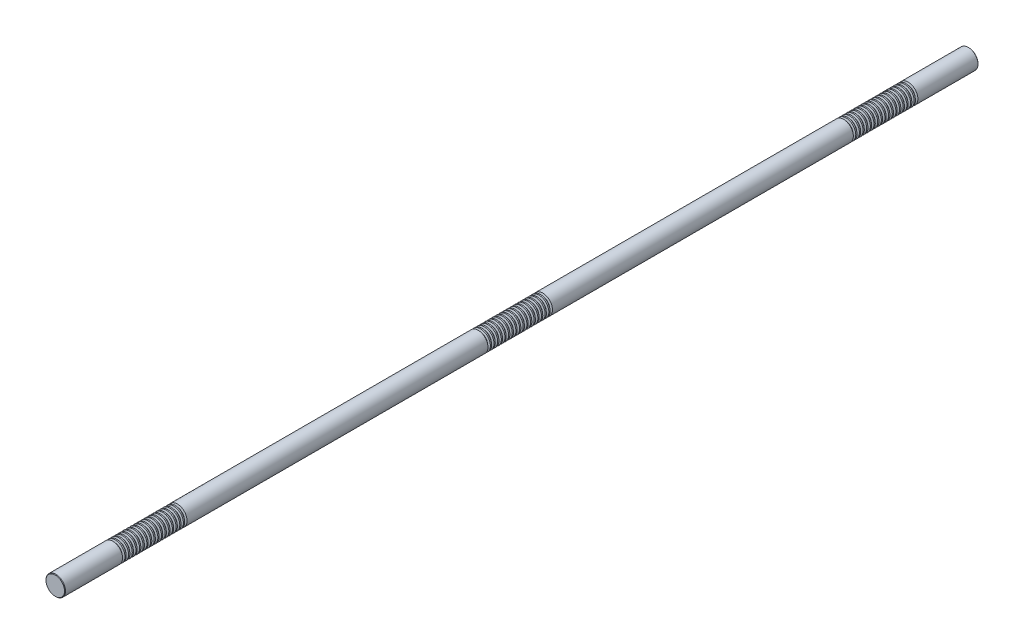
ISO-10303-21;
HEADER;
FILE_DESCRIPTION(('STEP AP214'),'2;1');
FILE_NAME('part.step','',(''),(''),'','','');
FILE_SCHEMA(('AUTOMOTIVE_DESIGN { 1 0 10303 214 1 1 1 1 }'));
ENDSEC;
DATA;
#1=APPLICATION_CONTEXT('core data for automotive mechanical design processes');
#2=APPLICATION_PROTOCOL_DEFINITION('international standard','automotive_design',2000,#1);
#3=PRODUCT_CONTEXT('',#1,'mechanical');
#4=PRODUCT('Part','Part','',(#3));
#5=PRODUCT_RELATED_PRODUCT_CATEGORY('part','',(#4));
#6=PRODUCT_DEFINITION_FORMATION('','',#4);
#7=PRODUCT_DEFINITION_CONTEXT('part definition',#1,'design');
#8=PRODUCT_DEFINITION('design','',#6,#7);
#9=PRODUCT_DEFINITION_SHAPE('','',#8);
#10=(LENGTH_UNIT() NAMED_UNIT(*) SI_UNIT(.MILLI.,.METRE.));
#11=(NAMED_UNIT(*) PLANE_ANGLE_UNIT() SI_UNIT($,.RADIAN.));
#12=(NAMED_UNIT(*) SI_UNIT($,.STERADIAN.) SOLID_ANGLE_UNIT());
#13=UNCERTAINTY_MEASURE_WITH_UNIT(LENGTH_MEASURE(1.E-05),#10,'distance_accuracy_value','');
#14=(GEOMETRIC_REPRESENTATION_CONTEXT(3) GLOBAL_UNCERTAINTY_ASSIGNED_CONTEXT((#13)) GLOBAL_UNIT_ASSIGNED_CONTEXT((#10,
#11,#12)) REPRESENTATION_CONTEXT('',''));
#15=CARTESIAN_POINT('',(0.,0.,0.));
#16=DIRECTION('',(0.,0.,1.));
#17=DIRECTION('',(1.,0.,0.));
#18=AXIS2_PLACEMENT_3D('',#15,#16,#17);
#19=CARTESIAN_POINT('',(0.,0.,750.));
#20=DIRECTION('',(0.,0.,-1.));
#21=DIRECTION('',(-1.,0.,0.));
#22=AXIS2_PLACEMENT_3D('',#19,#20,#21);
#23=CYLINDRICAL_SURFACE('',#22,16.);
#24=CARTESIAN_POINT('',(0.,0.,649.468911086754));
#25=DIRECTION('',(0.,0.,1.));
#26=DIRECTION('',(1.,0.,0.));
#27=AXIS2_PLACEMENT_3D('',#24,#25,#26);
#28=CIRCLE('',#27,16.);
#29=CARTESIAN_POINT('',(16.,0.,649.468911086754));
#30=VERTEX_POINT('',#29);
#31=EDGE_CURVE('E899',#30,#30,#28,.T.);
#32=ORIENTED_EDGE('',*,*,#31,.T.);
#33=EDGE_LOOP('',(#32));
#34=FACE_BOUND('',#33,.T.);
#35=CARTESIAN_POINT('',(0.,0.,651.531088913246));
#36=DIRECTION('',(0.,0.,1.));
#37=DIRECTION('',(1.,0.,0.));
#38=AXIS2_PLACEMENT_3D('',#35,#36,#37);
#39=CIRCLE('',#38,16.);
#40=CARTESIAN_POINT('',(16.,0.,651.531088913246));
#41=VERTEX_POINT('',#40);
#42=EDGE_CURVE('E909',#41,#41,#39,.T.);
#43=ORIENTED_EDGE('',*,*,#42,.F.);
#44=EDGE_LOOP('',(#43));
#45=FACE_BOUND('',#44,.T.);
#46=ADVANCED_FACE('F37',(#34,#45),#23,.T.);
#47=CARTESIAN_POINT('',(0.,0.,643.468911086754));
#48=DIRECTION('',(0.,0.,1.));
#49=DIRECTION('',(1.,0.,0.));
#50=AXIS2_PLACEMENT_3D('',#47,#48,#49);
#51=CIRCLE('',#50,16.);
#52=CARTESIAN_POINT('',(16.,0.,643.468911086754));
#53=VERTEX_POINT('',#52);
#54=EDGE_CURVE('E883',#53,#53,#51,.T.);
#55=ORIENTED_EDGE('',*,*,#54,.T.);
#56=EDGE_LOOP('',(#55));
#57=FACE_BOUND('',#56,.T.);
#58=CARTESIAN_POINT('',(0.,0.,645.531088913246));
#59=DIRECTION('',(0.,0.,1.));
#60=DIRECTION('',(1.,0.,0.));
#61=AXIS2_PLACEMENT_3D('',#58,#59,#60);
#62=CIRCLE('',#61,16.);
#63=CARTESIAN_POINT('',(16.,0.,645.531088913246));
#64=VERTEX_POINT('',#63);
#65=EDGE_CURVE('E895',#64,#64,#62,.T.);
#66=ORIENTED_EDGE('',*,*,#65,.F.);
#67=EDGE_LOOP('',(#66));
#68=FACE_BOUND('',#67,.T.);
#69=ADVANCED_FACE('F945',(#57,#68),#23,.T.);
#70=CARTESIAN_POINT('',(0.,0.,637.468911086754));
#71=DIRECTION('',(0.,0.,1.));
#72=DIRECTION('',(1.,0.,0.));
#73=AXIS2_PLACEMENT_3D('',#70,#71,#72);
#74=CIRCLE('',#73,16.);
#75=CARTESIAN_POINT('',(16.,0.,637.468911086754));
#76=VERTEX_POINT('',#75);
#77=EDGE_CURVE('E867',#76,#76,#74,.T.);
#78=ORIENTED_EDGE('',*,*,#77,.T.);
#79=EDGE_LOOP('',(#78));
#80=FACE_BOUND('',#79,.T.);
#81=CARTESIAN_POINT('',(0.,0.,639.531088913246));
#82=DIRECTION('',(0.,0.,1.));
#83=DIRECTION('',(1.,0.,0.));
#84=AXIS2_PLACEMENT_3D('',#81,#82,#83);
#85=CIRCLE('',#84,16.);
#86=CARTESIAN_POINT('',(16.,0.,639.531088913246));
#87=VERTEX_POINT('',#86);
#88=EDGE_CURVE('E879',#87,#87,#85,.T.);
#89=ORIENTED_EDGE('',*,*,#88,.F.);
#90=EDGE_LOOP('',(#89));
#91=FACE_BOUND('',#90,.T.);
#92=ADVANCED_FACE('F953',(#80,#91),#23,.T.);
#93=CARTESIAN_POINT('',(0.,0.,631.468911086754));
#94=DIRECTION('',(0.,0.,1.));
#95=DIRECTION('',(1.,0.,0.));
#96=AXIS2_PLACEMENT_3D('',#93,#94,#95);
#97=CIRCLE('',#96,16.);
#98=CARTESIAN_POINT('',(16.,0.,631.468911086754));
#99=VERTEX_POINT('',#98);
#100=EDGE_CURVE('E851',#99,#99,#97,.T.);
#101=ORIENTED_EDGE('',*,*,#100,.T.);
#102=EDGE_LOOP('',(#101));
#103=FACE_BOUND('',#102,.T.);
#104=CARTESIAN_POINT('',(0.,0.,633.531088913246));
#105=DIRECTION('',(0.,0.,1.));
#106=DIRECTION('',(1.,0.,0.));
#107=AXIS2_PLACEMENT_3D('',#104,#105,#106);
#108=CIRCLE('',#107,16.);
#109=CARTESIAN_POINT('',(16.,0.,633.531088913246));
#110=VERTEX_POINT('',#109);
#111=EDGE_CURVE('E863',#110,#110,#108,.T.);
#112=ORIENTED_EDGE('',*,*,#111,.F.);
#113=EDGE_LOOP('',(#112));
#114=FACE_BOUND('',#113,.T.);
#115=ADVANCED_FACE('F2098',(#103,#114),#23,.T.);
#116=CARTESIAN_POINT('',(0.,0.,625.468911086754));
#117=DIRECTION('',(0.,0.,1.));
#118=DIRECTION('',(1.,0.,0.));
#119=AXIS2_PLACEMENT_3D('',#116,#117,#118);
#120=CIRCLE('',#119,16.);
#121=CARTESIAN_POINT('',(16.,0.,625.468911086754));
#122=VERTEX_POINT('',#121);
#123=EDGE_CURVE('E835',#122,#122,#120,.T.);
#124=ORIENTED_EDGE('',*,*,#123,.T.);
#125=EDGE_LOOP('',(#124));
#126=FACE_BOUND('',#125,.T.);
#127=CARTESIAN_POINT('',(0.,0.,627.531088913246));
#128=DIRECTION('',(0.,0.,1.));
#129=DIRECTION('',(1.,0.,0.));
#130=AXIS2_PLACEMENT_3D('',#127,#128,#129);
#131=CIRCLE('',#130,16.);
#132=CARTESIAN_POINT('',(16.,0.,627.531088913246));
#133=VERTEX_POINT('',#132);
#134=EDGE_CURVE('E847',#133,#133,#131,.T.);
#135=ORIENTED_EDGE('',*,*,#134,.F.);
#136=EDGE_LOOP('',(#135));
#137=FACE_BOUND('',#136,.T.);
#138=ADVANCED_FACE('F2075',(#126,#137),#23,.T.);
#139=CARTESIAN_POINT('',(0.,0.,619.468911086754));
#140=DIRECTION('',(0.,0.,1.));
#141=DIRECTION('',(1.,0.,0.));
#142=AXIS2_PLACEMENT_3D('',#139,#140,#141);
#143=CIRCLE('',#142,16.);
#144=CARTESIAN_POINT('',(16.,0.,619.468911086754));
#145=VERTEX_POINT('',#144);
#146=EDGE_CURVE('E819',#145,#145,#143,.T.);
#147=ORIENTED_EDGE('',*,*,#146,.T.);
#148=EDGE_LOOP('',(#147));
#149=FACE_BOUND('',#148,.T.);
#150=CARTESIAN_POINT('',(0.,0.,621.531088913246));
#151=DIRECTION('',(0.,0.,1.));
#152=DIRECTION('',(1.,0.,0.));
#153=AXIS2_PLACEMENT_3D('',#150,#151,#152);
#154=CIRCLE('',#153,16.);
#155=CARTESIAN_POINT('',(16.,0.,621.531088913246));
#156=VERTEX_POINT('',#155);
#157=EDGE_CURVE('E831',#156,#156,#154,.T.);
#158=ORIENTED_EDGE('',*,*,#157,.F.);
#159=EDGE_LOOP('',(#158));
#160=FACE_BOUND('',#159,.T.);
#161=ADVANCED_FACE('F2052',(#149,#160),#23,.T.);
#162=CARTESIAN_POINT('',(0.,0.,613.468911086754));
#163=DIRECTION('',(0.,0.,1.));
#164=DIRECTION('',(1.,0.,0.));
#165=AXIS2_PLACEMENT_3D('',#162,#163,#164);
#166=CIRCLE('',#165,16.);
#167=CARTESIAN_POINT('',(16.,0.,613.468911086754));
#168=VERTEX_POINT('',#167);
#169=EDGE_CURVE('E803',#168,#168,#166,.T.);
#170=ORIENTED_EDGE('',*,*,#169,.T.);
#171=EDGE_LOOP('',(#170));
#172=FACE_BOUND('',#171,.T.);
#173=CARTESIAN_POINT('',(0.,0.,615.531088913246));
#174=DIRECTION('',(0.,0.,1.));
#175=DIRECTION('',(1.,0.,0.));
#176=AXIS2_PLACEMENT_3D('',#173,#174,#175);
#177=CIRCLE('',#176,16.);
#178=CARTESIAN_POINT('',(16.,0.,615.531088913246));
#179=VERTEX_POINT('',#178);
#180=EDGE_CURVE('E815',#179,#179,#177,.T.);
#181=ORIENTED_EDGE('',*,*,#180,.F.);
#182=EDGE_LOOP('',(#181));
#183=FACE_BOUND('',#182,.T.);
#184=ADVANCED_FACE('F2029',(#172,#183),#23,.T.);
#185=CARTESIAN_POINT('',(0.,0.,607.468911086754));
#186=DIRECTION('',(0.,0.,1.));
#187=DIRECTION('',(1.,0.,0.));
#188=AXIS2_PLACEMENT_3D('',#185,#186,#187);
#189=CIRCLE('',#188,16.);
#190=CARTESIAN_POINT('',(16.,0.,607.468911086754));
#191=VERTEX_POINT('',#190);
#192=EDGE_CURVE('E787',#191,#191,#189,.T.);
#193=ORIENTED_EDGE('',*,*,#192,.T.);
#194=EDGE_LOOP('',(#193));
#195=FACE_BOUND('',#194,.T.);
#196=CARTESIAN_POINT('',(0.,0.,609.531088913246));
#197=DIRECTION('',(0.,0.,1.));
#198=DIRECTION('',(1.,0.,0.));
#199=AXIS2_PLACEMENT_3D('',#196,#197,#198);
#200=CIRCLE('',#199,16.);
#201=CARTESIAN_POINT('',(16.,0.,609.531088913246));
#202=VERTEX_POINT('',#201);
#203=EDGE_CURVE('E799',#202,#202,#200,.T.);
#204=ORIENTED_EDGE('',*,*,#203,.F.);
#205=EDGE_LOOP('',(#204));
#206=FACE_BOUND('',#205,.T.);
#207=ADVANCED_FACE('F2006',(#195,#206),#23,.T.);
#208=CARTESIAN_POINT('',(0.,0.,601.468911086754));
#209=DIRECTION('',(0.,0.,1.));
#210=DIRECTION('',(1.,0.,0.));
#211=AXIS2_PLACEMENT_3D('',#208,#209,#210);
#212=CIRCLE('',#211,16.);
#213=CARTESIAN_POINT('',(16.,0.,601.468911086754));
#214=VERTEX_POINT('',#213);
#215=EDGE_CURVE('E771',#214,#214,#212,.T.);
#216=ORIENTED_EDGE('',*,*,#215,.T.);
#217=EDGE_LOOP('',(#216));
#218=FACE_BOUND('',#217,.T.);
#219=CARTESIAN_POINT('',(0.,0.,603.531088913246));
#220=DIRECTION('',(0.,0.,1.));
#221=DIRECTION('',(1.,0.,0.));
#222=AXIS2_PLACEMENT_3D('',#219,#220,#221);
#223=CIRCLE('',#222,16.);
#224=CARTESIAN_POINT('',(16.,0.,603.531088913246));
#225=VERTEX_POINT('',#224);
#226=EDGE_CURVE('E783',#225,#225,#223,.T.);
#227=ORIENTED_EDGE('',*,*,#226,.F.);
#228=EDGE_LOOP('',(#227));
#229=FACE_BOUND('',#228,.T.);
#230=ADVANCED_FACE('F1983',(#218,#229),#23,.T.);
#231=CARTESIAN_POINT('',(0.,0.,595.468911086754));
#232=DIRECTION('',(0.,0.,1.));
#233=DIRECTION('',(1.,0.,0.));
#234=AXIS2_PLACEMENT_3D('',#231,#232,#233);
#235=CIRCLE('',#234,16.);
#236=CARTESIAN_POINT('',(16.,0.,595.468911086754));
#237=VERTEX_POINT('',#236);
#238=EDGE_CURVE('E755',#237,#237,#235,.T.);
#239=ORIENTED_EDGE('',*,*,#238,.T.);
#240=EDGE_LOOP('',(#239));
#241=FACE_BOUND('',#240,.T.);
#242=CARTESIAN_POINT('',(0.,0.,597.531088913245));
#243=DIRECTION('',(0.,0.,1.));
#244=DIRECTION('',(1.,0.,0.));
#245=AXIS2_PLACEMENT_3D('',#242,#243,#244);
#246=CIRCLE('',#245,16.);
#247=CARTESIAN_POINT('',(16.,0.,597.531088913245));
#248=VERTEX_POINT('',#247);
#249=EDGE_CURVE('E767',#248,#248,#246,.T.);
#250=ORIENTED_EDGE('',*,*,#249,.F.);
#251=EDGE_LOOP('',(#250));
#252=FACE_BOUND('',#251,.T.);
#253=ADVANCED_FACE('F1960',(#241,#252),#23,.T.);
#254=CARTESIAN_POINT('',(0.,0.,589.468911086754));
#255=DIRECTION('',(0.,0.,1.));
#256=DIRECTION('',(1.,0.,0.));
#257=AXIS2_PLACEMENT_3D('',#254,#255,#256);
#258=CIRCLE('',#257,16.);
#259=CARTESIAN_POINT('',(16.,0.,589.468911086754));
#260=VERTEX_POINT('',#259);
#261=EDGE_CURVE('E739',#260,#260,#258,.T.);
#262=ORIENTED_EDGE('',*,*,#261,.T.);
#263=EDGE_LOOP('',(#262));
#264=FACE_BOUND('',#263,.T.);
#265=CARTESIAN_POINT('',(0.,0.,591.531088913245));
#266=DIRECTION('',(0.,0.,1.));
#267=DIRECTION('',(1.,0.,0.));
#268=AXIS2_PLACEMENT_3D('',#265,#266,#267);
#269=CIRCLE('',#268,16.);
#270=CARTESIAN_POINT('',(16.,0.,591.531088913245));
#271=VERTEX_POINT('',#270);
#272=EDGE_CURVE('E751',#271,#271,#269,.T.);
#273=ORIENTED_EDGE('',*,*,#272,.F.);
#274=EDGE_LOOP('',(#273));
#275=FACE_BOUND('',#274,.T.);
#276=ADVANCED_FACE('F1937',(#264,#275),#23,.T.);
#277=CARTESIAN_POINT('',(0.,0.,583.468911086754));
#278=DIRECTION('',(0.,0.,1.));
#279=DIRECTION('',(1.,0.,0.));
#280=AXIS2_PLACEMENT_3D('',#277,#278,#279);
#281=CIRCLE('',#280,16.);
#282=CARTESIAN_POINT('',(16.,0.,583.468911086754));
#283=VERTEX_POINT('',#282);
#284=EDGE_CURVE('E723',#283,#283,#281,.T.);
#285=ORIENTED_EDGE('',*,*,#284,.T.);
#286=EDGE_LOOP('',(#285));
#287=FACE_BOUND('',#286,.T.);
#288=CARTESIAN_POINT('',(0.,0.,585.531088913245));
#289=DIRECTION('',(0.,0.,1.));
#290=DIRECTION('',(1.,0.,0.));
#291=AXIS2_PLACEMENT_3D('',#288,#289,#290);
#292=CIRCLE('',#291,16.);
#293=CARTESIAN_POINT('',(16.,0.,585.531088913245));
#294=VERTEX_POINT('',#293);
#295=EDGE_CURVE('E735',#294,#294,#292,.T.);
#296=ORIENTED_EDGE('',*,*,#295,.F.);
#297=EDGE_LOOP('',(#296));
#298=FACE_BOUND('',#297,.T.);
#299=ADVANCED_FACE('F1914',(#287,#298),#23,.T.);
#300=CARTESIAN_POINT('',(0.,0.,577.468911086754));
#301=DIRECTION('',(0.,0.,1.));
#302=DIRECTION('',(1.,0.,0.));
#303=AXIS2_PLACEMENT_3D('',#300,#301,#302);
#304=CIRCLE('',#303,16.);
#305=CARTESIAN_POINT('',(16.,0.,577.468911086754));
#306=VERTEX_POINT('',#305);
#307=EDGE_CURVE('E707',#306,#306,#304,.T.);
#308=ORIENTED_EDGE('',*,*,#307,.T.);
#309=EDGE_LOOP('',(#308));
#310=FACE_BOUND('',#309,.T.);
#311=CARTESIAN_POINT('',(0.,0.,579.531088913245));
#312=DIRECTION('',(0.,0.,1.));
#313=DIRECTION('',(1.,0.,0.));
#314=AXIS2_PLACEMENT_3D('',#311,#312,#313);
#315=CIRCLE('',#314,16.);
#316=CARTESIAN_POINT('',(16.,0.,579.531088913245));
#317=VERTEX_POINT('',#316);
#318=EDGE_CURVE('E719',#317,#317,#315,.T.);
#319=ORIENTED_EDGE('',*,*,#318,.F.);
#320=EDGE_LOOP('',(#319));
#321=FACE_BOUND('',#320,.T.);
#322=ADVANCED_FACE('F1891',(#310,#321),#23,.T.);
#323=CARTESIAN_POINT('',(0.,0.,571.468911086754));
#324=DIRECTION('',(0.,0.,1.));
#325=DIRECTION('',(1.,0.,0.));
#326=AXIS2_PLACEMENT_3D('',#323,#324,#325);
#327=CIRCLE('',#326,16.);
#328=CARTESIAN_POINT('',(16.,0.,571.468911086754));
#329=VERTEX_POINT('',#328);
#330=EDGE_CURVE('E691',#329,#329,#327,.T.);
#331=ORIENTED_EDGE('',*,*,#330,.T.);
#332=EDGE_LOOP('',(#331));
#333=FACE_BOUND('',#332,.T.);
#334=CARTESIAN_POINT('',(0.,0.,573.531088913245));
#335=DIRECTION('',(0.,0.,1.));
#336=DIRECTION('',(1.,0.,0.));
#337=AXIS2_PLACEMENT_3D('',#334,#335,#336);
#338=CIRCLE('',#337,16.);
#339=CARTESIAN_POINT('',(16.,0.,573.531088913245));
#340=VERTEX_POINT('',#339);
#341=EDGE_CURVE('E703',#340,#340,#338,.T.);
#342=ORIENTED_EDGE('',*,*,#341,.F.);
#343=EDGE_LOOP('',(#342));
#344=FACE_BOUND('',#343,.T.);
#345=ADVANCED_FACE('F1868',(#333,#344),#23,.T.);
#346=CARTESIAN_POINT('',(0.,0.,565.468911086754));
#347=DIRECTION('',(0.,0.,1.));
#348=DIRECTION('',(1.,0.,0.));
#349=AXIS2_PLACEMENT_3D('',#346,#347,#348);
#350=CIRCLE('',#349,16.);
#351=CARTESIAN_POINT('',(16.,0.,565.468911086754));
#352=VERTEX_POINT('',#351);
#353=EDGE_CURVE('E675',#352,#352,#350,.T.);
#354=ORIENTED_EDGE('',*,*,#353,.T.);
#355=EDGE_LOOP('',(#354));
#356=FACE_BOUND('',#355,.T.);
#357=CARTESIAN_POINT('',(0.,0.,567.531088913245));
#358=DIRECTION('',(0.,0.,1.));
#359=DIRECTION('',(1.,0.,0.));
#360=AXIS2_PLACEMENT_3D('',#357,#358,#359);
#361=CIRCLE('',#360,16.);
#362=CARTESIAN_POINT('',(16.,0.,567.531088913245));
#363=VERTEX_POINT('',#362);
#364=EDGE_CURVE('E687',#363,#363,#361,.T.);
#365=ORIENTED_EDGE('',*,*,#364,.F.);
#366=EDGE_LOOP('',(#365));
#367=FACE_BOUND('',#366,.T.);
#368=ADVANCED_FACE('F1845',(#356,#367),#23,.T.);
#369=CARTESIAN_POINT('',(0.,0.,559.468911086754));
#370=DIRECTION('',(0.,0.,1.));
#371=DIRECTION('',(1.,0.,0.));
#372=AXIS2_PLACEMENT_3D('',#369,#370,#371);
#373=CIRCLE('',#372,16.);
#374=CARTESIAN_POINT('',(16.,0.,559.468911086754));
#375=VERTEX_POINT('',#374);
#376=EDGE_CURVE('E659',#375,#375,#373,.T.);
#377=ORIENTED_EDGE('',*,*,#376,.T.);
#378=EDGE_LOOP('',(#377));
#379=FACE_BOUND('',#378,.T.);
#380=CARTESIAN_POINT('',(0.,0.,561.531088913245));
#381=DIRECTION('',(0.,0.,1.));
#382=DIRECTION('',(1.,0.,0.));
#383=AXIS2_PLACEMENT_3D('',#380,#381,#382);
#384=CIRCLE('',#383,16.);
#385=CARTESIAN_POINT('',(16.,0.,561.531088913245));
#386=VERTEX_POINT('',#385);
#387=EDGE_CURVE('E671',#386,#386,#384,.T.);
#388=ORIENTED_EDGE('',*,*,#387,.F.);
#389=EDGE_LOOP('',(#388));
#390=FACE_BOUND('',#389,.T.);
#391=ADVANCED_FACE('F1826',(#379,#390),#23,.T.);
#392=CARTESIAN_POINT('',(0.,0.,553.468911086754));
#393=DIRECTION('',(0.,0.,1.));
#394=DIRECTION('',(1.,0.,0.));
#395=AXIS2_PLACEMENT_3D('',#392,#393,#394);
#396=CIRCLE('',#395,16.);
#397=CARTESIAN_POINT('',(16.,0.,553.468911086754));
#398=VERTEX_POINT('',#397);
#399=EDGE_CURVE('E371',#398,#398,#396,.T.);
#400=ORIENTED_EDGE('',*,*,#399,.T.);
#401=EDGE_LOOP('',(#400));
#402=FACE_BOUND('',#401,.T.);
#403=CARTESIAN_POINT('',(0.,0.,555.531088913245));
#404=DIRECTION('',(0.,0.,1.));
#405=DIRECTION('',(1.,0.,0.));
#406=AXIS2_PLACEMENT_3D('',#403,#404,#405);
#407=CIRCLE('',#406,16.);
#408=CARTESIAN_POINT('',(16.,0.,555.531088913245));
#409=VERTEX_POINT('',#408);
#410=EDGE_CURVE('E655',#409,#409,#407,.T.);
#411=ORIENTED_EDGE('',*,*,#410,.F.);
#412=EDGE_LOOP('',(#411));
#413=FACE_BOUND('',#412,.T.);
#414=ADVANCED_FACE('F1775',(#402,#413),#23,.T.);
#415=CARTESIAN_POINT('',(0.,0.,49.4689110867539));
#416=DIRECTION('',(0.,0.,1.));
#417=DIRECTION('',(1.,0.,0.));
#418=AXIS2_PLACEMENT_3D('',#415,#416,#417);
#419=CIRCLE('',#418,16.);
#420=CARTESIAN_POINT('',(16.,0.,49.4689110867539));
#421=VERTEX_POINT('',#420);
#422=EDGE_CURVE('E627',#421,#421,#419,.T.);
#423=ORIENTED_EDGE('',*,*,#422,.T.);
#424=EDGE_LOOP('',(#423));
#425=FACE_BOUND('',#424,.T.);
#426=CARTESIAN_POINT('',(0.,0.,51.5310889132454));
#427=DIRECTION('',(0.,0.,1.));
#428=DIRECTION('',(1.,0.,0.));
#429=AXIS2_PLACEMENT_3D('',#426,#427,#428);
#430=CIRCLE('',#429,16.);
#431=CARTESIAN_POINT('',(16.,0.,51.5310889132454));
#432=VERTEX_POINT('',#431);
#433=EDGE_CURVE('E639',#432,#432,#430,.T.);
#434=ORIENTED_EDGE('',*,*,#433,.F.);
#435=EDGE_LOOP('',(#434));
#436=FACE_BOUND('',#435,.T.);
#437=ADVANCED_FACE('F1751',(#425,#436),#23,.T.);
#438=CARTESIAN_POINT('',(0.,0.,43.4689110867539));
#439=DIRECTION('',(0.,0.,1.));
#440=DIRECTION('',(1.,0.,0.));
#441=AXIS2_PLACEMENT_3D('',#438,#439,#440);
#442=CIRCLE('',#441,16.);
#443=CARTESIAN_POINT('',(16.,0.,43.4689110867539));
#444=VERTEX_POINT('',#443);
#445=EDGE_CURVE('E611',#444,#444,#442,.T.);
#446=ORIENTED_EDGE('',*,*,#445,.T.);
#447=EDGE_LOOP('',(#446));
#448=FACE_BOUND('',#447,.T.);
#449=CARTESIAN_POINT('',(0.,0.,45.5310889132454));
#450=DIRECTION('',(0.,0.,1.));
#451=DIRECTION('',(1.,0.,0.));
#452=AXIS2_PLACEMENT_3D('',#449,#450,#451);
#453=CIRCLE('',#452,16.);
#454=CARTESIAN_POINT('',(16.,0.,45.5310889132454));
#455=VERTEX_POINT('',#454);
#456=EDGE_CURVE('E623',#455,#455,#453,.T.);
#457=ORIENTED_EDGE('',*,*,#456,.F.);
#458=EDGE_LOOP('',(#457));
#459=FACE_BOUND('',#458,.T.);
#460=ADVANCED_FACE('F1728',(#448,#459),#23,.T.);
#461=CARTESIAN_POINT('',(0.,0.,37.4689110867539));
#462=DIRECTION('',(0.,0.,1.));
#463=DIRECTION('',(1.,0.,0.));
#464=AXIS2_PLACEMENT_3D('',#461,#462,#463);
#465=CIRCLE('',#464,16.);
#466=CARTESIAN_POINT('',(16.,0.,37.4689110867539));
#467=VERTEX_POINT('',#466);
#468=EDGE_CURVE('E595',#467,#467,#465,.T.);
#469=ORIENTED_EDGE('',*,*,#468,.T.);
#470=EDGE_LOOP('',(#469));
#471=FACE_BOUND('',#470,.T.);
#472=CARTESIAN_POINT('',(0.,0.,39.5310889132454));
#473=DIRECTION('',(0.,0.,1.));
#474=DIRECTION('',(1.,0.,0.));
#475=AXIS2_PLACEMENT_3D('',#472,#473,#474);
#476=CIRCLE('',#475,16.);
#477=CARTESIAN_POINT('',(16.,0.,39.5310889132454));
#478=VERTEX_POINT('',#477);
#479=EDGE_CURVE('E607',#478,#478,#476,.T.);
#480=ORIENTED_EDGE('',*,*,#479,.F.);
#481=EDGE_LOOP('',(#480));
#482=FACE_BOUND('',#481,.T.);
#483=ADVANCED_FACE('F1705',(#471,#482),#23,.T.);
#484=CARTESIAN_POINT('',(0.,0.,31.4689110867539));
#485=DIRECTION('',(0.,0.,1.));
#486=DIRECTION('',(1.,0.,0.));
#487=AXIS2_PLACEMENT_3D('',#484,#485,#486);
#488=CIRCLE('',#487,16.);
#489=CARTESIAN_POINT('',(16.,0.,31.4689110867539));
#490=VERTEX_POINT('',#489);
#491=EDGE_CURVE('E579',#490,#490,#488,.T.);
#492=ORIENTED_EDGE('',*,*,#491,.T.);
#493=EDGE_LOOP('',(#492));
#494=FACE_BOUND('',#493,.T.);
#495=CARTESIAN_POINT('',(0.,0.,33.5310889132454));
#496=DIRECTION('',(0.,0.,1.));
#497=DIRECTION('',(1.,0.,0.));
#498=AXIS2_PLACEMENT_3D('',#495,#496,#497);
#499=CIRCLE('',#498,16.);
#500=CARTESIAN_POINT('',(16.,0.,33.5310889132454));
#501=VERTEX_POINT('',#500);
#502=EDGE_CURVE('E591',#501,#501,#499,.T.);
#503=ORIENTED_EDGE('',*,*,#502,.F.);
#504=EDGE_LOOP('',(#503));
#505=FACE_BOUND('',#504,.T.);
#506=ADVANCED_FACE('F1682',(#494,#505),#23,.T.);
#507=CARTESIAN_POINT('',(0.,0.,25.4689110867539));
#508=DIRECTION('',(0.,0.,1.));
#509=DIRECTION('',(1.,0.,0.));
#510=AXIS2_PLACEMENT_3D('',#507,#508,#509);
#511=CIRCLE('',#510,16.);
#512=CARTESIAN_POINT('',(16.,0.,25.4689110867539));
#513=VERTEX_POINT('',#512);
#514=EDGE_CURVE('E563',#513,#513,#511,.T.);
#515=ORIENTED_EDGE('',*,*,#514,.T.);
#516=EDGE_LOOP('',(#515));
#517=FACE_BOUND('',#516,.T.);
#518=CARTESIAN_POINT('',(0.,0.,27.5310889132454));
#519=DIRECTION('',(0.,0.,1.));
#520=DIRECTION('',(1.,0.,0.));
#521=AXIS2_PLACEMENT_3D('',#518,#519,#520);
#522=CIRCLE('',#521,16.);
#523=CARTESIAN_POINT('',(16.,0.,27.5310889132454));
#524=VERTEX_POINT('',#523);
#525=EDGE_CURVE('E575',#524,#524,#522,.T.);
#526=ORIENTED_EDGE('',*,*,#525,.F.);
#527=EDGE_LOOP('',(#526));
#528=FACE_BOUND('',#527,.T.);
#529=ADVANCED_FACE('F1659',(#517,#528),#23,.T.);
#530=CARTESIAN_POINT('',(0.,0.,19.4689110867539));
#531=DIRECTION('',(0.,0.,1.));
#532=DIRECTION('',(1.,0.,0.));
#533=AXIS2_PLACEMENT_3D('',#530,#531,#532);
#534=CIRCLE('',#533,16.);
#535=CARTESIAN_POINT('',(16.,0.,19.4689110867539));
#536=VERTEX_POINT('',#535);
#537=EDGE_CURVE('E547',#536,#536,#534,.T.);
#538=ORIENTED_EDGE('',*,*,#537,.T.);
#539=EDGE_LOOP('',(#538));
#540=FACE_BOUND('',#539,.T.);
#541=CARTESIAN_POINT('',(0.,0.,21.5310889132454));
#542=DIRECTION('',(0.,0.,1.));
#543=DIRECTION('',(1.,0.,0.));
#544=AXIS2_PLACEMENT_3D('',#541,#542,#543);
#545=CIRCLE('',#544,16.);
#546=CARTESIAN_POINT('',(16.,0.,21.5310889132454));
#547=VERTEX_POINT('',#546);
#548=EDGE_CURVE('E559',#547,#547,#545,.T.);
#549=ORIENTED_EDGE('',*,*,#548,.F.);
#550=EDGE_LOOP('',(#549));
#551=FACE_BOUND('',#550,.T.);
#552=ADVANCED_FACE('F1636',(#540,#551),#23,.T.);
#553=CARTESIAN_POINT('',(0.,0.,13.4689110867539));
#554=DIRECTION('',(0.,0.,1.));
#555=DIRECTION('',(1.,0.,0.));
#556=AXIS2_PLACEMENT_3D('',#553,#554,#555);
#557=CIRCLE('',#556,16.);
#558=CARTESIAN_POINT('',(16.,0.,13.4689110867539));
#559=VERTEX_POINT('',#558);
#560=EDGE_CURVE('E531',#559,#559,#557,.T.);
#561=ORIENTED_EDGE('',*,*,#560,.T.);
#562=EDGE_LOOP('',(#561));
#563=FACE_BOUND('',#562,.T.);
#564=CARTESIAN_POINT('',(0.,0.,15.5310889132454));
#565=DIRECTION('',(0.,0.,1.));
#566=DIRECTION('',(1.,0.,0.));
#567=AXIS2_PLACEMENT_3D('',#564,#565,#566);
#568=CIRCLE('',#567,16.);
#569=CARTESIAN_POINT('',(16.,0.,15.5310889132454));
#570=VERTEX_POINT('',#569);
#571=EDGE_CURVE('E543',#570,#570,#568,.T.);
#572=ORIENTED_EDGE('',*,*,#571,.F.);
#573=EDGE_LOOP('',(#572));
#574=FACE_BOUND('',#573,.T.);
#575=ADVANCED_FACE('F1613',(#563,#574),#23,.T.);
#576=CARTESIAN_POINT('',(0.,0.,7.46891108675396));
#577=DIRECTION('',(0.,0.,1.));
#578=DIRECTION('',(1.,0.,0.));
#579=AXIS2_PLACEMENT_3D('',#576,#577,#578);
#580=CIRCLE('',#579,16.);
#581=CARTESIAN_POINT('',(16.,0.,7.46891108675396));
#582=VERTEX_POINT('',#581);
#583=EDGE_CURVE('E515',#582,#582,#580,.T.);
#584=ORIENTED_EDGE('',*,*,#583,.T.);
#585=EDGE_LOOP('',(#584));
#586=FACE_BOUND('',#585,.T.);
#587=CARTESIAN_POINT('',(0.,0.,9.53108891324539));
#588=DIRECTION('',(0.,0.,1.));
#589=DIRECTION('',(1.,0.,0.));
#590=AXIS2_PLACEMENT_3D('',#587,#588,#589);
#591=CIRCLE('',#590,16.);
#592=CARTESIAN_POINT('',(16.,0.,9.53108891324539));
#593=VERTEX_POINT('',#592);
#594=EDGE_CURVE('E527',#593,#593,#591,.T.);
#595=ORIENTED_EDGE('',*,*,#594,.F.);
#596=EDGE_LOOP('',(#595));
#597=FACE_BOUND('',#596,.T.);
#598=ADVANCED_FACE('F1590',(#586,#597),#23,.T.);
#599=CARTESIAN_POINT('',(0.,0.,1.46891108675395));
#600=DIRECTION('',(0.,0.,1.));
#601=DIRECTION('',(1.,0.,0.));
#602=AXIS2_PLACEMENT_3D('',#599,#600,#601);
#603=CIRCLE('',#602,16.);
#604=CARTESIAN_POINT('',(16.,0.,1.46891108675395));
#605=VERTEX_POINT('',#604);
#606=EDGE_CURVE('E499',#605,#605,#603,.T.);
#607=ORIENTED_EDGE('',*,*,#606,.T.);
#608=EDGE_LOOP('',(#607));
#609=FACE_BOUND('',#608,.T.);
#610=CARTESIAN_POINT('',(0.,0.,3.53108891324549));
#611=DIRECTION('',(0.,0.,1.));
#612=DIRECTION('',(1.,0.,0.));
#613=AXIS2_PLACEMENT_3D('',#610,#611,#612);
#614=CIRCLE('',#613,16.);
#615=CARTESIAN_POINT('',(16.,0.,3.53108891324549));
#616=VERTEX_POINT('',#615);
#617=EDGE_CURVE('E511',#616,#616,#614,.T.);
#618=ORIENTED_EDGE('',*,*,#617,.F.);
#619=EDGE_LOOP('',(#618));
#620=FACE_BOUND('',#619,.T.);
#621=ADVANCED_FACE('F1567',(#609,#620),#23,.T.);
#622=CARTESIAN_POINT('',(0.,0.,-4.53108891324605));
#623=DIRECTION('',(0.,0.,1.));
#624=DIRECTION('',(1.,0.,0.));
#625=AXIS2_PLACEMENT_3D('',#622,#623,#624);
#626=CIRCLE('',#625,16.);
#627=CARTESIAN_POINT('',(16.,0.,-4.53108891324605));
#628=VERTEX_POINT('',#627);
#629=EDGE_CURVE('E483',#628,#628,#626,.T.);
#630=ORIENTED_EDGE('',*,*,#629,.T.);
#631=EDGE_LOOP('',(#630));
#632=FACE_BOUND('',#631,.T.);
#633=CARTESIAN_POINT('',(0.,0.,-2.46891108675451));
#634=DIRECTION('',(0.,0.,1.));
#635=DIRECTION('',(1.,0.,0.));
#636=AXIS2_PLACEMENT_3D('',#633,#634,#635);
#637=CIRCLE('',#636,16.);
#638=CARTESIAN_POINT('',(16.,0.,-2.46891108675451));
#639=VERTEX_POINT('',#638);
#640=EDGE_CURVE('E495',#639,#639,#637,.T.);
#641=ORIENTED_EDGE('',*,*,#640,.F.);
#642=EDGE_LOOP('',(#641));
#643=FACE_BOUND('',#642,.T.);
#644=ADVANCED_FACE('F1544',(#632,#643),#23,.T.);
#645=CARTESIAN_POINT('',(0.,0.,-10.5310889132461));
#646=DIRECTION('',(0.,0.,1.));
#647=DIRECTION('',(1.,0.,0.));
#648=AXIS2_PLACEMENT_3D('',#645,#646,#647);
#649=CIRCLE('',#648,16.);
#650=CARTESIAN_POINT('',(16.,0.,-10.5310889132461));
#651=VERTEX_POINT('',#650);
#652=EDGE_CURVE('E467',#651,#651,#649,.T.);
#653=ORIENTED_EDGE('',*,*,#652,.T.);
#654=EDGE_LOOP('',(#653));
#655=FACE_BOUND('',#654,.T.);
#656=CARTESIAN_POINT('',(0.,0.,-8.46891108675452));
#657=DIRECTION('',(0.,0.,1.));
#658=DIRECTION('',(1.,0.,0.));
#659=AXIS2_PLACEMENT_3D('',#656,#657,#658);
#660=CIRCLE('',#659,16.);
#661=CARTESIAN_POINT('',(16.,0.,-8.46891108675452));
#662=VERTEX_POINT('',#661);
#663=EDGE_CURVE('E479',#662,#662,#660,.T.);
#664=ORIENTED_EDGE('',*,*,#663,.F.);
#665=EDGE_LOOP('',(#664));
#666=FACE_BOUND('',#665,.T.);
#667=ADVANCED_FACE('F1521',(#655,#666),#23,.T.);
#668=CARTESIAN_POINT('',(0.,0.,-16.5310889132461));
#669=DIRECTION('',(0.,0.,1.));
#670=DIRECTION('',(1.,0.,0.));
#671=AXIS2_PLACEMENT_3D('',#668,#669,#670);
#672=CIRCLE('',#671,16.);
#673=CARTESIAN_POINT('',(16.,0.,-16.5310889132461));
#674=VERTEX_POINT('',#673);
#675=EDGE_CURVE('E451',#674,#674,#672,.T.);
#676=ORIENTED_EDGE('',*,*,#675,.T.);
#677=EDGE_LOOP('',(#676));
#678=FACE_BOUND('',#677,.T.);
#679=CARTESIAN_POINT('',(0.,0.,-14.4689110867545));
#680=DIRECTION('',(0.,0.,1.));
#681=DIRECTION('',(1.,0.,0.));
#682=AXIS2_PLACEMENT_3D('',#679,#680,#681);
#683=CIRCLE('',#682,16.);
#684=CARTESIAN_POINT('',(16.,0.,-14.4689110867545));
#685=VERTEX_POINT('',#684);
#686=EDGE_CURVE('E463',#685,#685,#683,.T.);
#687=ORIENTED_EDGE('',*,*,#686,.F.);
#688=EDGE_LOOP('',(#687));
#689=FACE_BOUND('',#688,.T.);
#690=ADVANCED_FACE('F1498',(#678,#689),#23,.T.);
#691=CARTESIAN_POINT('',(0.,0.,-22.5310889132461));
#692=DIRECTION('',(0.,0.,1.));
#693=DIRECTION('',(1.,0.,0.));
#694=AXIS2_PLACEMENT_3D('',#691,#692,#693);
#695=CIRCLE('',#694,16.);
#696=CARTESIAN_POINT('',(16.,0.,-22.5310889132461));
#697=VERTEX_POINT('',#696);
#698=EDGE_CURVE('E435',#697,#697,#695,.T.);
#699=ORIENTED_EDGE('',*,*,#698,.T.);
#700=EDGE_LOOP('',(#699));
#701=FACE_BOUND('',#700,.T.);
#702=CARTESIAN_POINT('',(0.,0.,-20.4689110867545));
#703=DIRECTION('',(0.,0.,1.));
#704=DIRECTION('',(1.,0.,0.));
#705=AXIS2_PLACEMENT_3D('',#702,#703,#704);
#706=CIRCLE('',#705,16.);
#707=CARTESIAN_POINT('',(16.,0.,-20.4689110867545));
#708=VERTEX_POINT('',#707);
#709=EDGE_CURVE('E447',#708,#708,#706,.T.);
#710=ORIENTED_EDGE('',*,*,#709,.F.);
#711=EDGE_LOOP('',(#710));
#712=FACE_BOUND('',#711,.T.);
#713=ADVANCED_FACE('F1475',(#701,#712),#23,.T.);
#714=CARTESIAN_POINT('',(0.,0.,-28.5310889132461));
#715=DIRECTION('',(0.,0.,1.));
#716=DIRECTION('',(1.,0.,0.));
#717=AXIS2_PLACEMENT_3D('',#714,#715,#716);
#718=CIRCLE('',#717,16.);
#719=CARTESIAN_POINT('',(16.,0.,-28.5310889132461));
#720=VERTEX_POINT('',#719);
#721=EDGE_CURVE('E419',#720,#720,#718,.T.);
#722=ORIENTED_EDGE('',*,*,#721,.T.);
#723=EDGE_LOOP('',(#722));
#724=FACE_BOUND('',#723,.T.);
#725=CARTESIAN_POINT('',(0.,0.,-26.4689110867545));
#726=DIRECTION('',(0.,0.,1.));
#727=DIRECTION('',(1.,0.,0.));
#728=AXIS2_PLACEMENT_3D('',#725,#726,#727);
#729=CIRCLE('',#728,16.);
#730=CARTESIAN_POINT('',(16.,0.,-26.4689110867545));
#731=VERTEX_POINT('',#730);
#732=EDGE_CURVE('E431',#731,#731,#729,.T.);
#733=ORIENTED_EDGE('',*,*,#732,.F.);
#734=EDGE_LOOP('',(#733));
#735=FACE_BOUND('',#734,.T.);
#736=ADVANCED_FACE('F1452',(#724,#735),#23,.T.);
#737=CARTESIAN_POINT('',(0.,0.,-34.5310889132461));
#738=DIRECTION('',(0.,0.,1.));
#739=DIRECTION('',(1.,0.,0.));
#740=AXIS2_PLACEMENT_3D('',#737,#738,#739);
#741=CIRCLE('',#740,16.);
#742=CARTESIAN_POINT('',(16.,0.,-34.5310889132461));
#743=VERTEX_POINT('',#742);
#744=EDGE_CURVE('E403',#743,#743,#741,.T.);
#745=ORIENTED_EDGE('',*,*,#744,.T.);
#746=EDGE_LOOP('',(#745));
#747=FACE_BOUND('',#746,.T.);
#748=CARTESIAN_POINT('',(0.,0.,-32.4689110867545));
#749=DIRECTION('',(0.,0.,1.));
#750=DIRECTION('',(1.,0.,0.));
#751=AXIS2_PLACEMENT_3D('',#748,#749,#750);
#752=CIRCLE('',#751,16.);
#753=CARTESIAN_POINT('',(16.,0.,-32.4689110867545));
#754=VERTEX_POINT('',#753);
#755=EDGE_CURVE('E415',#754,#754,#752,.T.);
#756=ORIENTED_EDGE('',*,*,#755,.F.);
#757=EDGE_LOOP('',(#756));
#758=FACE_BOUND('',#757,.T.);
#759=ADVANCED_FACE('F1429',(#747,#758),#23,.T.);
#760=CARTESIAN_POINT('',(0.,0.,-40.5310889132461));
#761=DIRECTION('',(0.,0.,1.));
#762=DIRECTION('',(1.,0.,0.));
#763=AXIS2_PLACEMENT_3D('',#760,#761,#762);
#764=CIRCLE('',#763,16.);
#765=CARTESIAN_POINT('',(16.,0.,-40.5310889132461));
#766=VERTEX_POINT('',#765);
#767=EDGE_CURVE('E387',#766,#766,#764,.T.);
#768=ORIENTED_EDGE('',*,*,#767,.T.);
#769=EDGE_LOOP('',(#768));
#770=FACE_BOUND('',#769,.T.);
#771=CARTESIAN_POINT('',(0.,0.,-38.4689110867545));
#772=DIRECTION('',(0.,0.,1.));
#773=DIRECTION('',(1.,0.,0.));
#774=AXIS2_PLACEMENT_3D('',#771,#772,#773);
#775=CIRCLE('',#774,16.);
#776=CARTESIAN_POINT('',(16.,0.,-38.4689110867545));
#777=VERTEX_POINT('',#776);
#778=EDGE_CURVE('E399',#777,#777,#775,.T.);
#779=ORIENTED_EDGE('',*,*,#778,.F.);
#780=EDGE_LOOP('',(#779));
#781=FACE_BOUND('',#780,.T.);
#782=ADVANCED_FACE('F1406',(#770,#781),#23,.T.);
#783=CARTESIAN_POINT('',(0.,0.,-46.5310889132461));
#784=DIRECTION('',(0.,0.,1.));
#785=DIRECTION('',(1.,0.,0.));
#786=AXIS2_PLACEMENT_3D('',#783,#784,#785);
#787=CIRCLE('',#786,16.);
#788=CARTESIAN_POINT('',(16.,0.,-46.5310889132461));
#789=VERTEX_POINT('',#788);
#790=EDGE_CURVE('E355',#789,#789,#787,.T.);
#791=ORIENTED_EDGE('',*,*,#790,.T.);
#792=EDGE_LOOP('',(#791));
#793=FACE_BOUND('',#792,.T.);
#794=CARTESIAN_POINT('',(0.,0.,-44.4689110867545));
#795=DIRECTION('',(0.,0.,1.));
#796=DIRECTION('',(1.,0.,0.));
#797=AXIS2_PLACEMENT_3D('',#794,#795,#796);
#798=CIRCLE('',#797,16.);
#799=CARTESIAN_POINT('',(16.,0.,-44.4689110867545));
#800=VERTEX_POINT('',#799);
#801=EDGE_CURVE('E383',#800,#800,#798,.T.);
#802=ORIENTED_EDGE('',*,*,#801,.F.);
#803=EDGE_LOOP('',(#802));
#804=FACE_BOUND('',#803,.T.);
#805=ADVANCED_FACE('F1383',(#793,#804),#23,.T.);
#806=CARTESIAN_POINT('',(0.,0.,-544.531088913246));
#807=DIRECTION('',(0.,0.,1.));
#808=DIRECTION('',(1.,0.,0.));
#809=AXIS2_PLACEMENT_3D('',#806,#807,#808);
#810=CIRCLE('',#809,16.);
#811=CARTESIAN_POINT('',(16.,0.,-544.531088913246));
#812=VERTEX_POINT('',#811);
#813=EDGE_CURVE('E339',#812,#812,#810,.T.);
#814=ORIENTED_EDGE('',*,*,#813,.T.);
#815=EDGE_LOOP('',(#814));
#816=FACE_BOUND('',#815,.T.);
#817=CARTESIAN_POINT('',(0.,0.,-50.4689110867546));
#818=DIRECTION('',(0.,0.,1.));
#819=DIRECTION('',(1.,0.,0.));
#820=AXIS2_PLACEMENT_3D('',#817,#818,#819);
#821=CIRCLE('',#820,16.);
#822=CARTESIAN_POINT('',(16.,0.,-50.4689110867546));
#823=VERTEX_POINT('',#822);
#824=EDGE_CURVE('E351',#823,#823,#821,.T.);
#825=ORIENTED_EDGE('',*,*,#824,.F.);
#826=EDGE_LOOP('',(#825));
#827=FACE_BOUND('',#826,.T.);
#828=ADVANCED_FACE('F1360',(#816,#827),#23,.T.);
#829=CARTESIAN_POINT('',(0.,0.,-550.531088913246));
#830=DIRECTION('',(0.,0.,1.));
#831=DIRECTION('',(1.,0.,0.));
#832=AXIS2_PLACEMENT_3D('',#829,#830,#831);
#833=CIRCLE('',#832,16.);
#834=CARTESIAN_POINT('',(16.,0.,-550.531088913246));
#835=VERTEX_POINT('',#834);
#836=EDGE_CURVE('E323',#835,#835,#833,.T.);
#837=ORIENTED_EDGE('',*,*,#836,.T.);
#838=EDGE_LOOP('',(#837));
#839=FACE_BOUND('',#838,.T.);
#840=CARTESIAN_POINT('',(0.,0.,-548.468911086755));
#841=DIRECTION('',(0.,0.,1.));
#842=DIRECTION('',(1.,0.,0.));
#843=AXIS2_PLACEMENT_3D('',#840,#841,#842);
#844=CIRCLE('',#843,16.);
#845=CARTESIAN_POINT('',(16.,0.,-548.468911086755));
#846=VERTEX_POINT('',#845);
#847=EDGE_CURVE('E335',#846,#846,#844,.T.);
#848=ORIENTED_EDGE('',*,*,#847,.F.);
#849=EDGE_LOOP('',(#848));
#850=FACE_BOUND('',#849,.T.);
#851=ADVANCED_FACE('F1337',(#839,#850),#23,.T.);
#852=CARTESIAN_POINT('',(0.,0.,-556.531088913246));
#853=DIRECTION('',(0.,0.,1.));
#854=DIRECTION('',(1.,0.,0.));
#855=AXIS2_PLACEMENT_3D('',#852,#853,#854);
#856=CIRCLE('',#855,16.);
#857=CARTESIAN_POINT('',(16.,0.,-556.531088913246));
#858=VERTEX_POINT('',#857);
#859=EDGE_CURVE('E307',#858,#858,#856,.T.);
#860=ORIENTED_EDGE('',*,*,#859,.T.);
#861=EDGE_LOOP('',(#860));
#862=FACE_BOUND('',#861,.T.);
#863=CARTESIAN_POINT('',(0.,0.,-554.468911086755));
#864=DIRECTION('',(0.,0.,1.));
#865=DIRECTION('',(1.,0.,0.));
#866=AXIS2_PLACEMENT_3D('',#863,#864,#865);
#867=CIRCLE('',#866,16.);
#868=CARTESIAN_POINT('',(16.,0.,-554.468911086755));
#869=VERTEX_POINT('',#868);
#870=EDGE_CURVE('E319',#869,#869,#867,.T.);
#871=ORIENTED_EDGE('',*,*,#870,.F.);
#872=EDGE_LOOP('',(#871));
#873=FACE_BOUND('',#872,.T.);
#874=ADVANCED_FACE('F1314',(#862,#873),#23,.T.);
#875=CARTESIAN_POINT('',(0.,0.,-562.531088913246));
#876=DIRECTION('',(0.,0.,1.));
#877=DIRECTION('',(1.,0.,0.));
#878=AXIS2_PLACEMENT_3D('',#875,#876,#877);
#879=CIRCLE('',#878,16.);
#880=CARTESIAN_POINT('',(16.,0.,-562.531088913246));
#881=VERTEX_POINT('',#880);
#882=EDGE_CURVE('E291',#881,#881,#879,.T.);
#883=ORIENTED_EDGE('',*,*,#882,.T.);
#884=EDGE_LOOP('',(#883));
#885=FACE_BOUND('',#884,.T.);
#886=CARTESIAN_POINT('',(0.,0.,-560.468911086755));
#887=DIRECTION('',(0.,0.,1.));
#888=DIRECTION('',(1.,0.,0.));
#889=AXIS2_PLACEMENT_3D('',#886,#887,#888);
#890=CIRCLE('',#889,16.);
#891=CARTESIAN_POINT('',(16.,0.,-560.468911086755));
#892=VERTEX_POINT('',#891);
#893=EDGE_CURVE('E303',#892,#892,#890,.T.);
#894=ORIENTED_EDGE('',*,*,#893,.F.);
#895=EDGE_LOOP('',(#894));
#896=FACE_BOUND('',#895,.T.);
#897=ADVANCED_FACE('F1291',(#885,#896),#23,.T.);
#898=CARTESIAN_POINT('',(0.,0.,-568.531088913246));
#899=DIRECTION('',(0.,0.,1.));
#900=DIRECTION('',(1.,0.,0.));
#901=AXIS2_PLACEMENT_3D('',#898,#899,#900);
#902=CIRCLE('',#901,16.);
#903=CARTESIAN_POINT('',(16.,0.,-568.531088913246));
#904=VERTEX_POINT('',#903);
#905=EDGE_CURVE('E275',#904,#904,#902,.T.);
#906=ORIENTED_EDGE('',*,*,#905,.T.);
#907=EDGE_LOOP('',(#906));
#908=FACE_BOUND('',#907,.T.);
#909=CARTESIAN_POINT('',(0.,0.,-566.468911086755));
#910=DIRECTION('',(0.,0.,1.));
#911=DIRECTION('',(1.,0.,0.));
#912=AXIS2_PLACEMENT_3D('',#909,#910,#911);
#913=CIRCLE('',#912,16.);
#914=CARTESIAN_POINT('',(16.,0.,-566.468911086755));
#915=VERTEX_POINT('',#914);
#916=EDGE_CURVE('E287',#915,#915,#913,.T.);
#917=ORIENTED_EDGE('',*,*,#916,.F.);
#918=EDGE_LOOP('',(#917));
#919=FACE_BOUND('',#918,.T.);
#920=ADVANCED_FACE('F1268',(#908,#919),#23,.T.);
#921=CARTESIAN_POINT('',(0.,0.,-574.531088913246));
#922=DIRECTION('',(0.,0.,1.));
#923=DIRECTION('',(1.,0.,0.));
#924=AXIS2_PLACEMENT_3D('',#921,#922,#923);
#925=CIRCLE('',#924,16.);
#926=CARTESIAN_POINT('',(16.,0.,-574.531088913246));
#927=VERTEX_POINT('',#926);
#928=EDGE_CURVE('E259',#927,#927,#925,.T.);
#929=ORIENTED_EDGE('',*,*,#928,.T.);
#930=EDGE_LOOP('',(#929));
#931=FACE_BOUND('',#930,.T.);
#932=CARTESIAN_POINT('',(0.,0.,-572.468911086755));
#933=DIRECTION('',(0.,0.,1.));
#934=DIRECTION('',(1.,0.,0.));
#935=AXIS2_PLACEMENT_3D('',#932,#933,#934);
#936=CIRCLE('',#935,16.);
#937=CARTESIAN_POINT('',(16.,0.,-572.468911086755));
#938=VERTEX_POINT('',#937);
#939=EDGE_CURVE('E271',#938,#938,#936,.T.);
#940=ORIENTED_EDGE('',*,*,#939,.F.);
#941=EDGE_LOOP('',(#940));
#942=FACE_BOUND('',#941,.T.);
#943=ADVANCED_FACE('F1245',(#931,#942),#23,.T.);
#944=CARTESIAN_POINT('',(0.,0.,-580.531088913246));
#945=DIRECTION('',(0.,0.,1.));
#946=DIRECTION('',(1.,0.,0.));
#947=AXIS2_PLACEMENT_3D('',#944,#945,#946);
#948=CIRCLE('',#947,16.);
#949=CARTESIAN_POINT('',(16.,0.,-580.531088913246));
#950=VERTEX_POINT('',#949);
#951=EDGE_CURVE('E243',#950,#950,#948,.T.);
#952=ORIENTED_EDGE('',*,*,#951,.T.);
#953=EDGE_LOOP('',(#952));
#954=FACE_BOUND('',#953,.T.);
#955=CARTESIAN_POINT('',(0.,0.,-578.468911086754));
#956=DIRECTION('',(0.,0.,1.));
#957=DIRECTION('',(1.,0.,0.));
#958=AXIS2_PLACEMENT_3D('',#955,#956,#957);
#959=CIRCLE('',#958,16.);
#960=CARTESIAN_POINT('',(16.,0.,-578.468911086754));
#961=VERTEX_POINT('',#960);
#962=EDGE_CURVE('E255',#961,#961,#959,.T.);
#963=ORIENTED_EDGE('',*,*,#962,.F.);
#964=EDGE_LOOP('',(#963));
#965=FACE_BOUND('',#964,.T.);
#966=ADVANCED_FACE('F1222',(#954,#965),#23,.T.);
#967=CARTESIAN_POINT('',(0.,0.,-586.531088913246));
#968=DIRECTION('',(0.,0.,1.));
#969=DIRECTION('',(1.,0.,0.));
#970=AXIS2_PLACEMENT_3D('',#967,#968,#969);
#971=CIRCLE('',#970,16.);
#972=CARTESIAN_POINT('',(16.,0.,-586.531088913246));
#973=VERTEX_POINT('',#972);
#974=EDGE_CURVE('E227',#973,#973,#971,.T.);
#975=ORIENTED_EDGE('',*,*,#974,.T.);
#976=EDGE_LOOP('',(#975));
#977=FACE_BOUND('',#976,.T.);
#978=CARTESIAN_POINT('',(0.,0.,-584.468911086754));
#979=DIRECTION('',(0.,0.,1.));
#980=DIRECTION('',(1.,0.,0.));
#981=AXIS2_PLACEMENT_3D('',#978,#979,#980);
#982=CIRCLE('',#981,16.);
#983=CARTESIAN_POINT('',(16.,0.,-584.468911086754));
#984=VERTEX_POINT('',#983);
#985=EDGE_CURVE('E239',#984,#984,#982,.T.);
#986=ORIENTED_EDGE('',*,*,#985,.F.);
#987=EDGE_LOOP('',(#986));
#988=FACE_BOUND('',#987,.T.);
#989=ADVANCED_FACE('F1199',(#977,#988),#23,.T.);
#990=CARTESIAN_POINT('',(0.,0.,-592.531088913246));
#991=DIRECTION('',(0.,0.,1.));
#992=DIRECTION('',(1.,0.,0.));
#993=AXIS2_PLACEMENT_3D('',#990,#991,#992);
#994=CIRCLE('',#993,16.);
#995=CARTESIAN_POINT('',(16.,0.,-592.531088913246));
#996=VERTEX_POINT('',#995);
#997=EDGE_CURVE('E211',#996,#996,#994,.T.);
#998=ORIENTED_EDGE('',*,*,#997,.T.);
#999=EDGE_LOOP('',(#998));
#1000=FACE_BOUND('',#999,.T.);
#1001=CARTESIAN_POINT('',(0.,0.,-590.468911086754));
#1002=DIRECTION('',(0.,0.,1.));
#1003=DIRECTION('',(1.,0.,0.));
#1004=AXIS2_PLACEMENT_3D('',#1001,#1002,#1003);
#1005=CIRCLE('',#1004,16.);
#1006=CARTESIAN_POINT('',(16.,0.,-590.468911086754));
#1007=VERTEX_POINT('',#1006);
#1008=EDGE_CURVE('E223',#1007,#1007,#1005,.T.);
#1009=ORIENTED_EDGE('',*,*,#1008,.F.);
#1010=EDGE_LOOP('',(#1009));
#1011=FACE_BOUND('',#1010,.T.);
#1012=ADVANCED_FACE('F1176',(#1000,#1011),#23,.T.);
#1013=CARTESIAN_POINT('',(0.,0.,-598.531088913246));
#1014=DIRECTION('',(0.,0.,1.));
#1015=DIRECTION('',(1.,0.,0.));
#1016=AXIS2_PLACEMENT_3D('',#1013,#1014,#1015);
#1017=CIRCLE('',#1016,16.);
#1018=CARTESIAN_POINT('',(16.,0.,-598.531088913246));
#1019=VERTEX_POINT('',#1018);
#1020=EDGE_CURVE('E195',#1019,#1019,#1017,.T.);
#1021=ORIENTED_EDGE('',*,*,#1020,.T.);
#1022=EDGE_LOOP('',(#1021));
#1023=FACE_BOUND('',#1022,.T.);
#1024=CARTESIAN_POINT('',(0.,0.,-596.468911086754));
#1025=DIRECTION('',(0.,0.,1.));
#1026=DIRECTION('',(1.,0.,0.));
#1027=AXIS2_PLACEMENT_3D('',#1024,#1025,#1026);
#1028=CIRCLE('',#1027,16.);
#1029=CARTESIAN_POINT('',(16.,0.,-596.468911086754));
#1030=VERTEX_POINT('',#1029);
#1031=EDGE_CURVE('E207',#1030,#1030,#1028,.T.);
#1032=ORIENTED_EDGE('',*,*,#1031,.F.);
#1033=EDGE_LOOP('',(#1032));
#1034=FACE_BOUND('',#1033,.T.);
#1035=ADVANCED_FACE('F1153',(#1023,#1034),#23,.T.);
#1036=CARTESIAN_POINT('',(0.,0.,-604.531088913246));
#1037=DIRECTION('',(0.,0.,1.));
#1038=DIRECTION('',(1.,0.,0.));
#1039=AXIS2_PLACEMENT_3D('',#1036,#1037,#1038);
#1040=CIRCLE('',#1039,16.);
#1041=CARTESIAN_POINT('',(16.,0.,-604.531088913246));
#1042=VERTEX_POINT('',#1041);
#1043=EDGE_CURVE('E179',#1042,#1042,#1040,.T.);
#1044=ORIENTED_EDGE('',*,*,#1043,.T.);
#1045=EDGE_LOOP('',(#1044));
#1046=FACE_BOUND('',#1045,.T.);
#1047=CARTESIAN_POINT('',(0.,0.,-602.468911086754));
#1048=DIRECTION('',(0.,0.,1.));
#1049=DIRECTION('',(1.,0.,0.));
#1050=AXIS2_PLACEMENT_3D('',#1047,#1048,#1049);
#1051=CIRCLE('',#1050,16.);
#1052=CARTESIAN_POINT('',(16.,0.,-602.468911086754));
#1053=VERTEX_POINT('',#1052);
#1054=EDGE_CURVE('E191',#1053,#1053,#1051,.T.);
#1055=ORIENTED_EDGE('',*,*,#1054,.F.);
#1056=EDGE_LOOP('',(#1055));
#1057=FACE_BOUND('',#1056,.T.);
#1058=ADVANCED_FACE('F1130',(#1046,#1057),#23,.T.);
#1059=CARTESIAN_POINT('',(0.,0.,-610.531088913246));
#1060=DIRECTION('',(0.,0.,1.));
#1061=DIRECTION('',(1.,0.,0.));
#1062=AXIS2_PLACEMENT_3D('',#1059,#1060,#1061);
#1063=CIRCLE('',#1062,16.);
#1064=CARTESIAN_POINT('',(16.,0.,-610.531088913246));
#1065=VERTEX_POINT('',#1064);
#1066=EDGE_CURVE('E163',#1065,#1065,#1063,.T.);
#1067=ORIENTED_EDGE('',*,*,#1066,.T.);
#1068=EDGE_LOOP('',(#1067));
#1069=FACE_BOUND('',#1068,.T.);
#1070=CARTESIAN_POINT('',(0.,0.,-608.468911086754));
#1071=DIRECTION('',(0.,0.,1.));
#1072=DIRECTION('',(1.,0.,0.));
#1073=AXIS2_PLACEMENT_3D('',#1070,#1071,#1072);
#1074=CIRCLE('',#1073,16.);
#1075=CARTESIAN_POINT('',(16.,0.,-608.468911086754));
#1076=VERTEX_POINT('',#1075);
#1077=EDGE_CURVE('E175',#1076,#1076,#1074,.T.);
#1078=ORIENTED_EDGE('',*,*,#1077,.F.);
#1079=EDGE_LOOP('',(#1078));
#1080=FACE_BOUND('',#1079,.T.);
#1081=ADVANCED_FACE('F1107',(#1069,#1080),#23,.T.);
#1082=CARTESIAN_POINT('',(0.,0.,-616.531088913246));
#1083=DIRECTION('',(0.,0.,1.));
#1084=DIRECTION('',(1.,0.,0.));
#1085=AXIS2_PLACEMENT_3D('',#1082,#1083,#1084);
#1086=CIRCLE('',#1085,16.);
#1087=CARTESIAN_POINT('',(16.,0.,-616.531088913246));
#1088=VERTEX_POINT('',#1087);
#1089=EDGE_CURVE('E148',#1088,#1088,#1086,.T.);
#1090=ORIENTED_EDGE('',*,*,#1089,.T.);
#1091=EDGE_LOOP('',(#1090));
#1092=FACE_BOUND('',#1091,.T.);
#1093=CARTESIAN_POINT('',(0.,0.,-614.468911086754));
#1094=DIRECTION('',(0.,0.,1.));
#1095=DIRECTION('',(1.,0.,0.));
#1096=AXIS2_PLACEMENT_3D('',#1093,#1094,#1095);
#1097=CIRCLE('',#1096,16.);
#1098=CARTESIAN_POINT('',(16.,0.,-614.468911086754));
#1099=VERTEX_POINT('',#1098);
#1100=EDGE_CURVE('E159',#1099,#1099,#1097,.T.);
#1101=ORIENTED_EDGE('',*,*,#1100,.F.);
#1102=EDGE_LOOP('',(#1101));
#1103=FACE_BOUND('',#1102,.T.);
#1104=ADVANCED_FACE('F1084',(#1092,#1103),#23,.T.);
#1105=CARTESIAN_POINT('',(0.,0.,-622.531088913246));
#1106=DIRECTION('',(0.,0.,1.));
#1107=DIRECTION('',(1.,0.,0.));
#1108=AXIS2_PLACEMENT_3D('',#1105,#1106,#1107);
#1109=CIRCLE('',#1108,16.);
#1110=CARTESIAN_POINT('',(16.,0.,-622.531088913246));
#1111=VERTEX_POINT('',#1110);
#1112=EDGE_CURVE('E132',#1111,#1111,#1109,.T.);
#1113=ORIENTED_EDGE('',*,*,#1112,.T.);
#1114=EDGE_LOOP('',(#1113));
#1115=FACE_BOUND('',#1114,.T.);
#1116=CARTESIAN_POINT('',(0.,0.,-620.468911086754));
#1117=DIRECTION('',(0.,0.,1.));
#1118=DIRECTION('',(1.,0.,0.));
#1119=AXIS2_PLACEMENT_3D('',#1116,#1117,#1118);
#1120=CIRCLE('',#1119,16.);
#1121=CARTESIAN_POINT('',(16.,0.,-620.468911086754));
#1122=VERTEX_POINT('',#1121);
#1123=EDGE_CURVE('E144',#1122,#1122,#1120,.T.);
#1124=ORIENTED_EDGE('',*,*,#1123,.F.);
#1125=EDGE_LOOP('',(#1124));
#1126=FACE_BOUND('',#1125,.T.);
#1127=ADVANCED_FACE('F1061',(#1115,#1126),#23,.T.);
#1128=CARTESIAN_POINT('',(0.,0.,-628.531088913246));
#1129=DIRECTION('',(0.,0.,1.));
#1130=DIRECTION('',(1.,0.,0.));
#1131=AXIS2_PLACEMENT_3D('',#1128,#1129,#1130);
#1132=CIRCLE('',#1131,16.);
#1133=CARTESIAN_POINT('',(16.,0.,-628.531088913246));
#1134=VERTEX_POINT('',#1133);
#1135=EDGE_CURVE('E116',#1134,#1134,#1132,.T.);
#1136=ORIENTED_EDGE('',*,*,#1135,.T.);
#1137=EDGE_LOOP('',(#1136));
#1138=FACE_BOUND('',#1137,.T.);
#1139=CARTESIAN_POINT('',(0.,0.,-626.468911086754));
#1140=DIRECTION('',(0.,0.,1.));
#1141=DIRECTION('',(1.,0.,0.));
#1142=AXIS2_PLACEMENT_3D('',#1139,#1140,#1141);
#1143=CIRCLE('',#1142,16.);
#1144=CARTESIAN_POINT('',(16.,0.,-626.468911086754));
#1145=VERTEX_POINT('',#1144);
#1146=EDGE_CURVE('E128',#1145,#1145,#1143,.T.);
#1147=ORIENTED_EDGE('',*,*,#1146,.F.);
#1148=EDGE_LOOP('',(#1147));
#1149=FACE_BOUND('',#1148,.T.);
#1150=ADVANCED_FACE('F1038',(#1138,#1149),#23,.T.);
#1151=CARTESIAN_POINT('',(0.,0.,-634.531088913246));
#1152=DIRECTION('',(0.,0.,1.));
#1153=DIRECTION('',(1.,0.,0.));
#1154=AXIS2_PLACEMENT_3D('',#1151,#1152,#1153);
#1155=CIRCLE('',#1154,16.);
#1156=CARTESIAN_POINT('',(16.,0.,-634.531088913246));
#1157=VERTEX_POINT('',#1156);
#1158=EDGE_CURVE('E101',#1157,#1157,#1155,.T.);
#1159=ORIENTED_EDGE('',*,*,#1158,.T.);
#1160=EDGE_LOOP('',(#1159));
#1161=FACE_BOUND('',#1160,.T.);
#1162=CARTESIAN_POINT('',(0.,0.,-632.468911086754));
#1163=DIRECTION('',(0.,0.,1.));
#1164=DIRECTION('',(1.,0.,0.));
#1165=AXIS2_PLACEMENT_3D('',#1162,#1163,#1164);
#1166=CIRCLE('',#1165,16.);
#1167=CARTESIAN_POINT('',(16.,0.,-632.468911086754));
#1168=VERTEX_POINT('',#1167);
#1169=EDGE_CURVE('E113',#1168,#1168,#1166,.T.);
#1170=ORIENTED_EDGE('',*,*,#1169,.F.);
#1171=EDGE_LOOP('',(#1170));
#1172=FACE_BOUND('',#1171,.T.);
#1173=ADVANCED_FACE('F1015',(#1161,#1172),#23,.T.);
#1174=CARTESIAN_POINT('',(0.,0.,-640.531088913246));
#1175=DIRECTION('',(0.,0.,1.));
#1176=DIRECTION('',(1.,0.,0.));
#1177=AXIS2_PLACEMENT_3D('',#1174,#1175,#1176);
#1178=CIRCLE('',#1177,16.);
#1179=CARTESIAN_POINT('',(16.,0.,-640.531088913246));
#1180=VERTEX_POINT('',#1179);
#1181=EDGE_CURVE('E85',#1180,#1180,#1178,.T.);
#1182=ORIENTED_EDGE('',*,*,#1181,.T.);
#1183=EDGE_LOOP('',(#1182));
#1184=FACE_BOUND('',#1183,.T.);
#1185=CARTESIAN_POINT('',(0.,0.,-638.468911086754));
#1186=DIRECTION('',(0.,0.,1.));
#1187=DIRECTION('',(1.,0.,0.));
#1188=AXIS2_PLACEMENT_3D('',#1185,#1186,#1187);
#1189=CIRCLE('',#1188,16.);
#1190=CARTESIAN_POINT('',(16.,0.,-638.468911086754));
#1191=VERTEX_POINT('',#1190);
#1192=EDGE_CURVE('E97',#1191,#1191,#1189,.T.);
#1193=ORIENTED_EDGE('',*,*,#1192,.F.);
#1194=EDGE_LOOP('',(#1193));
#1195=FACE_BOUND('',#1194,.T.);
#1196=ADVANCED_FACE('F968',(#1184,#1195),#23,.T.);
#1197=CARTESIAN_POINT('',(0.,0.,-646.531088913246));
#1198=DIRECTION('',(0.,0.,1.));
#1199=DIRECTION('',(1.,0.,0.));
#1200=AXIS2_PLACEMENT_3D('',#1197,#1198,#1199);
#1201=CIRCLE('',#1200,16.);
#1202=CARTESIAN_POINT('',(16.,0.,-646.531088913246));
#1203=VERTEX_POINT('',#1202);
#1204=EDGE_CURVE('E69',#1203,#1203,#1201,.T.);
#1205=ORIENTED_EDGE('',*,*,#1204,.T.);
#1206=EDGE_LOOP('',(#1205));
#1207=FACE_BOUND('',#1206,.T.);
#1208=CARTESIAN_POINT('',(0.,0.,-644.468911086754));
#1209=DIRECTION('',(0.,0.,1.));
#1210=DIRECTION('',(1.,0.,0.));
#1211=AXIS2_PLACEMENT_3D('',#1208,#1209,#1210);
#1212=CIRCLE('',#1211,16.);
#1213=CARTESIAN_POINT('',(16.,0.,-644.468911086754));
#1214=VERTEX_POINT('',#1213);
#1215=EDGE_CURVE('E81',#1214,#1214,#1212,.T.);
#1216=ORIENTED_EDGE('',*,*,#1215,.F.);
#1217=EDGE_LOOP('',(#1216));
#1218=FACE_BOUND('',#1217,.T.);
#1219=ADVANCED_FACE('F961',(#1207,#1218),#23,.T.);
#1220=CARTESIAN_POINT('',(0.,0.,-749.200000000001));
#1221=DIRECTION('',(0.,0.,1.));
#1222=DIRECTION('',(1.,0.,0.));
#1223=AXIS2_PLACEMENT_3D('',#1220,#1221,#1222);
#1224=CIRCLE('',#1223,16.);
#1225=CARTESIAN_POINT('',(16.,0.,-749.200000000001));
#1226=VERTEX_POINT('',#1225);
#1227=EDGE_CURVE('E52',#1226,#1226,#1224,.T.);
#1228=ORIENTED_EDGE('',*,*,#1227,.T.);
#1229=EDGE_LOOP('',(#1228));
#1230=FACE_BOUND('',#1229,.T.);
#1231=CARTESIAN_POINT('',(0.,0.,-650.468911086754));
#1232=DIRECTION('',(0.,0.,1.));
#1233=DIRECTION('',(1.,0.,0.));
#1234=AXIS2_PLACEMENT_3D('',#1231,#1232,#1233);
#1235=CIRCLE('',#1234,16.);
#1236=CARTESIAN_POINT('',(16.,0.,-650.468911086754));
#1237=VERTEX_POINT('',#1236);
#1238=EDGE_CURVE('E65',#1237,#1237,#1235,.T.);
#1239=ORIENTED_EDGE('',*,*,#1238,.F.);
#1240=EDGE_LOOP('',(#1239));
#1241=FACE_BOUND('',#1240,.T.);
#1242=ADVANCED_FACE('F949',(#1230,#1241),#23,.T.);
#1243=CARTESIAN_POINT('',(0.,0.,-750.));
#1244=DIRECTION('',(0.,0.,1.));
#1245=DIRECTION('',(1.,0.,0.));
#1246=AXIS2_PLACEMENT_3D('',#1243,#1244,#1245);
#1247=PLANE('',#1246);
#1248=CARTESIAN_POINT('',(0.,0.,-750.));
#1249=DIRECTION('',(0.,0.,1.));
#1250=DIRECTION('',(1.,0.,0.));
#1251=AXIS2_PLACEMENT_3D('',#1248,#1249,#1250);
#1252=CIRCLE('',#1251,15.2000000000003);
#1253=CARTESIAN_POINT('',(15.2000000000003,0.,-750.));
#1254=VERTEX_POINT('',#1253);
#1255=EDGE_CURVE('E45',#1254,#1254,#1252,.F.);
#1256=ORIENTED_EDGE('',*,*,#1255,.T.);
#1257=EDGE_LOOP('',(#1256));
#1258=FACE_BOUND('',#1257,.T.);
#1259=ADVANCED_FACE('F960',(#1258),#1247,.F.);
#1260=CARTESIAN_POINT('',(0.,0.,-749.200000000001));
#1261=DIRECTION('',(0.,0.,1.));
#1262=DIRECTION('',(1.,0.,0.));
#1263=AXIS2_PLACEMENT_3D('',#1260,#1261,#1262);
#1264=CONICAL_SURFACE('',#1263,16.,0.785398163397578);
#1265=ORIENTED_EDGE('',*,*,#1255,.F.);
#1266=EDGE_LOOP('',(#1265));
#1267=FACE_BOUND('',#1266,.T.);
#1268=ORIENTED_EDGE('',*,*,#1227,.F.);
#1269=EDGE_LOOP('',(#1268));
#1270=FACE_BOUND('',#1269,.T.);
#1271=ADVANCED_FACE('F967',(#1267,#1270),#1264,.T.);
#1272=CARTESIAN_POINT('',(0.,0.,-649.531088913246));
#1273=DIRECTION('',(0.,0.,-1.));
#1274=DIRECTION('',(-1.,0.,0.));
#1275=AXIS2_PLACEMENT_3D('',#1272,#1273,#1274);
#1276=CONICAL_SURFACE('',#1275,12.5,1.30899693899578);
#1277=ORIENTED_EDGE('',*,*,#1238,.T.);
#1278=EDGE_LOOP('',(#1277));
#1279=FACE_BOUND('',#1278,.T.);
#1280=CARTESIAN_POINT('',(0.,0.,-649.531088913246));
#1281=DIRECTION('',(0.,0.,1.));
#1282=DIRECTION('',(1.,0.,0.));
#1283=AXIS2_PLACEMENT_3D('',#1280,#1281,#1282);
#1284=CIRCLE('',#1283,12.5);
#1285=CARTESIAN_POINT('',(12.5,0.,-649.531088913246));
#1286=VERTEX_POINT('',#1285);
#1287=EDGE_CURVE('E77',#1286,#1286,#1284,.T.);
#1288=ORIENTED_EDGE('',*,*,#1287,.F.);
#1289=EDGE_LOOP('',(#1288));
#1290=FACE_BOUND('',#1289,.T.);
#1291=ADVANCED_FACE('F974',(#1279,#1290),#1276,.T.);
#1292=CARTESIAN_POINT('',(0.,0.,-646.531088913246));
#1293=DIRECTION('',(0.,0.,1.));
#1294=DIRECTION('',(1.,0.,0.));
#1295=AXIS2_PLACEMENT_3D('',#1292,#1293,#1294);
#1296=CONICAL_SURFACE('',#1295,16.,1.30899693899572);
#1297=CARTESIAN_POINT('',(0.,0.,-647.468911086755));
#1298=DIRECTION('',(0.,0.,1.));
#1299=DIRECTION('',(1.,0.,0.));
#1300=AXIS2_PLACEMENT_3D('',#1297,#1298,#1299);
#1301=CIRCLE('',#1300,12.5);
#1302=CARTESIAN_POINT('',(12.5,0.,-647.468911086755));
#1303=VERTEX_POINT('',#1302);
#1304=EDGE_CURVE('E73',#1303,#1303,#1301,.T.);
#1305=ORIENTED_EDGE('',*,*,#1304,.T.);
#1306=EDGE_LOOP('',(#1305));
#1307=FACE_BOUND('',#1306,.T.);
#1308=ORIENTED_EDGE('',*,*,#1204,.F.);
#1309=EDGE_LOOP('',(#1308));
#1310=FACE_BOUND('',#1309,.T.);
#1311=ADVANCED_FACE('F977',(#1307,#1310),#1296,.T.);
#1312=CARTESIAN_POINT('',(0.,0.,749.2));
#1313=DIRECTION('',(0.,0.,1.));
#1314=DIRECTION('',(1.,0.,0.));
#1315=AXIS2_PLACEMENT_3D('',#1312,#1313,#1314);
#1316=CYLINDRICAL_SURFACE('',#1315,12.5);
#1317=ORIENTED_EDGE('',*,*,#1287,.T.);
#1318=EDGE_LOOP('',(#1317));
#1319=FACE_BOUND('',#1318,.T.);
#1320=ORIENTED_EDGE('',*,*,#1304,.F.);
#1321=EDGE_LOOP('',(#1320));
#1322=FACE_BOUND('',#1321,.T.);
#1323=ADVANCED_FACE('F981',(#1319,#1322),#1316,.T.);
#1324=CARTESIAN_POINT('',(0.,0.,-643.531088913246));
#1325=DIRECTION('',(0.,0.,-1.));
#1326=DIRECTION('',(-1.,0.,0.));
#1327=AXIS2_PLACEMENT_3D('',#1324,#1325,#1326);
#1328=CONICAL_SURFACE('',#1327,12.5,1.30899693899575);
#1329=ORIENTED_EDGE('',*,*,#1215,.T.);
#1330=EDGE_LOOP('',(#1329));
#1331=FACE_BOUND('',#1330,.T.);
#1332=CARTESIAN_POINT('',(0.,0.,-643.531088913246));
#1333=DIRECTION('',(0.,0.,1.));
#1334=DIRECTION('',(1.,0.,0.));
#1335=AXIS2_PLACEMENT_3D('',#1332,#1333,#1334);
#1336=CIRCLE('',#1335,12.5);
#1337=CARTESIAN_POINT('',(12.5,0.,-643.531088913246));
#1338=VERTEX_POINT('',#1337);
#1339=EDGE_CURVE('E93',#1338,#1338,#1336,.T.);
#1340=ORIENTED_EDGE('',*,*,#1339,.F.);
#1341=EDGE_LOOP('',(#1340));
#1342=FACE_BOUND('',#1341,.T.);
#1343=ADVANCED_FACE('F984',(#1331,#1342),#1328,.T.);
#1344=CARTESIAN_POINT('',(0.,0.,-640.531088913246));
#1345=DIRECTION('',(0.,0.,1.));
#1346=DIRECTION('',(1.,0.,0.));
#1347=AXIS2_PLACEMENT_3D('',#1344,#1345,#1346);
#1348=CONICAL_SURFACE('',#1347,16.,1.30899693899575);
#1349=CARTESIAN_POINT('',(0.,0.,-641.468911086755));
#1350=DIRECTION('',(0.,0.,1.));
#1351=DIRECTION('',(1.,0.,0.));
#1352=AXIS2_PLACEMENT_3D('',#1349,#1350,#1351);
#1353=CIRCLE('',#1352,12.5);
#1354=CARTESIAN_POINT('',(12.5,0.,-641.468911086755));
#1355=VERTEX_POINT('',#1354);
#1356=EDGE_CURVE('E89',#1355,#1355,#1353,.T.);
#1357=ORIENTED_EDGE('',*,*,#1356,.T.);
#1358=EDGE_LOOP('',(#1357));
#1359=FACE_BOUND('',#1358,.T.);
#1360=ORIENTED_EDGE('',*,*,#1181,.F.);
#1361=EDGE_LOOP('',(#1360));
#1362=FACE_BOUND('',#1361,.T.);
#1363=ADVANCED_FACE('F997',(#1359,#1362),#1348,.T.);
#1364=CARTESIAN_POINT('',(0.,0.,-644.468911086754));
#1365=DIRECTION('',(0.,0.,1.));
#1366=DIRECTION('',(1.,0.,0.));
#1367=AXIS2_PLACEMENT_3D('',#1364,#1365,#1366);
#1368=CYLINDRICAL_SURFACE('',#1367,12.5);
#1369=ORIENTED_EDGE('',*,*,#1339,.T.);
#1370=EDGE_LOOP('',(#1369));
#1371=FACE_BOUND('',#1370,.T.);
#1372=ORIENTED_EDGE('',*,*,#1356,.F.);
#1373=EDGE_LOOP('',(#1372));
#1374=FACE_BOUND('',#1373,.T.);
#1375=ADVANCED_FACE('F1001',(#1371,#1374),#1368,.T.);
#1376=CARTESIAN_POINT('',(0.,0.,-637.531088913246));
#1377=DIRECTION('',(0.,0.,-1.));
#1378=DIRECTION('',(-1.,0.,0.));
#1379=AXIS2_PLACEMENT_3D('',#1376,#1377,#1378);
#1380=CONICAL_SURFACE('',#1379,12.5,1.30899693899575);
#1381=ORIENTED_EDGE('',*,*,#1192,.T.);
#1382=EDGE_LOOP('',(#1381));
#1383=FACE_BOUND('',#1382,.T.);
#1384=CARTESIAN_POINT('',(0.,0.,-637.531088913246));
#1385=DIRECTION('',(0.,0.,1.));
#1386=DIRECTION('',(1.,0.,0.));
#1387=AXIS2_PLACEMENT_3D('',#1384,#1385,#1386);
#1388=CIRCLE('',#1387,12.5);
#1389=CARTESIAN_POINT('',(12.5,0.,-637.531088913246));
#1390=VERTEX_POINT('',#1389);
#1391=EDGE_CURVE('E109',#1390,#1390,#1388,.T.);
#1392=ORIENTED_EDGE('',*,*,#1391,.F.);
#1393=EDGE_LOOP('',(#1392));
#1394=FACE_BOUND('',#1393,.T.);
#1395=ADVANCED_FACE('F1004',(#1383,#1394),#1380,.T.);
#1396=CARTESIAN_POINT('',(0.,0.,-634.531088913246));
#1397=DIRECTION('',(0.,0.,1.));
#1398=DIRECTION('',(1.,0.,0.));
#1399=AXIS2_PLACEMENT_3D('',#1396,#1397,#1398);
#1400=CONICAL_SURFACE('',#1399,16.,1.30899693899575);
#1401=CARTESIAN_POINT('',(0.,0.,-635.468911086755));
#1402=DIRECTION('',(0.,0.,1.));
#1403=DIRECTION('',(1.,0.,0.));
#1404=AXIS2_PLACEMENT_3D('',#1401,#1402,#1403);
#1405=CIRCLE('',#1404,12.5);
#1406=CARTESIAN_POINT('',(12.5,0.,-635.468911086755));
#1407=VERTEX_POINT('',#1406);
#1408=EDGE_CURVE('E105',#1407,#1407,#1405,.T.);
#1409=ORIENTED_EDGE('',*,*,#1408,.T.);
#1410=EDGE_LOOP('',(#1409));
#1411=FACE_BOUND('',#1410,.T.);
#1412=ORIENTED_EDGE('',*,*,#1158,.F.);
#1413=EDGE_LOOP('',(#1412));
#1414=FACE_BOUND('',#1413,.T.);
#1415=ADVANCED_FACE('F1020',(#1411,#1414),#1400,.T.);
#1416=CARTESIAN_POINT('',(0.,0.,-638.468911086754));
#1417=DIRECTION('',(0.,0.,1.));
#1418=DIRECTION('',(1.,0.,0.));
#1419=AXIS2_PLACEMENT_3D('',#1416,#1417,#1418);
#1420=CYLINDRICAL_SURFACE('',#1419,12.5);
#1421=ORIENTED_EDGE('',*,*,#1391,.T.);
#1422=EDGE_LOOP('',(#1421));
#1423=FACE_BOUND('',#1422,.T.);
#1424=ORIENTED_EDGE('',*,*,#1408,.F.);
#1425=EDGE_LOOP('',(#1424));
#1426=FACE_BOUND('',#1425,.T.);
#1427=ADVANCED_FACE('F1024',(#1423,#1426),#1420,.T.);
#1428=CARTESIAN_POINT('',(0.,0.,-631.531088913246));
#1429=DIRECTION('',(0.,0.,-1.));
#1430=DIRECTION('',(-1.,0.,0.));
#1431=AXIS2_PLACEMENT_3D('',#1428,#1429,#1430);
#1432=CONICAL_SURFACE('',#1431,12.5,1.30899693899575);
#1433=ORIENTED_EDGE('',*,*,#1169,.T.);
#1434=EDGE_LOOP('',(#1433));
#1435=FACE_BOUND('',#1434,.T.);
#1436=CARTESIAN_POINT('',(0.,0.,-631.531088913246));
#1437=DIRECTION('',(0.,0.,1.));
#1438=DIRECTION('',(1.,0.,0.));
#1439=AXIS2_PLACEMENT_3D('',#1436,#1437,#1438);
#1440=CIRCLE('',#1439,12.5);
#1441=CARTESIAN_POINT('',(12.5,0.,-631.531088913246));
#1442=VERTEX_POINT('',#1441);
#1443=EDGE_CURVE('E124',#1442,#1442,#1440,.T.);
#1444=ORIENTED_EDGE('',*,*,#1443,.F.);
#1445=EDGE_LOOP('',(#1444));
#1446=FACE_BOUND('',#1445,.T.);
#1447=ADVANCED_FACE('F1027',(#1435,#1446),#1432,.T.);
#1448=CARTESIAN_POINT('',(0.,0.,-628.531088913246));
#1449=DIRECTION('',(0.,0.,1.));
#1450=DIRECTION('',(1.,0.,0.));
#1451=AXIS2_PLACEMENT_3D('',#1448,#1449,#1450);
#1452=CONICAL_SURFACE('',#1451,16.,1.30899693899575);
#1453=CARTESIAN_POINT('',(0.,0.,-629.468911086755));
#1454=DIRECTION('',(0.,0.,1.));
#1455=DIRECTION('',(1.,0.,0.));
#1456=AXIS2_PLACEMENT_3D('',#1453,#1454,#1455);
#1457=CIRCLE('',#1456,12.5);
#1458=CARTESIAN_POINT('',(12.5,0.,-629.468911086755));
#1459=VERTEX_POINT('',#1458);
#1460=EDGE_CURVE('E120',#1459,#1459,#1457,.T.);
#1461=ORIENTED_EDGE('',*,*,#1460,.T.);
#1462=EDGE_LOOP('',(#1461));
#1463=FACE_BOUND('',#1462,.T.);
#1464=ORIENTED_EDGE('',*,*,#1135,.F.);
#1465=EDGE_LOOP('',(#1464));
#1466=FACE_BOUND('',#1465,.T.);
#1467=ADVANCED_FACE('F1043',(#1463,#1466),#1452,.T.);
#1468=CARTESIAN_POINT('',(0.,0.,-632.468911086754));
#1469=DIRECTION('',(0.,0.,1.));
#1470=DIRECTION('',(1.,0.,0.));
#1471=AXIS2_PLACEMENT_3D('',#1468,#1469,#1470);
#1472=CYLINDRICAL_SURFACE('',#1471,12.5);
#1473=ORIENTED_EDGE('',*,*,#1443,.T.);
#1474=EDGE_LOOP('',(#1473));
#1475=FACE_BOUND('',#1474,.T.);
#1476=ORIENTED_EDGE('',*,*,#1460,.F.);
#1477=EDGE_LOOP('',(#1476));
#1478=FACE_BOUND('',#1477,.T.);
#1479=ADVANCED_FACE('F1047',(#1475,#1478),#1472,.T.);
#1480=CARTESIAN_POINT('',(0.,0.,-625.531088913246));
#1481=DIRECTION('',(0.,0.,-1.));
#1482=DIRECTION('',(-1.,0.,0.));
#1483=AXIS2_PLACEMENT_3D('',#1480,#1481,#1482);
#1484=CONICAL_SURFACE('',#1483,12.5,1.30899693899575);
#1485=ORIENTED_EDGE('',*,*,#1146,.T.);
#1486=EDGE_LOOP('',(#1485));
#1487=FACE_BOUND('',#1486,.T.);
#1488=CARTESIAN_POINT('',(0.,0.,-625.531088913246));
#1489=DIRECTION('',(0.,0.,1.));
#1490=DIRECTION('',(1.,0.,0.));
#1491=AXIS2_PLACEMENT_3D('',#1488,#1489,#1490);
#1492=CIRCLE('',#1491,12.5);
#1493=CARTESIAN_POINT('',(12.5,0.,-625.531088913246));
#1494=VERTEX_POINT('',#1493);
#1495=EDGE_CURVE('E140',#1494,#1494,#1492,.T.);
#1496=ORIENTED_EDGE('',*,*,#1495,.F.);
#1497=EDGE_LOOP('',(#1496));
#1498=FACE_BOUND('',#1497,.T.);
#1499=ADVANCED_FACE('F1050',(#1487,#1498),#1484,.T.);
#1500=CARTESIAN_POINT('',(0.,0.,-622.531088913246));
#1501=DIRECTION('',(0.,0.,1.));
#1502=DIRECTION('',(1.,0.,0.));
#1503=AXIS2_PLACEMENT_3D('',#1500,#1501,#1502);
#1504=CONICAL_SURFACE('',#1503,16.,1.30899693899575);
#1505=CARTESIAN_POINT('',(0.,0.,-623.468911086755));
#1506=DIRECTION('',(0.,0.,1.));
#1507=DIRECTION('',(1.,0.,0.));
#1508=AXIS2_PLACEMENT_3D('',#1505,#1506,#1507);
#1509=CIRCLE('',#1508,12.5);
#1510=CARTESIAN_POINT('',(12.5,0.,-623.468911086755));
#1511=VERTEX_POINT('',#1510);
#1512=EDGE_CURVE('E136',#1511,#1511,#1509,.T.);
#1513=ORIENTED_EDGE('',*,*,#1512,.T.);
#1514=EDGE_LOOP('',(#1513));
#1515=FACE_BOUND('',#1514,.T.);
#1516=ORIENTED_EDGE('',*,*,#1112,.F.);
#1517=EDGE_LOOP('',(#1516));
#1518=FACE_BOUND('',#1517,.T.);
#1519=ADVANCED_FACE('F1066',(#1515,#1518),#1504,.T.);
#1520=CARTESIAN_POINT('',(0.,0.,-626.468911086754));
#1521=DIRECTION('',(0.,0.,1.));
#1522=DIRECTION('',(1.,0.,0.));
#1523=AXIS2_PLACEMENT_3D('',#1520,#1521,#1522);
#1524=CYLINDRICAL_SURFACE('',#1523,12.5);
#1525=ORIENTED_EDGE('',*,*,#1495,.T.);
#1526=EDGE_LOOP('',(#1525));
#1527=FACE_BOUND('',#1526,.T.);
#1528=ORIENTED_EDGE('',*,*,#1512,.F.);
#1529=EDGE_LOOP('',(#1528));
#1530=FACE_BOUND('',#1529,.T.);
#1531=ADVANCED_FACE('F1070',(#1527,#1530),#1524,.T.);
#1532=CARTESIAN_POINT('',(0.,0.,-619.531088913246));
#1533=DIRECTION('',(0.,0.,-1.));
#1534=DIRECTION('',(-1.,0.,0.));
#1535=AXIS2_PLACEMENT_3D('',#1532,#1533,#1534);
#1536=CONICAL_SURFACE('',#1535,12.5,1.30899693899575);
#1537=ORIENTED_EDGE('',*,*,#1123,.T.);
#1538=EDGE_LOOP('',(#1537));
#1539=FACE_BOUND('',#1538,.T.);
#1540=CARTESIAN_POINT('',(0.,0.,-619.531088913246));
#1541=DIRECTION('',(0.,0.,1.));
#1542=DIRECTION('',(1.,0.,0.));
#1543=AXIS2_PLACEMENT_3D('',#1540,#1541,#1542);
#1544=CIRCLE('',#1543,12.5);
#1545=CARTESIAN_POINT('',(12.5,0.,-619.531088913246));
#1546=VERTEX_POINT('',#1545);
#1547=EDGE_CURVE('E156',#1546,#1546,#1544,.T.);
#1548=ORIENTED_EDGE('',*,*,#1547,.F.);
#1549=EDGE_LOOP('',(#1548));
#1550=FACE_BOUND('',#1549,.T.);
#1551=ADVANCED_FACE('F1073',(#1539,#1550),#1536,.T.);
#1552=CARTESIAN_POINT('',(0.,0.,-616.531088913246));
#1553=DIRECTION('',(0.,0.,1.));
#1554=DIRECTION('',(1.,0.,0.));
#1555=AXIS2_PLACEMENT_3D('',#1552,#1553,#1554);
#1556=CONICAL_SURFACE('',#1555,16.,1.30899693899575);
#1557=CARTESIAN_POINT('',(0.,0.,-617.468911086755));
#1558=DIRECTION('',(0.,0.,1.));
#1559=DIRECTION('',(1.,0.,0.));
#1560=AXIS2_PLACEMENT_3D('',#1557,#1558,#1559);
#1561=CIRCLE('',#1560,12.5);
#1562=CARTESIAN_POINT('',(12.5,0.,-617.468911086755));
#1563=VERTEX_POINT('',#1562);
#1564=EDGE_CURVE('E152',#1563,#1563,#1561,.T.);
#1565=ORIENTED_EDGE('',*,*,#1564,.T.);
#1566=EDGE_LOOP('',(#1565));
#1567=FACE_BOUND('',#1566,.T.);
#1568=ORIENTED_EDGE('',*,*,#1089,.F.);
#1569=EDGE_LOOP('',(#1568));
#1570=FACE_BOUND('',#1569,.T.);
#1571=ADVANCED_FACE('F1089',(#1567,#1570),#1556,.T.);
#1572=CARTESIAN_POINT('',(0.,0.,-620.468911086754));
#1573=DIRECTION('',(0.,0.,1.));
#1574=DIRECTION('',(1.,0.,0.));
#1575=AXIS2_PLACEMENT_3D('',#1572,#1573,#1574);
#1576=CYLINDRICAL_SURFACE('',#1575,12.5);
#1577=ORIENTED_EDGE('',*,*,#1547,.T.);
#1578=EDGE_LOOP('',(#1577));
#1579=FACE_BOUND('',#1578,.T.);
#1580=ORIENTED_EDGE('',*,*,#1564,.F.);
#1581=EDGE_LOOP('',(#1580));
#1582=FACE_BOUND('',#1581,.T.);
#1583=ADVANCED_FACE('F1093',(#1579,#1582),#1576,.T.);
#1584=CARTESIAN_POINT('',(0.,0.,-613.531088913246));
#1585=DIRECTION('',(0.,0.,-1.));
#1586=DIRECTION('',(-1.,0.,0.));
#1587=AXIS2_PLACEMENT_3D('',#1584,#1585,#1586);
#1588=CONICAL_SURFACE('',#1587,12.5,1.30899693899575);
#1589=ORIENTED_EDGE('',*,*,#1100,.T.);
#1590=EDGE_LOOP('',(#1589));
#1591=FACE_BOUND('',#1590,.T.);
#1592=CARTESIAN_POINT('',(0.,0.,-613.531088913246));
#1593=DIRECTION('',(0.,0.,1.));
#1594=DIRECTION('',(1.,0.,0.));
#1595=AXIS2_PLACEMENT_3D('',#1592,#1593,#1594);
#1596=CIRCLE('',#1595,12.5);
#1597=CARTESIAN_POINT('',(12.5,0.,-613.531088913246));
#1598=VERTEX_POINT('',#1597);
#1599=EDGE_CURVE('E171',#1598,#1598,#1596,.T.);
#1600=ORIENTED_EDGE('',*,*,#1599,.F.);
#1601=EDGE_LOOP('',(#1600));
#1602=FACE_BOUND('',#1601,.T.);
#1603=ADVANCED_FACE('F1096',(#1591,#1602),#1588,.T.);
#1604=CARTESIAN_POINT('',(0.,0.,-610.531088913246));
#1605=DIRECTION('',(0.,0.,1.));
#1606=DIRECTION('',(1.,0.,0.));
#1607=AXIS2_PLACEMENT_3D('',#1604,#1605,#1606);
#1608=CONICAL_SURFACE('',#1607,16.,1.30899693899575);
#1609=CARTESIAN_POINT('',(0.,0.,-611.468911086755));
#1610=DIRECTION('',(0.,0.,1.));
#1611=DIRECTION('',(1.,0.,0.));
#1612=AXIS2_PLACEMENT_3D('',#1609,#1610,#1611);
#1613=CIRCLE('',#1612,12.5);
#1614=CARTESIAN_POINT('',(12.5,0.,-611.468911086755));
#1615=VERTEX_POINT('',#1614);
#1616=EDGE_CURVE('E167',#1615,#1615,#1613,.T.);
#1617=ORIENTED_EDGE('',*,*,#1616,.T.);
#1618=EDGE_LOOP('',(#1617));
#1619=FACE_BOUND('',#1618,.T.);
#1620=ORIENTED_EDGE('',*,*,#1066,.F.);
#1621=EDGE_LOOP('',(#1620));
#1622=FACE_BOUND('',#1621,.T.);
#1623=ADVANCED_FACE('F1112',(#1619,#1622),#1608,.T.);
#1624=CARTESIAN_POINT('',(0.,0.,-614.468911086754));
#1625=DIRECTION('',(0.,0.,1.));
#1626=DIRECTION('',(1.,0.,0.));
#1627=AXIS2_PLACEMENT_3D('',#1624,#1625,#1626);
#1628=CYLINDRICAL_SURFACE('',#1627,12.5);
#1629=ORIENTED_EDGE('',*,*,#1599,.T.);
#1630=EDGE_LOOP('',(#1629));
#1631=FACE_BOUND('',#1630,.T.);
#1632=ORIENTED_EDGE('',*,*,#1616,.F.);
#1633=EDGE_LOOP('',(#1632));
#1634=FACE_BOUND('',#1633,.T.);
#1635=ADVANCED_FACE('F1116',(#1631,#1634),#1628,.T.);
#1636=CARTESIAN_POINT('',(0.,0.,-607.531088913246));
#1637=DIRECTION('',(0.,0.,-1.));
#1638=DIRECTION('',(-1.,0.,0.));
#1639=AXIS2_PLACEMENT_3D('',#1636,#1637,#1638);
#1640=CONICAL_SURFACE('',#1639,12.5,1.30899693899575);
#1641=ORIENTED_EDGE('',*,*,#1077,.T.);
#1642=EDGE_LOOP('',(#1641));
#1643=FACE_BOUND('',#1642,.T.);
#1644=CARTESIAN_POINT('',(0.,0.,-607.531088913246));
#1645=DIRECTION('',(0.,0.,1.));
#1646=DIRECTION('',(1.,0.,0.));
#1647=AXIS2_PLACEMENT_3D('',#1644,#1645,#1646);
#1648=CIRCLE('',#1647,12.5);
#1649=CARTESIAN_POINT('',(12.5,0.,-607.531088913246));
#1650=VERTEX_POINT('',#1649);
#1651=EDGE_CURVE('E187',#1650,#1650,#1648,.T.);
#1652=ORIENTED_EDGE('',*,*,#1651,.F.);
#1653=EDGE_LOOP('',(#1652));
#1654=FACE_BOUND('',#1653,.T.);
#1655=ADVANCED_FACE('F1119',(#1643,#1654),#1640,.T.);
#1656=CARTESIAN_POINT('',(0.,0.,-604.531088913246));
#1657=DIRECTION('',(0.,0.,1.));
#1658=DIRECTION('',(1.,0.,0.));
#1659=AXIS2_PLACEMENT_3D('',#1656,#1657,#1658);
#1660=CONICAL_SURFACE('',#1659,16.,1.30899693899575);
#1661=CARTESIAN_POINT('',(0.,0.,-605.468911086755));
#1662=DIRECTION('',(0.,0.,1.));
#1663=DIRECTION('',(1.,0.,0.));
#1664=AXIS2_PLACEMENT_3D('',#1661,#1662,#1663);
#1665=CIRCLE('',#1664,12.5);
#1666=CARTESIAN_POINT('',(12.5,0.,-605.468911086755));
#1667=VERTEX_POINT('',#1666);
#1668=EDGE_CURVE('E183',#1667,#1667,#1665,.T.);
#1669=ORIENTED_EDGE('',*,*,#1668,.T.);
#1670=EDGE_LOOP('',(#1669));
#1671=FACE_BOUND('',#1670,.T.);
#1672=ORIENTED_EDGE('',*,*,#1043,.F.);
#1673=EDGE_LOOP('',(#1672));
#1674=FACE_BOUND('',#1673,.T.);
#1675=ADVANCED_FACE('F1135',(#1671,#1674),#1660,.T.);
#1676=CARTESIAN_POINT('',(0.,0.,-608.468911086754));
#1677=DIRECTION('',(0.,0.,1.));
#1678=DIRECTION('',(1.,0.,0.));
#1679=AXIS2_PLACEMENT_3D('',#1676,#1677,#1678);
#1680=CYLINDRICAL_SURFACE('',#1679,12.5);
#1681=ORIENTED_EDGE('',*,*,#1651,.T.);
#1682=EDGE_LOOP('',(#1681));
#1683=FACE_BOUND('',#1682,.T.);
#1684=ORIENTED_EDGE('',*,*,#1668,.F.);
#1685=EDGE_LOOP('',(#1684));
#1686=FACE_BOUND('',#1685,.T.);
#1687=ADVANCED_FACE('F1139',(#1683,#1686),#1680,.T.);
#1688=CARTESIAN_POINT('',(0.,0.,-601.531088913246));
#1689=DIRECTION('',(0.,0.,-1.));
#1690=DIRECTION('',(-1.,0.,0.));
#1691=AXIS2_PLACEMENT_3D('',#1688,#1689,#1690);
#1692=CONICAL_SURFACE('',#1691,12.5,1.30899693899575);
#1693=ORIENTED_EDGE('',*,*,#1054,.T.);
#1694=EDGE_LOOP('',(#1693));
#1695=FACE_BOUND('',#1694,.T.);
#1696=CARTESIAN_POINT('',(0.,0.,-601.531088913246));
#1697=DIRECTION('',(0.,0.,1.));
#1698=DIRECTION('',(1.,0.,0.));
#1699=AXIS2_PLACEMENT_3D('',#1696,#1697,#1698);
#1700=CIRCLE('',#1699,12.5);
#1701=CARTESIAN_POINT('',(12.5,0.,-601.531088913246));
#1702=VERTEX_POINT('',#1701);
#1703=EDGE_CURVE('E203',#1702,#1702,#1700,.T.);
#1704=ORIENTED_EDGE('',*,*,#1703,.F.);
#1705=EDGE_LOOP('',(#1704));
#1706=FACE_BOUND('',#1705,.T.);
#1707=ADVANCED_FACE('F1142',(#1695,#1706),#1692,.T.);
#1708=CARTESIAN_POINT('',(0.,0.,-598.531088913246));
#1709=DIRECTION('',(0.,0.,1.));
#1710=DIRECTION('',(1.,0.,0.));
#1711=AXIS2_PLACEMENT_3D('',#1708,#1709,#1710);
#1712=CONICAL_SURFACE('',#1711,16.,1.30899693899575);
#1713=CARTESIAN_POINT('',(0.,0.,-599.468911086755));
#1714=DIRECTION('',(0.,0.,1.));
#1715=DIRECTION('',(1.,0.,0.));
#1716=AXIS2_PLACEMENT_3D('',#1713,#1714,#1715);
#1717=CIRCLE('',#1716,12.5);
#1718=CARTESIAN_POINT('',(12.5,0.,-599.468911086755));
#1719=VERTEX_POINT('',#1718);
#1720=EDGE_CURVE('E199',#1719,#1719,#1717,.T.);
#1721=ORIENTED_EDGE('',*,*,#1720,.T.);
#1722=EDGE_LOOP('',(#1721));
#1723=FACE_BOUND('',#1722,.T.);
#1724=ORIENTED_EDGE('',*,*,#1020,.F.);
#1725=EDGE_LOOP('',(#1724));
#1726=FACE_BOUND('',#1725,.T.);
#1727=ADVANCED_FACE('F1158',(#1723,#1726),#1712,.T.);
#1728=CARTESIAN_POINT('',(0.,0.,-602.468911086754));
#1729=DIRECTION('',(0.,0.,1.));
#1730=DIRECTION('',(1.,0.,0.));
#1731=AXIS2_PLACEMENT_3D('',#1728,#1729,#1730);
#1732=CYLINDRICAL_SURFACE('',#1731,12.5);
#1733=ORIENTED_EDGE('',*,*,#1703,.T.);
#1734=EDGE_LOOP('',(#1733));
#1735=FACE_BOUND('',#1734,.T.);
#1736=ORIENTED_EDGE('',*,*,#1720,.F.);
#1737=EDGE_LOOP('',(#1736));
#1738=FACE_BOUND('',#1737,.T.);
#1739=ADVANCED_FACE('F1162',(#1735,#1738),#1732,.T.);
#1740=CARTESIAN_POINT('',(0.,0.,-595.531088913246));
#1741=DIRECTION('',(0.,0.,-1.));
#1742=DIRECTION('',(-1.,0.,0.));
#1743=AXIS2_PLACEMENT_3D('',#1740,#1741,#1742);
#1744=CONICAL_SURFACE('',#1743,12.5,1.30899693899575);
#1745=ORIENTED_EDGE('',*,*,#1031,.T.);
#1746=EDGE_LOOP('',(#1745));
#1747=FACE_BOUND('',#1746,.T.);
#1748=CARTESIAN_POINT('',(0.,0.,-595.531088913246));
#1749=DIRECTION('',(0.,0.,1.));
#1750=DIRECTION('',(1.,0.,0.));
#1751=AXIS2_PLACEMENT_3D('',#1748,#1749,#1750);
#1752=CIRCLE('',#1751,12.5);
#1753=CARTESIAN_POINT('',(12.5,0.,-595.531088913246));
#1754=VERTEX_POINT('',#1753);
#1755=EDGE_CURVE('E219',#1754,#1754,#1752,.T.);
#1756=ORIENTED_EDGE('',*,*,#1755,.F.);
#1757=EDGE_LOOP('',(#1756));
#1758=FACE_BOUND('',#1757,.T.);
#1759=ADVANCED_FACE('F1165',(#1747,#1758),#1744,.T.);
#1760=CARTESIAN_POINT('',(0.,0.,-592.531088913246));
#1761=DIRECTION('',(0.,0.,1.));
#1762=DIRECTION('',(1.,0.,0.));
#1763=AXIS2_PLACEMENT_3D('',#1760,#1761,#1762);
#1764=CONICAL_SURFACE('',#1763,16.,1.30899693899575);
#1765=CARTESIAN_POINT('',(0.,0.,-593.468911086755));
#1766=DIRECTION('',(0.,0.,1.));
#1767=DIRECTION('',(1.,0.,0.));
#1768=AXIS2_PLACEMENT_3D('',#1765,#1766,#1767);
#1769=CIRCLE('',#1768,12.5);
#1770=CARTESIAN_POINT('',(12.5,0.,-593.468911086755));
#1771=VERTEX_POINT('',#1770);
#1772=EDGE_CURVE('E215',#1771,#1771,#1769,.T.);
#1773=ORIENTED_EDGE('',*,*,#1772,.T.);
#1774=EDGE_LOOP('',(#1773));
#1775=FACE_BOUND('',#1774,.T.);
#1776=ORIENTED_EDGE('',*,*,#997,.F.);
#1777=EDGE_LOOP('',(#1776));
#1778=FACE_BOUND('',#1777,.T.);
#1779=ADVANCED_FACE('F1181',(#1775,#1778),#1764,.T.);
#1780=CARTESIAN_POINT('',(0.,0.,-596.468911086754));
#1781=DIRECTION('',(0.,0.,1.));
#1782=DIRECTION('',(1.,0.,0.));
#1783=AXIS2_PLACEMENT_3D('',#1780,#1781,#1782);
#1784=CYLINDRICAL_SURFACE('',#1783,12.5);
#1785=ORIENTED_EDGE('',*,*,#1755,.T.);
#1786=EDGE_LOOP('',(#1785));
#1787=FACE_BOUND('',#1786,.T.);
#1788=ORIENTED_EDGE('',*,*,#1772,.F.);
#1789=EDGE_LOOP('',(#1788));
#1790=FACE_BOUND('',#1789,.T.);
#1791=ADVANCED_FACE('F1185',(#1787,#1790),#1784,.T.);
#1792=CARTESIAN_POINT('',(0.,0.,-589.531088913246));
#1793=DIRECTION('',(0.,0.,-1.));
#1794=DIRECTION('',(-1.,0.,0.));
#1795=AXIS2_PLACEMENT_3D('',#1792,#1793,#1794);
#1796=CONICAL_SURFACE('',#1795,12.5,1.30899693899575);
#1797=ORIENTED_EDGE('',*,*,#1008,.T.);
#1798=EDGE_LOOP('',(#1797));
#1799=FACE_BOUND('',#1798,.T.);
#1800=CARTESIAN_POINT('',(0.,0.,-589.531088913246));
#1801=DIRECTION('',(0.,0.,1.));
#1802=DIRECTION('',(1.,0.,0.));
#1803=AXIS2_PLACEMENT_3D('',#1800,#1801,#1802);
#1804=CIRCLE('',#1803,12.5);
#1805=CARTESIAN_POINT('',(12.5,0.,-589.531088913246));
#1806=VERTEX_POINT('',#1805);
#1807=EDGE_CURVE('E235',#1806,#1806,#1804,.T.);
#1808=ORIENTED_EDGE('',*,*,#1807,.F.);
#1809=EDGE_LOOP('',(#1808));
#1810=FACE_BOUND('',#1809,.T.);
#1811=ADVANCED_FACE('F1188',(#1799,#1810),#1796,.T.);
#1812=CARTESIAN_POINT('',(0.,0.,-586.531088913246));
#1813=DIRECTION('',(0.,0.,1.));
#1814=DIRECTION('',(1.,0.,0.));
#1815=AXIS2_PLACEMENT_3D('',#1812,#1813,#1814);
#1816=CONICAL_SURFACE('',#1815,16.,1.30899693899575);
#1817=CARTESIAN_POINT('',(0.,0.,-587.468911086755));
#1818=DIRECTION('',(0.,0.,1.));
#1819=DIRECTION('',(1.,0.,0.));
#1820=AXIS2_PLACEMENT_3D('',#1817,#1818,#1819);
#1821=CIRCLE('',#1820,12.5);
#1822=CARTESIAN_POINT('',(12.5,0.,-587.468911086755));
#1823=VERTEX_POINT('',#1822);
#1824=EDGE_CURVE('E231',#1823,#1823,#1821,.T.);
#1825=ORIENTED_EDGE('',*,*,#1824,.T.);
#1826=EDGE_LOOP('',(#1825));
#1827=FACE_BOUND('',#1826,.T.);
#1828=ORIENTED_EDGE('',*,*,#974,.F.);
#1829=EDGE_LOOP('',(#1828));
#1830=FACE_BOUND('',#1829,.T.);
#1831=ADVANCED_FACE('F1204',(#1827,#1830),#1816,.T.);
#1832=CARTESIAN_POINT('',(0.,0.,-590.468911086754));
#1833=DIRECTION('',(0.,0.,1.));
#1834=DIRECTION('',(1.,0.,0.));
#1835=AXIS2_PLACEMENT_3D('',#1832,#1833,#1834);
#1836=CYLINDRICAL_SURFACE('',#1835,12.5);
#1837=ORIENTED_EDGE('',*,*,#1807,.T.);
#1838=EDGE_LOOP('',(#1837));
#1839=FACE_BOUND('',#1838,.T.);
#1840=ORIENTED_EDGE('',*,*,#1824,.F.);
#1841=EDGE_LOOP('',(#1840));
#1842=FACE_BOUND('',#1841,.T.);
#1843=ADVANCED_FACE('F1208',(#1839,#1842),#1836,.T.);
#1844=CARTESIAN_POINT('',(0.,0.,-583.531088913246));
#1845=DIRECTION('',(0.,0.,-1.));
#1846=DIRECTION('',(-1.,0.,0.));
#1847=AXIS2_PLACEMENT_3D('',#1844,#1845,#1846);
#1848=CONICAL_SURFACE('',#1847,12.5,1.30899693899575);
#1849=ORIENTED_EDGE('',*,*,#985,.T.);
#1850=EDGE_LOOP('',(#1849));
#1851=FACE_BOUND('',#1850,.T.);
#1852=CARTESIAN_POINT('',(0.,0.,-583.531088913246));
#1853=DIRECTION('',(0.,0.,1.));
#1854=DIRECTION('',(1.,0.,0.));
#1855=AXIS2_PLACEMENT_3D('',#1852,#1853,#1854);
#1856=CIRCLE('',#1855,12.5);
#1857=CARTESIAN_POINT('',(12.5,0.,-583.531088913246));
#1858=VERTEX_POINT('',#1857);
#1859=EDGE_CURVE('E251',#1858,#1858,#1856,.T.);
#1860=ORIENTED_EDGE('',*,*,#1859,.F.);
#1861=EDGE_LOOP('',(#1860));
#1862=FACE_BOUND('',#1861,.T.);
#1863=ADVANCED_FACE('F1211',(#1851,#1862),#1848,.T.);
#1864=CARTESIAN_POINT('',(0.,0.,-580.531088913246));
#1865=DIRECTION('',(0.,0.,1.));
#1866=DIRECTION('',(1.,0.,0.));
#1867=AXIS2_PLACEMENT_3D('',#1864,#1865,#1866);
#1868=CONICAL_SURFACE('',#1867,16.,1.30899693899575);
#1869=CARTESIAN_POINT('',(0.,0.,-581.468911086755));
#1870=DIRECTION('',(0.,0.,1.));
#1871=DIRECTION('',(1.,0.,0.));
#1872=AXIS2_PLACEMENT_3D('',#1869,#1870,#1871);
#1873=CIRCLE('',#1872,12.5);
#1874=CARTESIAN_POINT('',(12.5,0.,-581.468911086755));
#1875=VERTEX_POINT('',#1874);
#1876=EDGE_CURVE('E247',#1875,#1875,#1873,.T.);
#1877=ORIENTED_EDGE('',*,*,#1876,.T.);
#1878=EDGE_LOOP('',(#1877));
#1879=FACE_BOUND('',#1878,.T.);
#1880=ORIENTED_EDGE('',*,*,#951,.F.);
#1881=EDGE_LOOP('',(#1880));
#1882=FACE_BOUND('',#1881,.T.);
#1883=ADVANCED_FACE('F1227',(#1879,#1882),#1868,.T.);
#1884=CARTESIAN_POINT('',(0.,0.,-584.468911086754));
#1885=DIRECTION('',(0.,0.,1.));
#1886=DIRECTION('',(1.,0.,0.));
#1887=AXIS2_PLACEMENT_3D('',#1884,#1885,#1886);
#1888=CYLINDRICAL_SURFACE('',#1887,12.5);
#1889=ORIENTED_EDGE('',*,*,#1859,.T.);
#1890=EDGE_LOOP('',(#1889));
#1891=FACE_BOUND('',#1890,.T.);
#1892=ORIENTED_EDGE('',*,*,#1876,.F.);
#1893=EDGE_LOOP('',(#1892));
#1894=FACE_BOUND('',#1893,.T.);
#1895=ADVANCED_FACE('F1231',(#1891,#1894),#1888,.T.);
#1896=CARTESIAN_POINT('',(0.,0.,-577.531088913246));
#1897=DIRECTION('',(0.,0.,-1.));
#1898=DIRECTION('',(-1.,0.,0.));
#1899=AXIS2_PLACEMENT_3D('',#1896,#1897,#1898);
#1900=CONICAL_SURFACE('',#1899,12.5,1.30899693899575);
#1901=ORIENTED_EDGE('',*,*,#962,.T.);
#1902=EDGE_LOOP('',(#1901));
#1903=FACE_BOUND('',#1902,.T.);
#1904=CARTESIAN_POINT('',(0.,0.,-577.531088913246));
#1905=DIRECTION('',(0.,0.,1.));
#1906=DIRECTION('',(1.,0.,0.));
#1907=AXIS2_PLACEMENT_3D('',#1904,#1905,#1906);
#1908=CIRCLE('',#1907,12.5);
#1909=CARTESIAN_POINT('',(12.5,0.,-577.531088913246));
#1910=VERTEX_POINT('',#1909);
#1911=EDGE_CURVE('E267',#1910,#1910,#1908,.T.);
#1912=ORIENTED_EDGE('',*,*,#1911,.F.);
#1913=EDGE_LOOP('',(#1912));
#1914=FACE_BOUND('',#1913,.T.);
#1915=ADVANCED_FACE('F1234',(#1903,#1914),#1900,.T.);
#1916=CARTESIAN_POINT('',(0.,0.,-574.531088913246));
#1917=DIRECTION('',(0.,0.,1.));
#1918=DIRECTION('',(1.,0.,0.));
#1919=AXIS2_PLACEMENT_3D('',#1916,#1917,#1918);
#1920=CONICAL_SURFACE('',#1919,16.,1.30899693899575);
#1921=CARTESIAN_POINT('',(0.,0.,-575.468911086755));
#1922=DIRECTION('',(0.,0.,1.));
#1923=DIRECTION('',(1.,0.,0.));
#1924=AXIS2_PLACEMENT_3D('',#1921,#1922,#1923);
#1925=CIRCLE('',#1924,12.5);
#1926=CARTESIAN_POINT('',(12.5,0.,-575.468911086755));
#1927=VERTEX_POINT('',#1926);
#1928=EDGE_CURVE('E263',#1927,#1927,#1925,.T.);
#1929=ORIENTED_EDGE('',*,*,#1928,.T.);
#1930=EDGE_LOOP('',(#1929));
#1931=FACE_BOUND('',#1930,.T.);
#1932=ORIENTED_EDGE('',*,*,#928,.F.);
#1933=EDGE_LOOP('',(#1932));
#1934=FACE_BOUND('',#1933,.T.);
#1935=ADVANCED_FACE('F1250',(#1931,#1934),#1920,.T.);
#1936=CARTESIAN_POINT('',(0.,0.,-578.468911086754));
#1937=DIRECTION('',(0.,0.,1.));
#1938=DIRECTION('',(1.,0.,0.));
#1939=AXIS2_PLACEMENT_3D('',#1936,#1937,#1938);
#1940=CYLINDRICAL_SURFACE('',#1939,12.5);
#1941=ORIENTED_EDGE('',*,*,#1911,.T.);
#1942=EDGE_LOOP('',(#1941));
#1943=FACE_BOUND('',#1942,.T.);
#1944=ORIENTED_EDGE('',*,*,#1928,.F.);
#1945=EDGE_LOOP('',(#1944));
#1946=FACE_BOUND('',#1945,.T.);
#1947=ADVANCED_FACE('F1254',(#1943,#1946),#1940,.T.);
#1948=CARTESIAN_POINT('',(0.,0.,-571.531088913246));
#1949=DIRECTION('',(0.,0.,-1.));
#1950=DIRECTION('',(-1.,0.,0.));
#1951=AXIS2_PLACEMENT_3D('',#1948,#1949,#1950);
#1952=CONICAL_SURFACE('',#1951,12.5,1.30899693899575);
#1953=ORIENTED_EDGE('',*,*,#939,.T.);
#1954=EDGE_LOOP('',(#1953));
#1955=FACE_BOUND('',#1954,.T.);
#1956=CARTESIAN_POINT('',(0.,0.,-571.531088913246));
#1957=DIRECTION('',(0.,0.,1.));
#1958=DIRECTION('',(1.,0.,0.));
#1959=AXIS2_PLACEMENT_3D('',#1956,#1957,#1958);
#1960=CIRCLE('',#1959,12.5);
#1961=CARTESIAN_POINT('',(12.5,0.,-571.531088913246));
#1962=VERTEX_POINT('',#1961);
#1963=EDGE_CURVE('E283',#1962,#1962,#1960,.T.);
#1964=ORIENTED_EDGE('',*,*,#1963,.F.);
#1965=EDGE_LOOP('',(#1964));
#1966=FACE_BOUND('',#1965,.T.);
#1967=ADVANCED_FACE('F1257',(#1955,#1966),#1952,.T.);
#1968=CARTESIAN_POINT('',(0.,0.,-568.531088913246));
#1969=DIRECTION('',(0.,0.,1.));
#1970=DIRECTION('',(1.,0.,0.));
#1971=AXIS2_PLACEMENT_3D('',#1968,#1969,#1970);
#1972=CONICAL_SURFACE('',#1971,16.,1.30899693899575);
#1973=CARTESIAN_POINT('',(0.,0.,-569.468911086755));
#1974=DIRECTION('',(0.,0.,1.));
#1975=DIRECTION('',(1.,0.,0.));
#1976=AXIS2_PLACEMENT_3D('',#1973,#1974,#1975);
#1977=CIRCLE('',#1976,12.5);
#1978=CARTESIAN_POINT('',(12.5,0.,-569.468911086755));
#1979=VERTEX_POINT('',#1978);
#1980=EDGE_CURVE('E279',#1979,#1979,#1977,.T.);
#1981=ORIENTED_EDGE('',*,*,#1980,.T.);
#1982=EDGE_LOOP('',(#1981));
#1983=FACE_BOUND('',#1982,.T.);
#1984=ORIENTED_EDGE('',*,*,#905,.F.);
#1985=EDGE_LOOP('',(#1984));
#1986=FACE_BOUND('',#1985,.T.);
#1987=ADVANCED_FACE('F1273',(#1983,#1986),#1972,.T.);
#1988=CARTESIAN_POINT('',(0.,0.,-572.468911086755));
#1989=DIRECTION('',(0.,0.,1.));
#1990=DIRECTION('',(1.,0.,0.));
#1991=AXIS2_PLACEMENT_3D('',#1988,#1989,#1990);
#1992=CYLINDRICAL_SURFACE('',#1991,12.5);
#1993=ORIENTED_EDGE('',*,*,#1963,.T.);
#1994=EDGE_LOOP('',(#1993));
#1995=FACE_BOUND('',#1994,.T.);
#1996=ORIENTED_EDGE('',*,*,#1980,.F.);
#1997=EDGE_LOOP('',(#1996));
#1998=FACE_BOUND('',#1997,.T.);
#1999=ADVANCED_FACE('F1277',(#1995,#1998),#1992,.T.);
#2000=CARTESIAN_POINT('',(0.,0.,-565.531088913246));
#2001=DIRECTION('',(0.,0.,-1.));
#2002=DIRECTION('',(-1.,0.,0.));
#2003=AXIS2_PLACEMENT_3D('',#2000,#2001,#2002);
#2004=CONICAL_SURFACE('',#2003,12.5,1.30899693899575);
#2005=ORIENTED_EDGE('',*,*,#916,.T.);
#2006=EDGE_LOOP('',(#2005));
#2007=FACE_BOUND('',#2006,.T.);
#2008=CARTESIAN_POINT('',(0.,0.,-565.531088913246));
#2009=DIRECTION('',(0.,0.,1.));
#2010=DIRECTION('',(1.,0.,0.));
#2011=AXIS2_PLACEMENT_3D('',#2008,#2009,#2010);
#2012=CIRCLE('',#2011,12.5);
#2013=CARTESIAN_POINT('',(12.5,0.,-565.531088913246));
#2014=VERTEX_POINT('',#2013);
#2015=EDGE_CURVE('E299',#2014,#2014,#2012,.T.);
#2016=ORIENTED_EDGE('',*,*,#2015,.F.);
#2017=EDGE_LOOP('',(#2016));
#2018=FACE_BOUND('',#2017,.T.);
#2019=ADVANCED_FACE('F1280',(#2007,#2018),#2004,.T.);
#2020=CARTESIAN_POINT('',(0.,0.,-562.531088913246));
#2021=DIRECTION('',(0.,0.,1.));
#2022=DIRECTION('',(1.,0.,0.));
#2023=AXIS2_PLACEMENT_3D('',#2020,#2021,#2022);
#2024=CONICAL_SURFACE('',#2023,16.,1.30899693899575);
#2025=CARTESIAN_POINT('',(0.,0.,-563.468911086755));
#2026=DIRECTION('',(0.,0.,1.));
#2027=DIRECTION('',(1.,0.,0.));
#2028=AXIS2_PLACEMENT_3D('',#2025,#2026,#2027);
#2029=CIRCLE('',#2028,12.5);
#2030=CARTESIAN_POINT('',(12.5,0.,-563.468911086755));
#2031=VERTEX_POINT('',#2030);
#2032=EDGE_CURVE('E295',#2031,#2031,#2029,.T.);
#2033=ORIENTED_EDGE('',*,*,#2032,.T.);
#2034=EDGE_LOOP('',(#2033));
#2035=FACE_BOUND('',#2034,.T.);
#2036=ORIENTED_EDGE('',*,*,#882,.F.);
#2037=EDGE_LOOP('',(#2036));
#2038=FACE_BOUND('',#2037,.T.);
#2039=ADVANCED_FACE('F1296',(#2035,#2038),#2024,.T.);
#2040=CARTESIAN_POINT('',(0.,0.,-566.468911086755));
#2041=DIRECTION('',(0.,0.,1.));
#2042=DIRECTION('',(1.,0.,0.));
#2043=AXIS2_PLACEMENT_3D('',#2040,#2041,#2042);
#2044=CYLINDRICAL_SURFACE('',#2043,12.5);
#2045=ORIENTED_EDGE('',*,*,#2015,.T.);
#2046=EDGE_LOOP('',(#2045));
#2047=FACE_BOUND('',#2046,.T.);
#2048=ORIENTED_EDGE('',*,*,#2032,.F.);
#2049=EDGE_LOOP('',(#2048));
#2050=FACE_BOUND('',#2049,.T.);
#2051=ADVANCED_FACE('F1300',(#2047,#2050),#2044,.T.);
#2052=CARTESIAN_POINT('',(0.,0.,-559.531088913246));
#2053=DIRECTION('',(0.,0.,-1.));
#2054=DIRECTION('',(-1.,0.,0.));
#2055=AXIS2_PLACEMENT_3D('',#2052,#2053,#2054);
#2056=CONICAL_SURFACE('',#2055,12.5,1.30899693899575);
#2057=ORIENTED_EDGE('',*,*,#893,.T.);
#2058=EDGE_LOOP('',(#2057));
#2059=FACE_BOUND('',#2058,.T.);
#2060=CARTESIAN_POINT('',(0.,0.,-559.531088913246));
#2061=DIRECTION('',(0.,0.,1.));
#2062=DIRECTION('',(1.,0.,0.));
#2063=AXIS2_PLACEMENT_3D('',#2060,#2061,#2062);
#2064=CIRCLE('',#2063,12.5);
#2065=CARTESIAN_POINT('',(12.5,0.,-559.531088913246));
#2066=VERTEX_POINT('',#2065);
#2067=EDGE_CURVE('E315',#2066,#2066,#2064,.T.);
#2068=ORIENTED_EDGE('',*,*,#2067,.F.);
#2069=EDGE_LOOP('',(#2068));
#2070=FACE_BOUND('',#2069,.T.);
#2071=ADVANCED_FACE('F1303',(#2059,#2070),#2056,.T.);
#2072=CARTESIAN_POINT('',(0.,0.,-556.531088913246));
#2073=DIRECTION('',(0.,0.,1.));
#2074=DIRECTION('',(1.,0.,0.));
#2075=AXIS2_PLACEMENT_3D('',#2072,#2073,#2074);
#2076=CONICAL_SURFACE('',#2075,16.,1.30899693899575);
#2077=CARTESIAN_POINT('',(0.,0.,-557.468911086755));
#2078=DIRECTION('',(0.,0.,1.));
#2079=DIRECTION('',(1.,0.,0.));
#2080=AXIS2_PLACEMENT_3D('',#2077,#2078,#2079);
#2081=CIRCLE('',#2080,12.5);
#2082=CARTESIAN_POINT('',(12.5,0.,-557.468911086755));
#2083=VERTEX_POINT('',#2082);
#2084=EDGE_CURVE('E311',#2083,#2083,#2081,.T.);
#2085=ORIENTED_EDGE('',*,*,#2084,.T.);
#2086=EDGE_LOOP('',(#2085));
#2087=FACE_BOUND('',#2086,.T.);
#2088=ORIENTED_EDGE('',*,*,#859,.F.);
#2089=EDGE_LOOP('',(#2088));
#2090=FACE_BOUND('',#2089,.T.);
#2091=ADVANCED_FACE('F1319',(#2087,#2090),#2076,.T.);
#2092=CARTESIAN_POINT('',(0.,0.,-560.468911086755));
#2093=DIRECTION('',(0.,0.,1.));
#2094=DIRECTION('',(1.,0.,0.));
#2095=AXIS2_PLACEMENT_3D('',#2092,#2093,#2094);
#2096=CYLINDRICAL_SURFACE('',#2095,12.5);
#2097=ORIENTED_EDGE('',*,*,#2067,.T.);
#2098=EDGE_LOOP('',(#2097));
#2099=FACE_BOUND('',#2098,.T.);
#2100=ORIENTED_EDGE('',*,*,#2084,.F.);
#2101=EDGE_LOOP('',(#2100));
#2102=FACE_BOUND('',#2101,.T.);
#2103=ADVANCED_FACE('F1323',(#2099,#2102),#2096,.T.);
#2104=CARTESIAN_POINT('',(0.,0.,-553.531088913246));
#2105=DIRECTION('',(0.,0.,-1.));
#2106=DIRECTION('',(-1.,0.,0.));
#2107=AXIS2_PLACEMENT_3D('',#2104,#2105,#2106);
#2108=CONICAL_SURFACE('',#2107,12.5,1.30899693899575);
#2109=ORIENTED_EDGE('',*,*,#870,.T.);
#2110=EDGE_LOOP('',(#2109));
#2111=FACE_BOUND('',#2110,.T.);
#2112=CARTESIAN_POINT('',(0.,0.,-553.531088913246));
#2113=DIRECTION('',(0.,0.,1.));
#2114=DIRECTION('',(1.,0.,0.));
#2115=AXIS2_PLACEMENT_3D('',#2112,#2113,#2114);
#2116=CIRCLE('',#2115,12.5);
#2117=CARTESIAN_POINT('',(12.5,0.,-553.531088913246));
#2118=VERTEX_POINT('',#2117);
#2119=EDGE_CURVE('E331',#2118,#2118,#2116,.T.);
#2120=ORIENTED_EDGE('',*,*,#2119,.F.);
#2121=EDGE_LOOP('',(#2120));
#2122=FACE_BOUND('',#2121,.T.);
#2123=ADVANCED_FACE('F1326',(#2111,#2122),#2108,.T.);
#2124=CARTESIAN_POINT('',(0.,0.,-550.531088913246));
#2125=DIRECTION('',(0.,0.,1.));
#2126=DIRECTION('',(1.,0.,0.));
#2127=AXIS2_PLACEMENT_3D('',#2124,#2125,#2126);
#2128=CONICAL_SURFACE('',#2127,16.,1.30899693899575);
#2129=CARTESIAN_POINT('',(0.,0.,-551.468911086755));
#2130=DIRECTION('',(0.,0.,1.));
#2131=DIRECTION('',(1.,0.,0.));
#2132=AXIS2_PLACEMENT_3D('',#2129,#2130,#2131);
#2133=CIRCLE('',#2132,12.5);
#2134=CARTESIAN_POINT('',(12.5,0.,-551.468911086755));
#2135=VERTEX_POINT('',#2134);
#2136=EDGE_CURVE('E327',#2135,#2135,#2133,.T.);
#2137=ORIENTED_EDGE('',*,*,#2136,.T.);
#2138=EDGE_LOOP('',(#2137));
#2139=FACE_BOUND('',#2138,.T.);
#2140=ORIENTED_EDGE('',*,*,#836,.F.);
#2141=EDGE_LOOP('',(#2140));
#2142=FACE_BOUND('',#2141,.T.);
#2143=ADVANCED_FACE('F1342',(#2139,#2142),#2128,.T.);
#2144=CARTESIAN_POINT('',(0.,0.,-554.468911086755));
#2145=DIRECTION('',(0.,0.,1.));
#2146=DIRECTION('',(1.,0.,0.));
#2147=AXIS2_PLACEMENT_3D('',#2144,#2145,#2146);
#2148=CYLINDRICAL_SURFACE('',#2147,12.5);
#2149=ORIENTED_EDGE('',*,*,#2119,.T.);
#2150=EDGE_LOOP('',(#2149));
#2151=FACE_BOUND('',#2150,.T.);
#2152=ORIENTED_EDGE('',*,*,#2136,.F.);
#2153=EDGE_LOOP('',(#2152));
#2154=FACE_BOUND('',#2153,.T.);
#2155=ADVANCED_FACE('F1346',(#2151,#2154),#2148,.T.);
#2156=CARTESIAN_POINT('',(0.,0.,-547.531088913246));
#2157=DIRECTION('',(0.,0.,-1.));
#2158=DIRECTION('',(-1.,0.,0.));
#2159=AXIS2_PLACEMENT_3D('',#2156,#2157,#2158);
#2160=CONICAL_SURFACE('',#2159,12.5,1.30899693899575);
#2161=ORIENTED_EDGE('',*,*,#847,.T.);
#2162=EDGE_LOOP('',(#2161));
#2163=FACE_BOUND('',#2162,.T.);
#2164=CARTESIAN_POINT('',(0.,0.,-547.531088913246));
#2165=DIRECTION('',(0.,0.,1.));
#2166=DIRECTION('',(1.,0.,0.));
#2167=AXIS2_PLACEMENT_3D('',#2164,#2165,#2166);
#2168=CIRCLE('',#2167,12.5);
#2169=CARTESIAN_POINT('',(12.5,0.,-547.531088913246));
#2170=VERTEX_POINT('',#2169);
#2171=EDGE_CURVE('E347',#2170,#2170,#2168,.T.);
#2172=ORIENTED_EDGE('',*,*,#2171,.F.);
#2173=EDGE_LOOP('',(#2172));
#2174=FACE_BOUND('',#2173,.T.);
#2175=ADVANCED_FACE('F1349',(#2163,#2174),#2160,.T.);
#2176=CARTESIAN_POINT('',(0.,0.,-544.531088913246));
#2177=DIRECTION('',(0.,0.,1.));
#2178=DIRECTION('',(1.,0.,0.));
#2179=AXIS2_PLACEMENT_3D('',#2176,#2177,#2178);
#2180=CONICAL_SURFACE('',#2179,16.,1.30899693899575);
#2181=CARTESIAN_POINT('',(0.,0.,-545.468911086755));
#2182=DIRECTION('',(0.,0.,1.));
#2183=DIRECTION('',(1.,0.,0.));
#2184=AXIS2_PLACEMENT_3D('',#2181,#2182,#2183);
#2185=CIRCLE('',#2184,12.5);
#2186=CARTESIAN_POINT('',(12.5,0.,-545.468911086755));
#2187=VERTEX_POINT('',#2186);
#2188=EDGE_CURVE('E343',#2187,#2187,#2185,.T.);
#2189=ORIENTED_EDGE('',*,*,#2188,.T.);
#2190=EDGE_LOOP('',(#2189));
#2191=FACE_BOUND('',#2190,.T.);
#2192=ORIENTED_EDGE('',*,*,#813,.F.);
#2193=EDGE_LOOP('',(#2192));
#2194=FACE_BOUND('',#2193,.T.);
#2195=ADVANCED_FACE('F1365',(#2191,#2194),#2180,.T.);
#2196=CARTESIAN_POINT('',(0.,0.,-548.468911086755));
#2197=DIRECTION('',(0.,0.,1.));
#2198=DIRECTION('',(1.,0.,0.));
#2199=AXIS2_PLACEMENT_3D('',#2196,#2197,#2198);
#2200=CYLINDRICAL_SURFACE('',#2199,12.5);
#2201=ORIENTED_EDGE('',*,*,#2171,.T.);
#2202=EDGE_LOOP('',(#2201));
#2203=FACE_BOUND('',#2202,.T.);
#2204=ORIENTED_EDGE('',*,*,#2188,.F.);
#2205=EDGE_LOOP('',(#2204));
#2206=FACE_BOUND('',#2205,.T.);
#2207=ADVANCED_FACE('F1369',(#2203,#2206),#2200,.T.);
#2208=CARTESIAN_POINT('',(0.,0.,-49.5310889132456));
#2209=DIRECTION('',(0.,0.,-1.));
#2210=DIRECTION('',(-1.,0.,0.));
#2211=AXIS2_PLACEMENT_3D('',#2208,#2209,#2210);
#2212=CONICAL_SURFACE('',#2211,12.5,1.30899693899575);
#2213=ORIENTED_EDGE('',*,*,#824,.T.);
#2214=EDGE_LOOP('',(#2213));
#2215=FACE_BOUND('',#2214,.T.);
#2216=CARTESIAN_POINT('',(0.,0.,-49.5310889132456));
#2217=DIRECTION('',(0.,0.,1.));
#2218=DIRECTION('',(1.,0.,0.));
#2219=AXIS2_PLACEMENT_3D('',#2216,#2217,#2218);
#2220=CIRCLE('',#2219,12.5);
#2221=CARTESIAN_POINT('',(12.5,0.,-49.5310889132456));
#2222=VERTEX_POINT('',#2221);
#2223=EDGE_CURVE('E363',#2222,#2222,#2220,.T.);
#2224=ORIENTED_EDGE('',*,*,#2223,.F.);
#2225=EDGE_LOOP('',(#2224));
#2226=FACE_BOUND('',#2225,.T.);
#2227=ADVANCED_FACE('F1372',(#2215,#2226),#2212,.T.);
#2228=CARTESIAN_POINT('',(0.,0.,-46.5310889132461));
#2229=DIRECTION('',(0.,0.,1.));
#2230=DIRECTION('',(1.,0.,0.));
#2231=AXIS2_PLACEMENT_3D('',#2228,#2229,#2230);
#2232=CONICAL_SURFACE('',#2231,16.,1.30899693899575);
#2233=CARTESIAN_POINT('',(0.,0.,-47.468911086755));
#2234=DIRECTION('',(0.,0.,1.));
#2235=DIRECTION('',(1.,0.,0.));
#2236=AXIS2_PLACEMENT_3D('',#2233,#2234,#2235);
#2237=CIRCLE('',#2236,12.5);
#2238=CARTESIAN_POINT('',(12.5,0.,-47.468911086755));
#2239=VERTEX_POINT('',#2238);
#2240=EDGE_CURVE('E359',#2239,#2239,#2237,.T.);
#2241=ORIENTED_EDGE('',*,*,#2240,.T.);
#2242=EDGE_LOOP('',(#2241));
#2243=FACE_BOUND('',#2242,.T.);
#2244=ORIENTED_EDGE('',*,*,#790,.F.);
#2245=EDGE_LOOP('',(#2244));
#2246=FACE_BOUND('',#2245,.T.);
#2247=ADVANCED_FACE('F1388',(#2243,#2246),#2232,.T.);
#2248=CARTESIAN_POINT('',(0.,0.,-50.4689110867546));
#2249=DIRECTION('',(0.,0.,1.));
#2250=DIRECTION('',(1.,0.,0.));
#2251=AXIS2_PLACEMENT_3D('',#2248,#2249,#2250);
#2252=CYLINDRICAL_SURFACE('',#2251,12.5);
#2253=ORIENTED_EDGE('',*,*,#2223,.T.);
#2254=EDGE_LOOP('',(#2253));
#2255=FACE_BOUND('',#2254,.T.);
#2256=ORIENTED_EDGE('',*,*,#2240,.F.);
#2257=EDGE_LOOP('',(#2256));
#2258=FACE_BOUND('',#2257,.T.);
#2259=ADVANCED_FACE('F1392',(#2255,#2258),#2252,.T.);
#2260=CARTESIAN_POINT('',(0.,0.,-43.5310889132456));
#2261=DIRECTION('',(0.,0.,-1.));
#2262=DIRECTION('',(-1.,0.,0.));
#2263=AXIS2_PLACEMENT_3D('',#2260,#2261,#2262);
#2264=CONICAL_SURFACE('',#2263,12.5,1.30899693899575);
#2265=ORIENTED_EDGE('',*,*,#801,.T.);
#2266=EDGE_LOOP('',(#2265));
#2267=FACE_BOUND('',#2266,.T.);
#2268=CARTESIAN_POINT('',(0.,0.,-43.5310889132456));
#2269=DIRECTION('',(0.,0.,1.));
#2270=DIRECTION('',(1.,0.,0.));
#2271=AXIS2_PLACEMENT_3D('',#2268,#2269,#2270);
#2272=CIRCLE('',#2271,12.5);
#2273=CARTESIAN_POINT('',(12.5,0.,-43.5310889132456));
#2274=VERTEX_POINT('',#2273);
#2275=EDGE_CURVE('E395',#2274,#2274,#2272,.T.);
#2276=ORIENTED_EDGE('',*,*,#2275,.F.);
#2277=EDGE_LOOP('',(#2276));
#2278=FACE_BOUND('',#2277,.T.);
#2279=ADVANCED_FACE('F1395',(#2267,#2278),#2264,.T.);
#2280=CARTESIAN_POINT('',(0.,0.,-40.5310889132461));
#2281=DIRECTION('',(0.,0.,1.));
#2282=DIRECTION('',(1.,0.,0.));
#2283=AXIS2_PLACEMENT_3D('',#2280,#2281,#2282);
#2284=CONICAL_SURFACE('',#2283,16.,1.30899693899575);
#2285=CARTESIAN_POINT('',(0.,0.,-41.468911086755));
#2286=DIRECTION('',(0.,0.,1.));
#2287=DIRECTION('',(1.,0.,0.));
#2288=AXIS2_PLACEMENT_3D('',#2285,#2286,#2287);
#2289=CIRCLE('',#2288,12.5);
#2290=CARTESIAN_POINT('',(12.5,0.,-41.468911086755));
#2291=VERTEX_POINT('',#2290);
#2292=EDGE_CURVE('E391',#2291,#2291,#2289,.T.);
#2293=ORIENTED_EDGE('',*,*,#2292,.T.);
#2294=EDGE_LOOP('',(#2293));
#2295=FACE_BOUND('',#2294,.T.);
#2296=ORIENTED_EDGE('',*,*,#767,.F.);
#2297=EDGE_LOOP('',(#2296));
#2298=FACE_BOUND('',#2297,.T.);
#2299=ADVANCED_FACE('F1411',(#2295,#2298),#2284,.T.);
#2300=CARTESIAN_POINT('',(0.,0.,-44.4689110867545));
#2301=DIRECTION('',(0.,0.,1.));
#2302=DIRECTION('',(1.,0.,0.));
#2303=AXIS2_PLACEMENT_3D('',#2300,#2301,#2302);
#2304=CYLINDRICAL_SURFACE('',#2303,12.5);
#2305=ORIENTED_EDGE('',*,*,#2275,.T.);
#2306=EDGE_LOOP('',(#2305));
#2307=FACE_BOUND('',#2306,.T.);
#2308=ORIENTED_EDGE('',*,*,#2292,.F.);
#2309=EDGE_LOOP('',(#2308));
#2310=FACE_BOUND('',#2309,.T.);
#2311=ADVANCED_FACE('F1415',(#2307,#2310),#2304,.T.);
#2312=CARTESIAN_POINT('',(0.,0.,-37.5310889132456));
#2313=DIRECTION('',(0.,0.,-1.));
#2314=DIRECTION('',(-1.,0.,0.));
#2315=AXIS2_PLACEMENT_3D('',#2312,#2313,#2314);
#2316=CONICAL_SURFACE('',#2315,12.5,1.30899693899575);
#2317=ORIENTED_EDGE('',*,*,#778,.T.);
#2318=EDGE_LOOP('',(#2317));
#2319=FACE_BOUND('',#2318,.T.);
#2320=CARTESIAN_POINT('',(0.,0.,-37.5310889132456));
#2321=DIRECTION('',(0.,0.,1.));
#2322=DIRECTION('',(1.,0.,0.));
#2323=AXIS2_PLACEMENT_3D('',#2320,#2321,#2322);
#2324=CIRCLE('',#2323,12.5);
#2325=CARTESIAN_POINT('',(12.5,0.,-37.5310889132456));
#2326=VERTEX_POINT('',#2325);
#2327=EDGE_CURVE('E411',#2326,#2326,#2324,.T.);
#2328=ORIENTED_EDGE('',*,*,#2327,.F.);
#2329=EDGE_LOOP('',(#2328));
#2330=FACE_BOUND('',#2329,.T.);
#2331=ADVANCED_FACE('F1418',(#2319,#2330),#2316,.T.);
#2332=CARTESIAN_POINT('',(0.,0.,-34.5310889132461));
#2333=DIRECTION('',(0.,0.,1.));
#2334=DIRECTION('',(1.,0.,0.));
#2335=AXIS2_PLACEMENT_3D('',#2332,#2333,#2334);
#2336=CONICAL_SURFACE('',#2335,16.,1.30899693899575);
#2337=CARTESIAN_POINT('',(0.,0.,-35.468911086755));
#2338=DIRECTION('',(0.,0.,1.));
#2339=DIRECTION('',(1.,0.,0.));
#2340=AXIS2_PLACEMENT_3D('',#2337,#2338,#2339);
#2341=CIRCLE('',#2340,12.5);
#2342=CARTESIAN_POINT('',(12.5,0.,-35.468911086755));
#2343=VERTEX_POINT('',#2342);
#2344=EDGE_CURVE('E407',#2343,#2343,#2341,.T.);
#2345=ORIENTED_EDGE('',*,*,#2344,.T.);
#2346=EDGE_LOOP('',(#2345));
#2347=FACE_BOUND('',#2346,.T.);
#2348=ORIENTED_EDGE('',*,*,#744,.F.);
#2349=EDGE_LOOP('',(#2348));
#2350=FACE_BOUND('',#2349,.T.);
#2351=ADVANCED_FACE('F1434',(#2347,#2350),#2336,.T.);
#2352=CARTESIAN_POINT('',(0.,0.,-38.4689110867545));
#2353=DIRECTION('',(0.,0.,1.));
#2354=DIRECTION('',(1.,0.,0.));
#2355=AXIS2_PLACEMENT_3D('',#2352,#2353,#2354);
#2356=CYLINDRICAL_SURFACE('',#2355,12.5);
#2357=ORIENTED_EDGE('',*,*,#2327,.T.);
#2358=EDGE_LOOP('',(#2357));
#2359=FACE_BOUND('',#2358,.T.);
#2360=ORIENTED_EDGE('',*,*,#2344,.F.);
#2361=EDGE_LOOP('',(#2360));
#2362=FACE_BOUND('',#2361,.T.);
#2363=ADVANCED_FACE('F1438',(#2359,#2362),#2356,.T.);
#2364=CARTESIAN_POINT('',(0.,0.,-31.5310889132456));
#2365=DIRECTION('',(0.,0.,-1.));
#2366=DIRECTION('',(-1.,0.,0.));
#2367=AXIS2_PLACEMENT_3D('',#2364,#2365,#2366);
#2368=CONICAL_SURFACE('',#2367,12.5,1.30899693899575);
#2369=ORIENTED_EDGE('',*,*,#755,.T.);
#2370=EDGE_LOOP('',(#2369));
#2371=FACE_BOUND('',#2370,.T.);
#2372=CARTESIAN_POINT('',(0.,0.,-31.5310889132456));
#2373=DIRECTION('',(0.,0.,1.));
#2374=DIRECTION('',(1.,0.,0.));
#2375=AXIS2_PLACEMENT_3D('',#2372,#2373,#2374);
#2376=CIRCLE('',#2375,12.5);
#2377=CARTESIAN_POINT('',(12.5,0.,-31.5310889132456));
#2378=VERTEX_POINT('',#2377);
#2379=EDGE_CURVE('E427',#2378,#2378,#2376,.T.);
#2380=ORIENTED_EDGE('',*,*,#2379,.F.);
#2381=EDGE_LOOP('',(#2380));
#2382=FACE_BOUND('',#2381,.T.);
#2383=ADVANCED_FACE('F1441',(#2371,#2382),#2368,.T.);
#2384=CARTESIAN_POINT('',(0.,0.,-28.5310889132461));
#2385=DIRECTION('',(0.,0.,1.));
#2386=DIRECTION('',(1.,0.,0.));
#2387=AXIS2_PLACEMENT_3D('',#2384,#2385,#2386);
#2388=CONICAL_SURFACE('',#2387,16.,1.30899693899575);
#2389=CARTESIAN_POINT('',(0.,0.,-29.468911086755));
#2390=DIRECTION('',(0.,0.,1.));
#2391=DIRECTION('',(1.,0.,0.));
#2392=AXIS2_PLACEMENT_3D('',#2389,#2390,#2391);
#2393=CIRCLE('',#2392,12.5);
#2394=CARTESIAN_POINT('',(12.5,0.,-29.468911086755));
#2395=VERTEX_POINT('',#2394);
#2396=EDGE_CURVE('E423',#2395,#2395,#2393,.T.);
#2397=ORIENTED_EDGE('',*,*,#2396,.T.);
#2398=EDGE_LOOP('',(#2397));
#2399=FACE_BOUND('',#2398,.T.);
#2400=ORIENTED_EDGE('',*,*,#721,.F.);
#2401=EDGE_LOOP('',(#2400));
#2402=FACE_BOUND('',#2401,.T.);
#2403=ADVANCED_FACE('F1457',(#2399,#2402),#2388,.T.);
#2404=CARTESIAN_POINT('',(0.,0.,-32.4689110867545));
#2405=DIRECTION('',(0.,0.,1.));
#2406=DIRECTION('',(1.,0.,0.));
#2407=AXIS2_PLACEMENT_3D('',#2404,#2405,#2406);
#2408=CYLINDRICAL_SURFACE('',#2407,12.5);
#2409=ORIENTED_EDGE('',*,*,#2379,.T.);
#2410=EDGE_LOOP('',(#2409));
#2411=FACE_BOUND('',#2410,.T.);
#2412=ORIENTED_EDGE('',*,*,#2396,.F.);
#2413=EDGE_LOOP('',(#2412));
#2414=FACE_BOUND('',#2413,.T.);
#2415=ADVANCED_FACE('F1461',(#2411,#2414),#2408,.T.);
#2416=CARTESIAN_POINT('',(0.,0.,-25.5310889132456));
#2417=DIRECTION('',(0.,0.,-1.));
#2418=DIRECTION('',(-1.,0.,0.));
#2419=AXIS2_PLACEMENT_3D('',#2416,#2417,#2418);
#2420=CONICAL_SURFACE('',#2419,12.5,1.30899693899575);
#2421=ORIENTED_EDGE('',*,*,#732,.T.);
#2422=EDGE_LOOP('',(#2421));
#2423=FACE_BOUND('',#2422,.T.);
#2424=CARTESIAN_POINT('',(0.,0.,-25.5310889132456));
#2425=DIRECTION('',(0.,0.,1.));
#2426=DIRECTION('',(1.,0.,0.));
#2427=AXIS2_PLACEMENT_3D('',#2424,#2425,#2426);
#2428=CIRCLE('',#2427,12.5);
#2429=CARTESIAN_POINT('',(12.5,0.,-25.5310889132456));
#2430=VERTEX_POINT('',#2429);
#2431=EDGE_CURVE('E443',#2430,#2430,#2428,.T.);
#2432=ORIENTED_EDGE('',*,*,#2431,.F.);
#2433=EDGE_LOOP('',(#2432));
#2434=FACE_BOUND('',#2433,.T.);
#2435=ADVANCED_FACE('F1464',(#2423,#2434),#2420,.T.);
#2436=CARTESIAN_POINT('',(0.,0.,-22.5310889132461));
#2437=DIRECTION('',(0.,0.,1.));
#2438=DIRECTION('',(1.,0.,0.));
#2439=AXIS2_PLACEMENT_3D('',#2436,#2437,#2438);
#2440=CONICAL_SURFACE('',#2439,16.,1.30899693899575);
#2441=CARTESIAN_POINT('',(0.,0.,-23.468911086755));
#2442=DIRECTION('',(0.,0.,1.));
#2443=DIRECTION('',(1.,0.,0.));
#2444=AXIS2_PLACEMENT_3D('',#2441,#2442,#2443);
#2445=CIRCLE('',#2444,12.5);
#2446=CARTESIAN_POINT('',(12.5,0.,-23.468911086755));
#2447=VERTEX_POINT('',#2446);
#2448=EDGE_CURVE('E439',#2447,#2447,#2445,.T.);
#2449=ORIENTED_EDGE('',*,*,#2448,.T.);
#2450=EDGE_LOOP('',(#2449));
#2451=FACE_BOUND('',#2450,.T.);
#2452=ORIENTED_EDGE('',*,*,#698,.F.);
#2453=EDGE_LOOP('',(#2452));
#2454=FACE_BOUND('',#2453,.T.);
#2455=ADVANCED_FACE('F1480',(#2451,#2454),#2440,.T.);
#2456=CARTESIAN_POINT('',(0.,0.,-26.4689110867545));
#2457=DIRECTION('',(0.,0.,1.));
#2458=DIRECTION('',(1.,0.,0.));
#2459=AXIS2_PLACEMENT_3D('',#2456,#2457,#2458);
#2460=CYLINDRICAL_SURFACE('',#2459,12.5);
#2461=ORIENTED_EDGE('',*,*,#2431,.T.);
#2462=EDGE_LOOP('',(#2461));
#2463=FACE_BOUND('',#2462,.T.);
#2464=ORIENTED_EDGE('',*,*,#2448,.F.);
#2465=EDGE_LOOP('',(#2464));
#2466=FACE_BOUND('',#2465,.T.);
#2467=ADVANCED_FACE('F1484',(#2463,#2466),#2460,.T.);
#2468=CARTESIAN_POINT('',(0.,0.,-19.5310889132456));
#2469=DIRECTION('',(0.,0.,-1.));
#2470=DIRECTION('',(-1.,0.,0.));
#2471=AXIS2_PLACEMENT_3D('',#2468,#2469,#2470);
#2472=CONICAL_SURFACE('',#2471,12.5,1.30899693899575);
#2473=ORIENTED_EDGE('',*,*,#709,.T.);
#2474=EDGE_LOOP('',(#2473));
#2475=FACE_BOUND('',#2474,.T.);
#2476=CARTESIAN_POINT('',(0.,0.,-19.5310889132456));
#2477=DIRECTION('',(0.,0.,1.));
#2478=DIRECTION('',(1.,0.,0.));
#2479=AXIS2_PLACEMENT_3D('',#2476,#2477,#2478);
#2480=CIRCLE('',#2479,12.5);
#2481=CARTESIAN_POINT('',(12.5,0.,-19.5310889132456));
#2482=VERTEX_POINT('',#2481);
#2483=EDGE_CURVE('E459',#2482,#2482,#2480,.T.);
#2484=ORIENTED_EDGE('',*,*,#2483,.F.);
#2485=EDGE_LOOP('',(#2484));
#2486=FACE_BOUND('',#2485,.T.);
#2487=ADVANCED_FACE('F1487',(#2475,#2486),#2472,.T.);
#2488=CARTESIAN_POINT('',(0.,0.,-16.5310889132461));
#2489=DIRECTION('',(0.,0.,1.));
#2490=DIRECTION('',(1.,0.,0.));
#2491=AXIS2_PLACEMENT_3D('',#2488,#2489,#2490);
#2492=CONICAL_SURFACE('',#2491,16.,1.30899693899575);
#2493=CARTESIAN_POINT('',(0.,0.,-17.468911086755));
#2494=DIRECTION('',(0.,0.,1.));
#2495=DIRECTION('',(1.,0.,0.));
#2496=AXIS2_PLACEMENT_3D('',#2493,#2494,#2495);
#2497=CIRCLE('',#2496,12.5);
#2498=CARTESIAN_POINT('',(12.5,0.,-17.468911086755));
#2499=VERTEX_POINT('',#2498);
#2500=EDGE_CURVE('E455',#2499,#2499,#2497,.T.);
#2501=ORIENTED_EDGE('',*,*,#2500,.T.);
#2502=EDGE_LOOP('',(#2501));
#2503=FACE_BOUND('',#2502,.T.);
#2504=ORIENTED_EDGE('',*,*,#675,.F.);
#2505=EDGE_LOOP('',(#2504));
#2506=FACE_BOUND('',#2505,.T.);
#2507=ADVANCED_FACE('F1503',(#2503,#2506),#2492,.T.);
#2508=CARTESIAN_POINT('',(0.,0.,-20.4689110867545));
#2509=DIRECTION('',(0.,0.,1.));
#2510=DIRECTION('',(1.,0.,0.));
#2511=AXIS2_PLACEMENT_3D('',#2508,#2509,#2510);
#2512=CYLINDRICAL_SURFACE('',#2511,12.5);
#2513=ORIENTED_EDGE('',*,*,#2483,.T.);
#2514=EDGE_LOOP('',(#2513));
#2515=FACE_BOUND('',#2514,.T.);
#2516=ORIENTED_EDGE('',*,*,#2500,.F.);
#2517=EDGE_LOOP('',(#2516));
#2518=FACE_BOUND('',#2517,.T.);
#2519=ADVANCED_FACE('F1507',(#2515,#2518),#2512,.T.);
#2520=CARTESIAN_POINT('',(0.,0.,-13.5310889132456));
#2521=DIRECTION('',(0.,0.,-1.));
#2522=DIRECTION('',(-1.,0.,0.));
#2523=AXIS2_PLACEMENT_3D('',#2520,#2521,#2522);
#2524=CONICAL_SURFACE('',#2523,12.5,1.30899693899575);
#2525=ORIENTED_EDGE('',*,*,#686,.T.);
#2526=EDGE_LOOP('',(#2525));
#2527=FACE_BOUND('',#2526,.T.);
#2528=CARTESIAN_POINT('',(0.,0.,-13.5310889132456));
#2529=DIRECTION('',(0.,0.,1.));
#2530=DIRECTION('',(1.,0.,0.));
#2531=AXIS2_PLACEMENT_3D('',#2528,#2529,#2530);
#2532=CIRCLE('',#2531,12.5);
#2533=CARTESIAN_POINT('',(12.5,0.,-13.5310889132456));
#2534=VERTEX_POINT('',#2533);
#2535=EDGE_CURVE('E475',#2534,#2534,#2532,.T.);
#2536=ORIENTED_EDGE('',*,*,#2535,.F.);
#2537=EDGE_LOOP('',(#2536));
#2538=FACE_BOUND('',#2537,.T.);
#2539=ADVANCED_FACE('F1510',(#2527,#2538),#2524,.T.);
#2540=CARTESIAN_POINT('',(0.,0.,-10.5310889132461));
#2541=DIRECTION('',(0.,0.,1.));
#2542=DIRECTION('',(1.,0.,0.));
#2543=AXIS2_PLACEMENT_3D('',#2540,#2541,#2542);
#2544=CONICAL_SURFACE('',#2543,16.,1.30899693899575);
#2545=CARTESIAN_POINT('',(0.,0.,-11.468911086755));
#2546=DIRECTION('',(0.,0.,1.));
#2547=DIRECTION('',(1.,0.,0.));
#2548=AXIS2_PLACEMENT_3D('',#2545,#2546,#2547);
#2549=CIRCLE('',#2548,12.5);
#2550=CARTESIAN_POINT('',(12.5,0.,-11.468911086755));
#2551=VERTEX_POINT('',#2550);
#2552=EDGE_CURVE('E471',#2551,#2551,#2549,.T.);
#2553=ORIENTED_EDGE('',*,*,#2552,.T.);
#2554=EDGE_LOOP('',(#2553));
#2555=FACE_BOUND('',#2554,.T.);
#2556=ORIENTED_EDGE('',*,*,#652,.F.);
#2557=EDGE_LOOP('',(#2556));
#2558=FACE_BOUND('',#2557,.T.);
#2559=ADVANCED_FACE('F1526',(#2555,#2558),#2544,.T.);
#2560=CARTESIAN_POINT('',(0.,0.,-14.4689110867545));
#2561=DIRECTION('',(0.,0.,1.));
#2562=DIRECTION('',(1.,0.,0.));
#2563=AXIS2_PLACEMENT_3D('',#2560,#2561,#2562);
#2564=CYLINDRICAL_SURFACE('',#2563,12.5);
#2565=ORIENTED_EDGE('',*,*,#2535,.T.);
#2566=EDGE_LOOP('',(#2565));
#2567=FACE_BOUND('',#2566,.T.);
#2568=ORIENTED_EDGE('',*,*,#2552,.F.);
#2569=EDGE_LOOP('',(#2568));
#2570=FACE_BOUND('',#2569,.T.);
#2571=ADVANCED_FACE('F1530',(#2567,#2570),#2564,.T.);
#2572=CARTESIAN_POINT('',(0.,0.,-7.53108891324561));
#2573=DIRECTION('',(0.,0.,-1.));
#2574=DIRECTION('',(-1.,0.,0.));
#2575=AXIS2_PLACEMENT_3D('',#2572,#2573,#2574);
#2576=CONICAL_SURFACE('',#2575,12.5,1.30899693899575);
#2577=ORIENTED_EDGE('',*,*,#663,.T.);
#2578=EDGE_LOOP('',(#2577));
#2579=FACE_BOUND('',#2578,.T.);
#2580=CARTESIAN_POINT('',(0.,0.,-7.53108891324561));
#2581=DIRECTION('',(0.,0.,1.));
#2582=DIRECTION('',(1.,0.,0.));
#2583=AXIS2_PLACEMENT_3D('',#2580,#2581,#2582);
#2584=CIRCLE('',#2583,12.5);
#2585=CARTESIAN_POINT('',(12.5,0.,-7.53108891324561));
#2586=VERTEX_POINT('',#2585);
#2587=EDGE_CURVE('E491',#2586,#2586,#2584,.T.);
#2588=ORIENTED_EDGE('',*,*,#2587,.F.);
#2589=EDGE_LOOP('',(#2588));
#2590=FACE_BOUND('',#2589,.T.);
#2591=ADVANCED_FACE('F1533',(#2579,#2590),#2576,.T.);
#2592=CARTESIAN_POINT('',(0.,0.,-4.53108891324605));
#2593=DIRECTION('',(0.,0.,1.));
#2594=DIRECTION('',(1.,0.,0.));
#2595=AXIS2_PLACEMENT_3D('',#2592,#2593,#2594);
#2596=CONICAL_SURFACE('',#2595,16.,1.30899693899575);
#2597=CARTESIAN_POINT('',(0.,0.,-5.46891108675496));
#2598=DIRECTION('',(0.,0.,1.));
#2599=DIRECTION('',(1.,0.,0.));
#2600=AXIS2_PLACEMENT_3D('',#2597,#2598,#2599);
#2601=CIRCLE('',#2600,12.5);
#2602=CARTESIAN_POINT('',(12.5,0.,-5.46891108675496));
#2603=VERTEX_POINT('',#2602);
#2604=EDGE_CURVE('E487',#2603,#2603,#2601,.T.);
#2605=ORIENTED_EDGE('',*,*,#2604,.T.);
#2606=EDGE_LOOP('',(#2605));
#2607=FACE_BOUND('',#2606,.T.);
#2608=ORIENTED_EDGE('',*,*,#629,.F.);
#2609=EDGE_LOOP('',(#2608));
#2610=FACE_BOUND('',#2609,.T.);
#2611=ADVANCED_FACE('F1549',(#2607,#2610),#2596,.T.);
#2612=CARTESIAN_POINT('',(0.,0.,-8.46891108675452));
#2613=DIRECTION('',(0.,0.,1.));
#2614=DIRECTION('',(1.,0.,0.));
#2615=AXIS2_PLACEMENT_3D('',#2612,#2613,#2614);
#2616=CYLINDRICAL_SURFACE('',#2615,12.5);
#2617=ORIENTED_EDGE('',*,*,#2587,.T.);
#2618=EDGE_LOOP('',(#2617));
#2619=FACE_BOUND('',#2618,.T.);
#2620=ORIENTED_EDGE('',*,*,#2604,.F.);
#2621=EDGE_LOOP('',(#2620));
#2622=FACE_BOUND('',#2621,.T.);
#2623=ADVANCED_FACE('F1553',(#2619,#2622),#2616,.T.);
#2624=CARTESIAN_POINT('',(0.,0.,-1.5310889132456));
#2625=DIRECTION('',(0.,0.,-1.));
#2626=DIRECTION('',(-1.,0.,0.));
#2627=AXIS2_PLACEMENT_3D('',#2624,#2625,#2626);
#2628=CONICAL_SURFACE('',#2627,12.5,1.30899693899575);
#2629=ORIENTED_EDGE('',*,*,#640,.T.);
#2630=EDGE_LOOP('',(#2629));
#2631=FACE_BOUND('',#2630,.T.);
#2632=CARTESIAN_POINT('',(0.,0.,-1.5310889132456));
#2633=DIRECTION('',(0.,0.,1.));
#2634=DIRECTION('',(1.,0.,0.));
#2635=AXIS2_PLACEMENT_3D('',#2632,#2633,#2634);
#2636=CIRCLE('',#2635,12.5);
#2637=CARTESIAN_POINT('',(12.5,0.,-1.5310889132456));
#2638=VERTEX_POINT('',#2637);
#2639=EDGE_CURVE('E507',#2638,#2638,#2636,.T.);
#2640=ORIENTED_EDGE('',*,*,#2639,.F.);
#2641=EDGE_LOOP('',(#2640));
#2642=FACE_BOUND('',#2641,.T.);
#2643=ADVANCED_FACE('F1556',(#2631,#2642),#2628,.T.);
#2644=CARTESIAN_POINT('',(0.,0.,1.46891108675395));
#2645=DIRECTION('',(0.,0.,1.));
#2646=DIRECTION('',(1.,0.,0.));
#2647=AXIS2_PLACEMENT_3D('',#2644,#2645,#2646);
#2648=CONICAL_SURFACE('',#2647,16.,1.30899693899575);
#2649=CARTESIAN_POINT('',(0.,0.,0.531088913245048));
#2650=DIRECTION('',(0.,0.,1.));
#2651=DIRECTION('',(1.,0.,0.));
#2652=AXIS2_PLACEMENT_3D('',#2649,#2650,#2651);
#2653=CIRCLE('',#2652,12.5);
#2654=CARTESIAN_POINT('',(12.5,0.,0.531088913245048));
#2655=VERTEX_POINT('',#2654);
#2656=EDGE_CURVE('E503',#2655,#2655,#2653,.T.);
#2657=ORIENTED_EDGE('',*,*,#2656,.T.);
#2658=EDGE_LOOP('',(#2657));
#2659=FACE_BOUND('',#2658,.T.);
#2660=ORIENTED_EDGE('',*,*,#606,.F.);
#2661=EDGE_LOOP('',(#2660));
#2662=FACE_BOUND('',#2661,.T.);
#2663=ADVANCED_FACE('F1572',(#2659,#2662),#2648,.T.);
#2664=CARTESIAN_POINT('',(0.,0.,-2.46891108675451));
#2665=DIRECTION('',(0.,0.,1.));
#2666=DIRECTION('',(1.,0.,0.));
#2667=AXIS2_PLACEMENT_3D('',#2664,#2665,#2666);
#2668=CYLINDRICAL_SURFACE('',#2667,12.5);
#2669=ORIENTED_EDGE('',*,*,#2639,.T.);
#2670=EDGE_LOOP('',(#2669));
#2671=FACE_BOUND('',#2670,.T.);
#2672=ORIENTED_EDGE('',*,*,#2656,.F.);
#2673=EDGE_LOOP('',(#2672));
#2674=FACE_BOUND('',#2673,.T.);
#2675=ADVANCED_FACE('F1576',(#2671,#2674),#2668,.T.);
#2676=CARTESIAN_POINT('',(0.,0.,4.4689110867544));
#2677=DIRECTION('',(0.,0.,-1.));
#2678=DIRECTION('',(-1.,0.,0.));
#2679=AXIS2_PLACEMENT_3D('',#2676,#2677,#2678);
#2680=CONICAL_SURFACE('',#2679,12.5,1.30899693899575);
#2681=ORIENTED_EDGE('',*,*,#617,.T.);
#2682=EDGE_LOOP('',(#2681));
#2683=FACE_BOUND('',#2682,.T.);
#2684=CARTESIAN_POINT('',(0.,0.,4.4689110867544));
#2685=DIRECTION('',(0.,0.,1.));
#2686=DIRECTION('',(1.,0.,0.));
#2687=AXIS2_PLACEMENT_3D('',#2684,#2685,#2686);
#2688=CIRCLE('',#2687,12.5);
#2689=CARTESIAN_POINT('',(12.5,0.,4.4689110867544));
#2690=VERTEX_POINT('',#2689);
#2691=EDGE_CURVE('E523',#2690,#2690,#2688,.T.);
#2692=ORIENTED_EDGE('',*,*,#2691,.F.);
#2693=EDGE_LOOP('',(#2692));
#2694=FACE_BOUND('',#2693,.T.);
#2695=ADVANCED_FACE('F1579',(#2683,#2694),#2680,.T.);
#2696=CARTESIAN_POINT('',(0.,0.,7.46891108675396));
#2697=DIRECTION('',(0.,0.,1.));
#2698=DIRECTION('',(1.,0.,0.));
#2699=AXIS2_PLACEMENT_3D('',#2696,#2697,#2698);
#2700=CONICAL_SURFACE('',#2699,16.,1.30899693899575);
#2701=CARTESIAN_POINT('',(0.,0.,6.53108891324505));
#2702=DIRECTION('',(0.,0.,1.));
#2703=DIRECTION('',(1.,0.,0.));
#2704=AXIS2_PLACEMENT_3D('',#2701,#2702,#2703);
#2705=CIRCLE('',#2704,12.5);
#2706=CARTESIAN_POINT('',(12.5,0.,6.53108891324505));
#2707=VERTEX_POINT('',#2706);
#2708=EDGE_CURVE('E519',#2707,#2707,#2705,.T.);
#2709=ORIENTED_EDGE('',*,*,#2708,.T.);
#2710=EDGE_LOOP('',(#2709));
#2711=FACE_BOUND('',#2710,.T.);
#2712=ORIENTED_EDGE('',*,*,#583,.F.);
#2713=EDGE_LOOP('',(#2712));
#2714=FACE_BOUND('',#2713,.T.);
#2715=ADVANCED_FACE('F1595',(#2711,#2714),#2700,.T.);
#2716=CARTESIAN_POINT('',(0.,0.,3.53108891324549));
#2717=DIRECTION('',(0.,0.,1.));
#2718=DIRECTION('',(1.,0.,0.));
#2719=AXIS2_PLACEMENT_3D('',#2716,#2717,#2718);
#2720=CYLINDRICAL_SURFACE('',#2719,12.5);
#2721=ORIENTED_EDGE('',*,*,#2691,.T.);
#2722=EDGE_LOOP('',(#2721));
#2723=FACE_BOUND('',#2722,.T.);
#2724=ORIENTED_EDGE('',*,*,#2708,.F.);
#2725=EDGE_LOOP('',(#2724));
#2726=FACE_BOUND('',#2725,.T.);
#2727=ADVANCED_FACE('F1599',(#2723,#2726),#2720,.T.);
#2728=CARTESIAN_POINT('',(0.,0.,10.4689110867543));
#2729=DIRECTION('',(0.,0.,-1.));
#2730=DIRECTION('',(-1.,0.,0.));
#2731=AXIS2_PLACEMENT_3D('',#2728,#2729,#2730);
#2732=CONICAL_SURFACE('',#2731,12.5,1.30899693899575);
#2733=ORIENTED_EDGE('',*,*,#594,.T.);
#2734=EDGE_LOOP('',(#2733));
#2735=FACE_BOUND('',#2734,.T.);
#2736=CARTESIAN_POINT('',(0.,0.,10.4689110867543));
#2737=DIRECTION('',(0.,0.,1.));
#2738=DIRECTION('',(1.,0.,0.));
#2739=AXIS2_PLACEMENT_3D('',#2736,#2737,#2738);
#2740=CIRCLE('',#2739,12.5);
#2741=CARTESIAN_POINT('',(12.5,0.,10.4689110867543));
#2742=VERTEX_POINT('',#2741);
#2743=EDGE_CURVE('E539',#2742,#2742,#2740,.T.);
#2744=ORIENTED_EDGE('',*,*,#2743,.F.);
#2745=EDGE_LOOP('',(#2744));
#2746=FACE_BOUND('',#2745,.T.);
#2747=ADVANCED_FACE('F1602',(#2735,#2746),#2732,.T.);
#2748=CARTESIAN_POINT('',(0.,0.,13.4689110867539));
#2749=DIRECTION('',(0.,0.,1.));
#2750=DIRECTION('',(1.,0.,0.));
#2751=AXIS2_PLACEMENT_3D('',#2748,#2749,#2750);
#2752=CONICAL_SURFACE('',#2751,16.,1.30899693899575);
#2753=CARTESIAN_POINT('',(0.,0.,12.5310889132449));
#2754=DIRECTION('',(0.,0.,1.));
#2755=DIRECTION('',(1.,0.,0.));
#2756=AXIS2_PLACEMENT_3D('',#2753,#2754,#2755);
#2757=CIRCLE('',#2756,12.5);
#2758=CARTESIAN_POINT('',(12.5,0.,12.5310889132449));
#2759=VERTEX_POINT('',#2758);
#2760=EDGE_CURVE('E535',#2759,#2759,#2757,.T.);
#2761=ORIENTED_EDGE('',*,*,#2760,.T.);
#2762=EDGE_LOOP('',(#2761));
#2763=FACE_BOUND('',#2762,.T.);
#2764=ORIENTED_EDGE('',*,*,#560,.F.);
#2765=EDGE_LOOP('',(#2764));
#2766=FACE_BOUND('',#2765,.T.);
#2767=ADVANCED_FACE('F1618',(#2763,#2766),#2752,.T.);
#2768=CARTESIAN_POINT('',(0.,0.,9.53108891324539));
#2769=DIRECTION('',(0.,0.,1.));
#2770=DIRECTION('',(1.,0.,0.));
#2771=AXIS2_PLACEMENT_3D('',#2768,#2769,#2770);
#2772=CYLINDRICAL_SURFACE('',#2771,12.5);
#2773=ORIENTED_EDGE('',*,*,#2743,.T.);
#2774=EDGE_LOOP('',(#2773));
#2775=FACE_BOUND('',#2774,.T.);
#2776=ORIENTED_EDGE('',*,*,#2760,.F.);
#2777=EDGE_LOOP('',(#2776));
#2778=FACE_BOUND('',#2777,.T.);
#2779=ADVANCED_FACE('F1622',(#2775,#2778),#2772,.T.);
#2780=CARTESIAN_POINT('',(0.,0.,16.4689110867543));
#2781=DIRECTION('',(0.,0.,-1.));
#2782=DIRECTION('',(-1.,0.,0.));
#2783=AXIS2_PLACEMENT_3D('',#2780,#2781,#2782);
#2784=CONICAL_SURFACE('',#2783,12.5,1.30899693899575);
#2785=ORIENTED_EDGE('',*,*,#571,.T.);
#2786=EDGE_LOOP('',(#2785));
#2787=FACE_BOUND('',#2786,.T.);
#2788=CARTESIAN_POINT('',(0.,0.,16.4689110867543));
#2789=DIRECTION('',(0.,0.,1.));
#2790=DIRECTION('',(1.,0.,0.));
#2791=AXIS2_PLACEMENT_3D('',#2788,#2789,#2790);
#2792=CIRCLE('',#2791,12.5);
#2793=CARTESIAN_POINT('',(12.5,0.,16.4689110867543));
#2794=VERTEX_POINT('',#2793);
#2795=EDGE_CURVE('E555',#2794,#2794,#2792,.T.);
#2796=ORIENTED_EDGE('',*,*,#2795,.F.);
#2797=EDGE_LOOP('',(#2796));
#2798=FACE_BOUND('',#2797,.T.);
#2799=ADVANCED_FACE('F1625',(#2787,#2798),#2784,.T.);
#2800=CARTESIAN_POINT('',(0.,0.,19.4689110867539));
#2801=DIRECTION('',(0.,0.,1.));
#2802=DIRECTION('',(1.,0.,0.));
#2803=AXIS2_PLACEMENT_3D('',#2800,#2801,#2802);
#2804=CONICAL_SURFACE('',#2803,16.,1.30899693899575);
#2805=CARTESIAN_POINT('',(0.,0.,18.531088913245));
#2806=DIRECTION('',(0.,0.,1.));
#2807=DIRECTION('',(1.,0.,0.));
#2808=AXIS2_PLACEMENT_3D('',#2805,#2806,#2807);
#2809=CIRCLE('',#2808,12.5);
#2810=CARTESIAN_POINT('',(12.5,0.,18.531088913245));
#2811=VERTEX_POINT('',#2810);
#2812=EDGE_CURVE('E551',#2811,#2811,#2809,.T.);
#2813=ORIENTED_EDGE('',*,*,#2812,.T.);
#2814=EDGE_LOOP('',(#2813));
#2815=FACE_BOUND('',#2814,.T.);
#2816=ORIENTED_EDGE('',*,*,#537,.F.);
#2817=EDGE_LOOP('',(#2816));
#2818=FACE_BOUND('',#2817,.T.);
#2819=ADVANCED_FACE('F1641',(#2815,#2818),#2804,.T.);
#2820=CARTESIAN_POINT('',(0.,0.,15.5310889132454));
#2821=DIRECTION('',(0.,0.,1.));
#2822=DIRECTION('',(1.,0.,0.));
#2823=AXIS2_PLACEMENT_3D('',#2820,#2821,#2822);
#2824=CYLINDRICAL_SURFACE('',#2823,12.5);
#2825=ORIENTED_EDGE('',*,*,#2795,.T.);
#2826=EDGE_LOOP('',(#2825));
#2827=FACE_BOUND('',#2826,.T.);
#2828=ORIENTED_EDGE('',*,*,#2812,.F.);
#2829=EDGE_LOOP('',(#2828));
#2830=FACE_BOUND('',#2829,.T.);
#2831=ADVANCED_FACE('F1645',(#2827,#2830),#2824,.T.);
#2832=CARTESIAN_POINT('',(0.,0.,22.4689110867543));
#2833=DIRECTION('',(0.,0.,-1.));
#2834=DIRECTION('',(-1.,0.,0.));
#2835=AXIS2_PLACEMENT_3D('',#2832,#2833,#2834);
#2836=CONICAL_SURFACE('',#2835,12.5,1.30899693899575);
#2837=ORIENTED_EDGE('',*,*,#548,.T.);
#2838=EDGE_LOOP('',(#2837));
#2839=FACE_BOUND('',#2838,.T.);
#2840=CARTESIAN_POINT('',(0.,0.,22.4689110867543));
#2841=DIRECTION('',(0.,0.,1.));
#2842=DIRECTION('',(1.,0.,0.));
#2843=AXIS2_PLACEMENT_3D('',#2840,#2841,#2842);
#2844=CIRCLE('',#2843,12.5);
#2845=CARTESIAN_POINT('',(12.5,0.,22.4689110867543));
#2846=VERTEX_POINT('',#2845);
#2847=EDGE_CURVE('E571',#2846,#2846,#2844,.T.);
#2848=ORIENTED_EDGE('',*,*,#2847,.F.);
#2849=EDGE_LOOP('',(#2848));
#2850=FACE_BOUND('',#2849,.T.);
#2851=ADVANCED_FACE('F1648',(#2839,#2850),#2836,.T.);
#2852=CARTESIAN_POINT('',(0.,0.,25.4689110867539));
#2853=DIRECTION('',(0.,0.,1.));
#2854=DIRECTION('',(1.,0.,0.));
#2855=AXIS2_PLACEMENT_3D('',#2852,#2853,#2854);
#2856=CONICAL_SURFACE('',#2855,16.,1.30899693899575);
#2857=CARTESIAN_POINT('',(0.,0.,24.531088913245));
#2858=DIRECTION('',(0.,0.,1.));
#2859=DIRECTION('',(1.,0.,0.));
#2860=AXIS2_PLACEMENT_3D('',#2857,#2858,#2859);
#2861=CIRCLE('',#2860,12.5);
#2862=CARTESIAN_POINT('',(12.5,0.,24.531088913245));
#2863=VERTEX_POINT('',#2862);
#2864=EDGE_CURVE('E567',#2863,#2863,#2861,.T.);
#2865=ORIENTED_EDGE('',*,*,#2864,.T.);
#2866=EDGE_LOOP('',(#2865));
#2867=FACE_BOUND('',#2866,.T.);
#2868=ORIENTED_EDGE('',*,*,#514,.F.);
#2869=EDGE_LOOP('',(#2868));
#2870=FACE_BOUND('',#2869,.T.);
#2871=ADVANCED_FACE('F1664',(#2867,#2870),#2856,.T.);
#2872=CARTESIAN_POINT('',(0.,0.,21.5310889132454));
#2873=DIRECTION('',(0.,0.,1.));
#2874=DIRECTION('',(1.,0.,0.));
#2875=AXIS2_PLACEMENT_3D('',#2872,#2873,#2874);
#2876=CYLINDRICAL_SURFACE('',#2875,12.5);
#2877=ORIENTED_EDGE('',*,*,#2847,.T.);
#2878=EDGE_LOOP('',(#2877));
#2879=FACE_BOUND('',#2878,.T.);
#2880=ORIENTED_EDGE('',*,*,#2864,.F.);
#2881=EDGE_LOOP('',(#2880));
#2882=FACE_BOUND('',#2881,.T.);
#2883=ADVANCED_FACE('F1668',(#2879,#2882),#2876,.T.);
#2884=CARTESIAN_POINT('',(0.,0.,28.4689110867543));
#2885=DIRECTION('',(0.,0.,-1.));
#2886=DIRECTION('',(-1.,0.,0.));
#2887=AXIS2_PLACEMENT_3D('',#2884,#2885,#2886);
#2888=CONICAL_SURFACE('',#2887,12.5,1.30899693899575);
#2889=ORIENTED_EDGE('',*,*,#525,.T.);
#2890=EDGE_LOOP('',(#2889));
#2891=FACE_BOUND('',#2890,.T.);
#2892=CARTESIAN_POINT('',(0.,0.,28.4689110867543));
#2893=DIRECTION('',(0.,0.,1.));
#2894=DIRECTION('',(1.,0.,0.));
#2895=AXIS2_PLACEMENT_3D('',#2892,#2893,#2894);
#2896=CIRCLE('',#2895,12.5);
#2897=CARTESIAN_POINT('',(12.5,0.,28.4689110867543));
#2898=VERTEX_POINT('',#2897);
#2899=EDGE_CURVE('E587',#2898,#2898,#2896,.T.);
#2900=ORIENTED_EDGE('',*,*,#2899,.F.);
#2901=EDGE_LOOP('',(#2900));
#2902=FACE_BOUND('',#2901,.T.);
#2903=ADVANCED_FACE('F1671',(#2891,#2902),#2888,.T.);
#2904=CARTESIAN_POINT('',(0.,0.,31.4689110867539));
#2905=DIRECTION('',(0.,0.,1.));
#2906=DIRECTION('',(1.,0.,0.));
#2907=AXIS2_PLACEMENT_3D('',#2904,#2905,#2906);
#2908=CONICAL_SURFACE('',#2907,16.,1.30899693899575);
#2909=CARTESIAN_POINT('',(0.,0.,30.531088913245));
#2910=DIRECTION('',(0.,0.,1.));
#2911=DIRECTION('',(1.,0.,0.));
#2912=AXIS2_PLACEMENT_3D('',#2909,#2910,#2911);
#2913=CIRCLE('',#2912,12.5);
#2914=CARTESIAN_POINT('',(12.5,0.,30.531088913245));
#2915=VERTEX_POINT('',#2914);
#2916=EDGE_CURVE('E583',#2915,#2915,#2913,.T.);
#2917=ORIENTED_EDGE('',*,*,#2916,.T.);
#2918=EDGE_LOOP('',(#2917));
#2919=FACE_BOUND('',#2918,.T.);
#2920=ORIENTED_EDGE('',*,*,#491,.F.);
#2921=EDGE_LOOP('',(#2920));
#2922=FACE_BOUND('',#2921,.T.);
#2923=ADVANCED_FACE('F1687',(#2919,#2922),#2908,.T.);
#2924=CARTESIAN_POINT('',(0.,0.,27.5310889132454));
#2925=DIRECTION('',(0.,0.,1.));
#2926=DIRECTION('',(1.,0.,0.));
#2927=AXIS2_PLACEMENT_3D('',#2924,#2925,#2926);
#2928=CYLINDRICAL_SURFACE('',#2927,12.5);
#2929=ORIENTED_EDGE('',*,*,#2899,.T.);
#2930=EDGE_LOOP('',(#2929));
#2931=FACE_BOUND('',#2930,.T.);
#2932=ORIENTED_EDGE('',*,*,#2916,.F.);
#2933=EDGE_LOOP('',(#2932));
#2934=FACE_BOUND('',#2933,.T.);
#2935=ADVANCED_FACE('F1691',(#2931,#2934),#2928,.T.);
#2936=CARTESIAN_POINT('',(0.,0.,34.4689110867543));
#2937=DIRECTION('',(0.,0.,-1.));
#2938=DIRECTION('',(-1.,0.,0.));
#2939=AXIS2_PLACEMENT_3D('',#2936,#2937,#2938);
#2940=CONICAL_SURFACE('',#2939,12.5,1.30899693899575);
#2941=ORIENTED_EDGE('',*,*,#502,.T.);
#2942=EDGE_LOOP('',(#2941));
#2943=FACE_BOUND('',#2942,.T.);
#2944=CARTESIAN_POINT('',(0.,0.,34.4689110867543));
#2945=DIRECTION('',(0.,0.,1.));
#2946=DIRECTION('',(1.,0.,0.));
#2947=AXIS2_PLACEMENT_3D('',#2944,#2945,#2946);
#2948=CIRCLE('',#2947,12.5);
#2949=CARTESIAN_POINT('',(12.5,0.,34.4689110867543));
#2950=VERTEX_POINT('',#2949);
#2951=EDGE_CURVE('E603',#2950,#2950,#2948,.T.);
#2952=ORIENTED_EDGE('',*,*,#2951,.F.);
#2953=EDGE_LOOP('',(#2952));
#2954=FACE_BOUND('',#2953,.T.);
#2955=ADVANCED_FACE('F1694',(#2943,#2954),#2940,.T.);
#2956=CARTESIAN_POINT('',(0.,0.,37.4689110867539));
#2957=DIRECTION('',(0.,0.,1.));
#2958=DIRECTION('',(1.,0.,0.));
#2959=AXIS2_PLACEMENT_3D('',#2956,#2957,#2958);
#2960=CONICAL_SURFACE('',#2959,16.,1.30899693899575);
#2961=CARTESIAN_POINT('',(0.,0.,36.531088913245));
#2962=DIRECTION('',(0.,0.,1.));
#2963=DIRECTION('',(1.,0.,0.));
#2964=AXIS2_PLACEMENT_3D('',#2961,#2962,#2963);
#2965=CIRCLE('',#2964,12.5);
#2966=CARTESIAN_POINT('',(12.5,0.,36.531088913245));
#2967=VERTEX_POINT('',#2966);
#2968=EDGE_CURVE('E599',#2967,#2967,#2965,.T.);
#2969=ORIENTED_EDGE('',*,*,#2968,.T.);
#2970=EDGE_LOOP('',(#2969));
#2971=FACE_BOUND('',#2970,.T.);
#2972=ORIENTED_EDGE('',*,*,#468,.F.);
#2973=EDGE_LOOP('',(#2972));
#2974=FACE_BOUND('',#2973,.T.);
#2975=ADVANCED_FACE('F1710',(#2971,#2974),#2960,.T.);
#2976=CARTESIAN_POINT('',(0.,0.,33.5310889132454));
#2977=DIRECTION('',(0.,0.,1.));
#2978=DIRECTION('',(1.,0.,0.));
#2979=AXIS2_PLACEMENT_3D('',#2976,#2977,#2978);
#2980=CYLINDRICAL_SURFACE('',#2979,12.5);
#2981=ORIENTED_EDGE('',*,*,#2951,.T.);
#2982=EDGE_LOOP('',(#2981));
#2983=FACE_BOUND('',#2982,.T.);
#2984=ORIENTED_EDGE('',*,*,#2968,.F.);
#2985=EDGE_LOOP('',(#2984));
#2986=FACE_BOUND('',#2985,.T.);
#2987=ADVANCED_FACE('F1714',(#2983,#2986),#2980,.T.);
#2988=CARTESIAN_POINT('',(0.,0.,40.4689110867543));
#2989=DIRECTION('',(0.,0.,-1.));
#2990=DIRECTION('',(-1.,0.,0.));
#2991=AXIS2_PLACEMENT_3D('',#2988,#2989,#2990);
#2992=CONICAL_SURFACE('',#2991,12.5,1.30899693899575);
#2993=ORIENTED_EDGE('',*,*,#479,.T.);
#2994=EDGE_LOOP('',(#2993));
#2995=FACE_BOUND('',#2994,.T.);
#2996=CARTESIAN_POINT('',(0.,0.,40.4689110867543));
#2997=DIRECTION('',(0.,0.,1.));
#2998=DIRECTION('',(1.,0.,0.));
#2999=AXIS2_PLACEMENT_3D('',#2996,#2997,#2998);
#3000=CIRCLE('',#2999,12.5);
#3001=CARTESIAN_POINT('',(12.5,0.,40.4689110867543));
#3002=VERTEX_POINT('',#3001);
#3003=EDGE_CURVE('E619',#3002,#3002,#3000,.T.);
#3004=ORIENTED_EDGE('',*,*,#3003,.F.);
#3005=EDGE_LOOP('',(#3004));
#3006=FACE_BOUND('',#3005,.T.);
#3007=ADVANCED_FACE('F1717',(#2995,#3006),#2992,.T.);
#3008=CARTESIAN_POINT('',(0.,0.,43.4689110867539));
#3009=DIRECTION('',(0.,0.,1.));
#3010=DIRECTION('',(1.,0.,0.));
#3011=AXIS2_PLACEMENT_3D('',#3008,#3009,#3010);
#3012=CONICAL_SURFACE('',#3011,16.,1.30899693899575);
#3013=CARTESIAN_POINT('',(0.,0.,42.531088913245));
#3014=DIRECTION('',(0.,0.,1.));
#3015=DIRECTION('',(1.,0.,0.));
#3016=AXIS2_PLACEMENT_3D('',#3013,#3014,#3015);
#3017=CIRCLE('',#3016,12.5);
#3018=CARTESIAN_POINT('',(12.5,0.,42.531088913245));
#3019=VERTEX_POINT('',#3018);
#3020=EDGE_CURVE('E615',#3019,#3019,#3017,.T.);
#3021=ORIENTED_EDGE('',*,*,#3020,.T.);
#3022=EDGE_LOOP('',(#3021));
#3023=FACE_BOUND('',#3022,.T.);
#3024=ORIENTED_EDGE('',*,*,#445,.F.);
#3025=EDGE_LOOP('',(#3024));
#3026=FACE_BOUND('',#3025,.T.);
#3027=ADVANCED_FACE('F1733',(#3023,#3026),#3012,.T.);
#3028=CARTESIAN_POINT('',(0.,0.,39.5310889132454));
#3029=DIRECTION('',(0.,0.,1.));
#3030=DIRECTION('',(1.,0.,0.));
#3031=AXIS2_PLACEMENT_3D('',#3028,#3029,#3030);
#3032=CYLINDRICAL_SURFACE('',#3031,12.5);
#3033=ORIENTED_EDGE('',*,*,#3003,.T.);
#3034=EDGE_LOOP('',(#3033));
#3035=FACE_BOUND('',#3034,.T.);
#3036=ORIENTED_EDGE('',*,*,#3020,.F.);
#3037=EDGE_LOOP('',(#3036));
#3038=FACE_BOUND('',#3037,.T.);
#3039=ADVANCED_FACE('F1737',(#3035,#3038),#3032,.T.);
#3040=CARTESIAN_POINT('',(0.,0.,46.4689110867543));
#3041=DIRECTION('',(0.,0.,-1.));
#3042=DIRECTION('',(-1.,0.,0.));
#3043=AXIS2_PLACEMENT_3D('',#3040,#3041,#3042);
#3044=CONICAL_SURFACE('',#3043,12.5,1.30899693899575);
#3045=ORIENTED_EDGE('',*,*,#456,.T.);
#3046=EDGE_LOOP('',(#3045));
#3047=FACE_BOUND('',#3046,.T.);
#3048=CARTESIAN_POINT('',(0.,0.,46.4689110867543));
#3049=DIRECTION('',(0.,0.,1.));
#3050=DIRECTION('',(1.,0.,0.));
#3051=AXIS2_PLACEMENT_3D('',#3048,#3049,#3050);
#3052=CIRCLE('',#3051,12.5);
#3053=CARTESIAN_POINT('',(12.5,0.,46.4689110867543));
#3054=VERTEX_POINT('',#3053);
#3055=EDGE_CURVE('E635',#3054,#3054,#3052,.T.);
#3056=ORIENTED_EDGE('',*,*,#3055,.F.);
#3057=EDGE_LOOP('',(#3056));
#3058=FACE_BOUND('',#3057,.T.);
#3059=ADVANCED_FACE('F1740',(#3047,#3058),#3044,.T.);
#3060=CARTESIAN_POINT('',(0.,0.,49.4689110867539));
#3061=DIRECTION('',(0.,0.,1.));
#3062=DIRECTION('',(1.,0.,0.));
#3063=AXIS2_PLACEMENT_3D('',#3060,#3061,#3062);
#3064=CONICAL_SURFACE('',#3063,16.,1.30899693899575);
#3065=CARTESIAN_POINT('',(0.,0.,48.531088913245));
#3066=DIRECTION('',(0.,0.,1.));
#3067=DIRECTION('',(1.,0.,0.));
#3068=AXIS2_PLACEMENT_3D('',#3065,#3066,#3067);
#3069=CIRCLE('',#3068,12.5);
#3070=CARTESIAN_POINT('',(12.5,0.,48.531088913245));
#3071=VERTEX_POINT('',#3070);
#3072=EDGE_CURVE('E631',#3071,#3071,#3069,.T.);
#3073=ORIENTED_EDGE('',*,*,#3072,.T.);
#3074=EDGE_LOOP('',(#3073));
#3075=FACE_BOUND('',#3074,.T.);
#3076=ORIENTED_EDGE('',*,*,#422,.F.);
#3077=EDGE_LOOP('',(#3076));
#3078=FACE_BOUND('',#3077,.T.);
#3079=ADVANCED_FACE('F1757',(#3075,#3078),#3064,.T.);
#3080=CARTESIAN_POINT('',(0.,0.,45.5310889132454));
#3081=DIRECTION('',(0.,0.,1.));
#3082=DIRECTION('',(1.,0.,0.));
#3083=AXIS2_PLACEMENT_3D('',#3080,#3081,#3082);
#3084=CYLINDRICAL_SURFACE('',#3083,12.5);
#3085=ORIENTED_EDGE('',*,*,#3055,.T.);
#3086=EDGE_LOOP('',(#3085));
#3087=FACE_BOUND('',#3086,.T.);
#3088=ORIENTED_EDGE('',*,*,#3072,.F.);
#3089=EDGE_LOOP('',(#3088));
#3090=FACE_BOUND('',#3089,.T.);
#3091=ADVANCED_FACE('F1761',(#3087,#3090),#3084,.T.);
#3092=CARTESIAN_POINT('',(0.,0.,52.4689110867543));
#3093=DIRECTION('',(0.,0.,-1.));
#3094=DIRECTION('',(-1.,0.,0.));
#3095=AXIS2_PLACEMENT_3D('',#3092,#3093,#3094);
#3096=CONICAL_SURFACE('',#3095,12.5,1.30899693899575);
#3097=ORIENTED_EDGE('',*,*,#433,.T.);
#3098=EDGE_LOOP('',(#3097));
#3099=FACE_BOUND('',#3098,.T.);
#3100=CARTESIAN_POINT('',(0.,0.,52.4689110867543));
#3101=DIRECTION('',(0.,0.,1.));
#3102=DIRECTION('',(1.,0.,0.));
#3103=AXIS2_PLACEMENT_3D('',#3100,#3101,#3102);
#3104=CIRCLE('',#3103,12.5);
#3105=CARTESIAN_POINT('',(12.5,0.,52.4689110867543));
#3106=VERTEX_POINT('',#3105);
#3107=EDGE_CURVE('E651',#3106,#3106,#3104,.T.);
#3108=ORIENTED_EDGE('',*,*,#3107,.F.);
#3109=EDGE_LOOP('',(#3108));
#3110=FACE_BOUND('',#3109,.T.);
#3111=ADVANCED_FACE('F1764',(#3099,#3110),#3096,.T.);
#3112=CARTESIAN_POINT('',(0.,0.,55.4689110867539));
#3113=DIRECTION('',(0.,0.,1.));
#3114=DIRECTION('',(1.,0.,0.));
#3115=AXIS2_PLACEMENT_3D('',#3112,#3113,#3114);
#3116=CONICAL_SURFACE('',#3115,16.,1.30899693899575);
#3117=CARTESIAN_POINT('',(0.,0.,54.531088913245));
#3118=DIRECTION('',(0.,0.,1.));
#3119=DIRECTION('',(1.,0.,0.));
#3120=AXIS2_PLACEMENT_3D('',#3117,#3118,#3119);
#3121=CIRCLE('',#3120,12.5);
#3122=CARTESIAN_POINT('',(12.5,0.,54.531088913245));
#3123=VERTEX_POINT('',#3122);
#3124=EDGE_CURVE('E647',#3123,#3123,#3121,.T.);
#3125=ORIENTED_EDGE('',*,*,#3124,.T.);
#3126=EDGE_LOOP('',(#3125));
#3127=FACE_BOUND('',#3126,.T.);
#3128=CARTESIAN_POINT('',(0.,0.,55.4689110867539));
#3129=DIRECTION('',(0.,0.,1.));
#3130=DIRECTION('',(1.,0.,0.));
#3131=AXIS2_PLACEMENT_3D('',#3128,#3129,#3130);
#3132=CIRCLE('',#3131,16.);
#3133=CARTESIAN_POINT('',(16.,0.,55.4689110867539));
#3134=VERTEX_POINT('',#3133);
#3135=EDGE_CURVE('E643',#3134,#3134,#3132,.T.);
#3136=ORIENTED_EDGE('',*,*,#3135,.F.);
#3137=EDGE_LOOP('',(#3136));
#3138=FACE_BOUND('',#3137,.T.);
#3139=ADVANCED_FACE('F1780',(#3127,#3138),#3116,.T.);
#3140=CARTESIAN_POINT('',(0.,0.,51.5310889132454));
#3141=DIRECTION('',(0.,0.,1.));
#3142=DIRECTION('',(1.,0.,0.));
#3143=AXIS2_PLACEMENT_3D('',#3140,#3141,#3142);
#3144=CYLINDRICAL_SURFACE('',#3143,12.5);
#3145=ORIENTED_EDGE('',*,*,#3107,.T.);
#3146=EDGE_LOOP('',(#3145));
#3147=FACE_BOUND('',#3146,.T.);
#3148=ORIENTED_EDGE('',*,*,#3124,.F.);
#3149=EDGE_LOOP('',(#3148));
#3150=FACE_BOUND('',#3149,.T.);
#3151=ADVANCED_FACE('F1784',(#3147,#3150),#3144,.T.);
#3152=CARTESIAN_POINT('',(0.,0.,553.468911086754));
#3153=DIRECTION('',(0.,0.,1.));
#3154=DIRECTION('',(1.,0.,0.));
#3155=AXIS2_PLACEMENT_3D('',#3152,#3153,#3154);
#3156=CONICAL_SURFACE('',#3155,16.,1.30899693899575);
#3157=CARTESIAN_POINT('',(0.,0.,552.531088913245));
#3158=DIRECTION('',(0.,0.,1.));
#3159=DIRECTION('',(1.,0.,0.));
#3160=AXIS2_PLACEMENT_3D('',#3157,#3158,#3159);
#3161=CIRCLE('',#3160,12.5);
#3162=CARTESIAN_POINT('',(12.5,0.,552.531088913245));
#3163=VERTEX_POINT('',#3162);
#3164=EDGE_CURVE('E375',#3163,#3163,#3161,.T.);
#3165=ORIENTED_EDGE('',*,*,#3164,.T.);
#3166=EDGE_LOOP('',(#3165));
#3167=FACE_BOUND('',#3166,.T.);
#3168=ORIENTED_EDGE('',*,*,#399,.F.);
#3169=EDGE_LOOP('',(#3168));
#3170=FACE_BOUND('',#3169,.T.);
#3171=ADVANCED_FACE('F1787',(#3167,#3170),#3156,.T.);
#3172=CARTESIAN_POINT('',(0.,0.,549.531088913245));
#3173=DIRECTION('',(0.,0.,1.));
#3174=DIRECTION('',(1.,0.,0.));
#3175=AXIS2_PLACEMENT_3D('',#3172,#3173,#3174);
#3176=CYLINDRICAL_SURFACE('',#3175,12.5);
#3177=CARTESIAN_POINT('',(0.,0.,550.468911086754));
#3178=DIRECTION('',(0.,0.,1.));
#3179=DIRECTION('',(1.,0.,0.));
#3180=AXIS2_PLACEMENT_3D('',#3177,#3178,#3179);
#3181=CIRCLE('',#3180,12.5);
#3182=CARTESIAN_POINT('',(12.5,0.,550.468911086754));
#3183=VERTEX_POINT('',#3182);
#3184=EDGE_CURVE('E379',#3183,#3183,#3181,.T.);
#3185=ORIENTED_EDGE('',*,*,#3184,.T.);
#3186=EDGE_LOOP('',(#3185));
#3187=FACE_BOUND('',#3186,.T.);
#3188=ORIENTED_EDGE('',*,*,#3164,.F.);
#3189=EDGE_LOOP('',(#3188));
#3190=FACE_BOUND('',#3189,.T.);
#3191=ADVANCED_FACE('F1807',(#3187,#3190),#3176,.T.);
#3192=CARTESIAN_POINT('',(0.,0.,550.468911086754));
#3193=DIRECTION('',(0.,0.,-1.));
#3194=DIRECTION('',(-1.,0.,0.));
#3195=AXIS2_PLACEMENT_3D('',#3192,#3193,#3194);
#3196=CONICAL_SURFACE('',#3195,12.5,1.30899693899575);
#3197=CARTESIAN_POINT('',(0.,0.,549.531088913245));
#3198=DIRECTION('',(0.,0.,1.));
#3199=DIRECTION('',(1.,0.,0.));
#3200=AXIS2_PLACEMENT_3D('',#3197,#3198,#3199);
#3201=CIRCLE('',#3200,16.);
#3202=CARTESIAN_POINT('',(16.,0.,549.531088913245));
#3203=VERTEX_POINT('',#3202);
#3204=EDGE_CURVE('E367',#3203,#3203,#3201,.T.);
#3205=ORIENTED_EDGE('',*,*,#3204,.T.);
#3206=EDGE_LOOP('',(#3205));
#3207=FACE_BOUND('',#3206,.T.);
#3208=ORIENTED_EDGE('',*,*,#3184,.F.);
#3209=EDGE_LOOP('',(#3208));
#3210=FACE_BOUND('',#3209,.T.);
#3211=ADVANCED_FACE('F1798',(#3207,#3210),#3196,.T.);
#3212=ORIENTED_EDGE('',*,*,#3204,.F.);
#3213=EDGE_LOOP('',(#3212));
#3214=FACE_BOUND('',#3213,.T.);
#3215=ORIENTED_EDGE('',*,*,#3135,.T.);
#3216=EDGE_LOOP('',(#3215));
#3217=FACE_BOUND('',#3216,.T.);
#3218=ADVANCED_FACE('F1752',(#3214,#3217),#23,.T.);
#3219=CARTESIAN_POINT('',(0.,0.,556.468911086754));
#3220=DIRECTION('',(0.,0.,-1.));
#3221=DIRECTION('',(-1.,0.,0.));
#3222=AXIS2_PLACEMENT_3D('',#3219,#3220,#3221);
#3223=CONICAL_SURFACE('',#3222,12.5,1.30899693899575);
#3224=ORIENTED_EDGE('',*,*,#410,.T.);
#3225=EDGE_LOOP('',(#3224));
#3226=FACE_BOUND('',#3225,.T.);
#3227=CARTESIAN_POINT('',(0.,0.,556.468911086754));
#3228=DIRECTION('',(0.,0.,1.));
#3229=DIRECTION('',(1.,0.,0.));
#3230=AXIS2_PLACEMENT_3D('',#3227,#3228,#3229);
#3231=CIRCLE('',#3230,12.5);
#3232=CARTESIAN_POINT('',(12.5,0.,556.468911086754));
#3233=VERTEX_POINT('',#3232);
#3234=EDGE_CURVE('E667',#3233,#3233,#3231,.T.);
#3235=ORIENTED_EDGE('',*,*,#3234,.F.);
#3236=EDGE_LOOP('',(#3235));
#3237=FACE_BOUND('',#3236,.T.);
#3238=ADVANCED_FACE('F1797',(#3226,#3237),#3223,.T.);
#3239=CARTESIAN_POINT('',(0.,0.,559.468911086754));
#3240=DIRECTION('',(0.,0.,1.));
#3241=DIRECTION('',(1.,0.,0.));
#3242=AXIS2_PLACEMENT_3D('',#3239,#3240,#3241);
#3243=CONICAL_SURFACE('',#3242,16.,1.30899693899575);
#3244=CARTESIAN_POINT('',(0.,0.,558.531088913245));
#3245=DIRECTION('',(0.,0.,1.));
#3246=DIRECTION('',(1.,0.,0.));
#3247=AXIS2_PLACEMENT_3D('',#3244,#3245,#3246);
#3248=CIRCLE('',#3247,12.5);
#3249=CARTESIAN_POINT('',(12.5,0.,558.531088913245));
#3250=VERTEX_POINT('',#3249);
#3251=EDGE_CURVE('E663',#3250,#3250,#3248,.T.);
#3252=ORIENTED_EDGE('',*,*,#3251,.T.);
#3253=EDGE_LOOP('',(#3252));
#3254=FACE_BOUND('',#3253,.T.);
#3255=ORIENTED_EDGE('',*,*,#376,.F.);
#3256=EDGE_LOOP('',(#3255));
#3257=FACE_BOUND('',#3256,.T.);
#3258=ADVANCED_FACE('F1804',(#3254,#3257),#3243,.T.);
#3259=CARTESIAN_POINT('',(0.,0.,555.531088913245));
#3260=DIRECTION('',(0.,0.,1.));
#3261=DIRECTION('',(1.,0.,0.));
#3262=AXIS2_PLACEMENT_3D('',#3259,#3260,#3261);
#3263=CYLINDRICAL_SURFACE('',#3262,12.5);
#3264=ORIENTED_EDGE('',*,*,#3234,.T.);
#3265=EDGE_LOOP('',(#3264));
#3266=FACE_BOUND('',#3265,.T.);
#3267=ORIENTED_EDGE('',*,*,#3251,.F.);
#3268=EDGE_LOOP('',(#3267));
#3269=FACE_BOUND('',#3268,.T.);
#3270=ADVANCED_FACE('F1831',(#3266,#3269),#3263,.T.);
#3271=CARTESIAN_POINT('',(0.,0.,562.468911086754));
#3272=DIRECTION('',(0.,0.,-1.));
#3273=DIRECTION('',(-1.,0.,0.));
#3274=AXIS2_PLACEMENT_3D('',#3271,#3272,#3273);
#3275=CONICAL_SURFACE('',#3274,12.5,1.30899693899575);
#3276=ORIENTED_EDGE('',*,*,#387,.T.);
#3277=EDGE_LOOP('',(#3276));
#3278=FACE_BOUND('',#3277,.T.);
#3279=CARTESIAN_POINT('',(0.,0.,562.468911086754));
#3280=DIRECTION('',(0.,0.,1.));
#3281=DIRECTION('',(1.,0.,0.));
#3282=AXIS2_PLACEMENT_3D('',#3279,#3280,#3281);
#3283=CIRCLE('',#3282,12.5);
#3284=CARTESIAN_POINT('',(12.5,0.,562.468911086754));
#3285=VERTEX_POINT('',#3284);
#3286=EDGE_CURVE('E683',#3285,#3285,#3283,.T.);
#3287=ORIENTED_EDGE('',*,*,#3286,.F.);
#3288=EDGE_LOOP('',(#3287));
#3289=FACE_BOUND('',#3288,.T.);
#3290=ADVANCED_FACE('F1834',(#3278,#3289),#3275,.T.);
#3291=CARTESIAN_POINT('',(0.,0.,565.468911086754));
#3292=DIRECTION('',(0.,0.,1.));
#3293=DIRECTION('',(1.,0.,0.));
#3294=AXIS2_PLACEMENT_3D('',#3291,#3292,#3293);
#3295=CONICAL_SURFACE('',#3294,16.,1.30899693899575);
#3296=CARTESIAN_POINT('',(0.,0.,564.531088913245));
#3297=DIRECTION('',(0.,0.,1.));
#3298=DIRECTION('',(1.,0.,0.));
#3299=AXIS2_PLACEMENT_3D('',#3296,#3297,#3298);
#3300=CIRCLE('',#3299,12.5);
#3301=CARTESIAN_POINT('',(12.5,0.,564.531088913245));
#3302=VERTEX_POINT('',#3301);
#3303=EDGE_CURVE('E679',#3302,#3302,#3300,.T.);
#3304=ORIENTED_EDGE('',*,*,#3303,.T.);
#3305=EDGE_LOOP('',(#3304));
#3306=FACE_BOUND('',#3305,.T.);
#3307=ORIENTED_EDGE('',*,*,#353,.F.);
#3308=EDGE_LOOP('',(#3307));
#3309=FACE_BOUND('',#3308,.T.);
#3310=ADVANCED_FACE('F1850',(#3306,#3309),#3295,.T.);
#3311=CARTESIAN_POINT('',(0.,0.,561.531088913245));
#3312=DIRECTION('',(0.,0.,1.));
#3313=DIRECTION('',(1.,0.,0.));
#3314=AXIS2_PLACEMENT_3D('',#3311,#3312,#3313);
#3315=CYLINDRICAL_SURFACE('',#3314,12.5);
#3316=ORIENTED_EDGE('',*,*,#3286,.T.);
#3317=EDGE_LOOP('',(#3316));
#3318=FACE_BOUND('',#3317,.T.);
#3319=ORIENTED_EDGE('',*,*,#3303,.F.);
#3320=EDGE_LOOP('',(#3319));
#3321=FACE_BOUND('',#3320,.T.);
#3322=ADVANCED_FACE('F1854',(#3318,#3321),#3315,.T.);
#3323=CARTESIAN_POINT('',(0.,0.,568.468911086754));
#3324=DIRECTION('',(0.,0.,-1.));
#3325=DIRECTION('',(-1.,0.,0.));
#3326=AXIS2_PLACEMENT_3D('',#3323,#3324,#3325);
#3327=CONICAL_SURFACE('',#3326,12.5,1.30899693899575);
#3328=ORIENTED_EDGE('',*,*,#364,.T.);
#3329=EDGE_LOOP('',(#3328));
#3330=FACE_BOUND('',#3329,.T.);
#3331=CARTESIAN_POINT('',(0.,0.,568.468911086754));
#3332=DIRECTION('',(0.,0.,1.));
#3333=DIRECTION('',(1.,0.,0.));
#3334=AXIS2_PLACEMENT_3D('',#3331,#3332,#3333);
#3335=CIRCLE('',#3334,12.5);
#3336=CARTESIAN_POINT('',(12.5,0.,568.468911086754));
#3337=VERTEX_POINT('',#3336);
#3338=EDGE_CURVE('E699',#3337,#3337,#3335,.T.);
#3339=ORIENTED_EDGE('',*,*,#3338,.F.);
#3340=EDGE_LOOP('',(#3339));
#3341=FACE_BOUND('',#3340,.T.);
#3342=ADVANCED_FACE('F1857',(#3330,#3341),#3327,.T.);
#3343=CARTESIAN_POINT('',(0.,0.,571.468911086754));
#3344=DIRECTION('',(0.,0.,1.));
#3345=DIRECTION('',(1.,0.,0.));
#3346=AXIS2_PLACEMENT_3D('',#3343,#3344,#3345);
#3347=CONICAL_SURFACE('',#3346,16.,1.30899693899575);
#3348=CARTESIAN_POINT('',(0.,0.,570.531088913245));
#3349=DIRECTION('',(0.,0.,1.));
#3350=DIRECTION('',(1.,0.,0.));
#3351=AXIS2_PLACEMENT_3D('',#3348,#3349,#3350);
#3352=CIRCLE('',#3351,12.5);
#3353=CARTESIAN_POINT('',(12.5,0.,570.531088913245));
#3354=VERTEX_POINT('',#3353);
#3355=EDGE_CURVE('E695',#3354,#3354,#3352,.T.);
#3356=ORIENTED_EDGE('',*,*,#3355,.T.);
#3357=EDGE_LOOP('',(#3356));
#3358=FACE_BOUND('',#3357,.T.);
#3359=ORIENTED_EDGE('',*,*,#330,.F.);
#3360=EDGE_LOOP('',(#3359));
#3361=FACE_BOUND('',#3360,.T.);
#3362=ADVANCED_FACE('F1873',(#3358,#3361),#3347,.T.);
#3363=CARTESIAN_POINT('',(0.,0.,567.531088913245));
#3364=DIRECTION('',(0.,0.,1.));
#3365=DIRECTION('',(1.,0.,0.));
#3366=AXIS2_PLACEMENT_3D('',#3363,#3364,#3365);
#3367=CYLINDRICAL_SURFACE('',#3366,12.5);
#3368=ORIENTED_EDGE('',*,*,#3338,.T.);
#3369=EDGE_LOOP('',(#3368));
#3370=FACE_BOUND('',#3369,.T.);
#3371=ORIENTED_EDGE('',*,*,#3355,.F.);
#3372=EDGE_LOOP('',(#3371));
#3373=FACE_BOUND('',#3372,.T.);
#3374=ADVANCED_FACE('F1877',(#3370,#3373),#3367,.T.);
#3375=CARTESIAN_POINT('',(0.,0.,574.468911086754));
#3376=DIRECTION('',(0.,0.,-1.));
#3377=DIRECTION('',(-1.,0.,0.));
#3378=AXIS2_PLACEMENT_3D('',#3375,#3376,#3377);
#3379=CONICAL_SURFACE('',#3378,12.5,1.30899693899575);
#3380=ORIENTED_EDGE('',*,*,#341,.T.);
#3381=EDGE_LOOP('',(#3380));
#3382=FACE_BOUND('',#3381,.T.);
#3383=CARTESIAN_POINT('',(0.,0.,574.468911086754));
#3384=DIRECTION('',(0.,0.,1.));
#3385=DIRECTION('',(1.,0.,0.));
#3386=AXIS2_PLACEMENT_3D('',#3383,#3384,#3385);
#3387=CIRCLE('',#3386,12.5);
#3388=CARTESIAN_POINT('',(12.5,0.,574.468911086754));
#3389=VERTEX_POINT('',#3388);
#3390=EDGE_CURVE('E715',#3389,#3389,#3387,.T.);
#3391=ORIENTED_EDGE('',*,*,#3390,.F.);
#3392=EDGE_LOOP('',(#3391));
#3393=FACE_BOUND('',#3392,.T.);
#3394=ADVANCED_FACE('F1880',(#3382,#3393),#3379,.T.);
#3395=CARTESIAN_POINT('',(0.,0.,577.468911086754));
#3396=DIRECTION('',(0.,0.,1.));
#3397=DIRECTION('',(1.,0.,0.));
#3398=AXIS2_PLACEMENT_3D('',#3395,#3396,#3397);
#3399=CONICAL_SURFACE('',#3398,16.,1.30899693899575);
#3400=CARTESIAN_POINT('',(0.,0.,576.531088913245));
#3401=DIRECTION('',(0.,0.,1.));
#3402=DIRECTION('',(1.,0.,0.));
#3403=AXIS2_PLACEMENT_3D('',#3400,#3401,#3402);
#3404=CIRCLE('',#3403,12.5);
#3405=CARTESIAN_POINT('',(12.5,0.,576.531088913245));
#3406=VERTEX_POINT('',#3405);
#3407=EDGE_CURVE('E711',#3406,#3406,#3404,.T.);
#3408=ORIENTED_EDGE('',*,*,#3407,.T.);
#3409=EDGE_LOOP('',(#3408));
#3410=FACE_BOUND('',#3409,.T.);
#3411=ORIENTED_EDGE('',*,*,#307,.F.);
#3412=EDGE_LOOP('',(#3411));
#3413=FACE_BOUND('',#3412,.T.);
#3414=ADVANCED_FACE('F1896',(#3410,#3413),#3399,.T.);
#3415=CARTESIAN_POINT('',(0.,0.,573.531088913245));
#3416=DIRECTION('',(0.,0.,1.));
#3417=DIRECTION('',(1.,0.,0.));
#3418=AXIS2_PLACEMENT_3D('',#3415,#3416,#3417);
#3419=CYLINDRICAL_SURFACE('',#3418,12.5);
#3420=ORIENTED_EDGE('',*,*,#3390,.T.);
#3421=EDGE_LOOP('',(#3420));
#3422=FACE_BOUND('',#3421,.T.);
#3423=ORIENTED_EDGE('',*,*,#3407,.F.);
#3424=EDGE_LOOP('',(#3423));
#3425=FACE_BOUND('',#3424,.T.);
#3426=ADVANCED_FACE('F1900',(#3422,#3425),#3419,.T.);
#3427=CARTESIAN_POINT('',(0.,0.,580.468911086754));
#3428=DIRECTION('',(0.,0.,-1.));
#3429=DIRECTION('',(-1.,0.,0.));
#3430=AXIS2_PLACEMENT_3D('',#3427,#3428,#3429);
#3431=CONICAL_SURFACE('',#3430,12.5,1.30899693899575);
#3432=ORIENTED_EDGE('',*,*,#318,.T.);
#3433=EDGE_LOOP('',(#3432));
#3434=FACE_BOUND('',#3433,.T.);
#3435=CARTESIAN_POINT('',(0.,0.,580.468911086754));
#3436=DIRECTION('',(0.,0.,1.));
#3437=DIRECTION('',(1.,0.,0.));
#3438=AXIS2_PLACEMENT_3D('',#3435,#3436,#3437);
#3439=CIRCLE('',#3438,12.5);
#3440=CARTESIAN_POINT('',(12.5,0.,580.468911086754));
#3441=VERTEX_POINT('',#3440);
#3442=EDGE_CURVE('E731',#3441,#3441,#3439,.T.);
#3443=ORIENTED_EDGE('',*,*,#3442,.F.);
#3444=EDGE_LOOP('',(#3443));
#3445=FACE_BOUND('',#3444,.T.);
#3446=ADVANCED_FACE('F1903',(#3434,#3445),#3431,.T.);
#3447=CARTESIAN_POINT('',(0.,0.,583.468911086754));
#3448=DIRECTION('',(0.,0.,1.));
#3449=DIRECTION('',(1.,0.,0.));
#3450=AXIS2_PLACEMENT_3D('',#3447,#3448,#3449);
#3451=CONICAL_SURFACE('',#3450,16.,1.30899693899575);
#3452=CARTESIAN_POINT('',(0.,0.,582.531088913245));
#3453=DIRECTION('',(0.,0.,1.));
#3454=DIRECTION('',(1.,0.,0.));
#3455=AXIS2_PLACEMENT_3D('',#3452,#3453,#3454);
#3456=CIRCLE('',#3455,12.5);
#3457=CARTESIAN_POINT('',(12.5,0.,582.531088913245));
#3458=VERTEX_POINT('',#3457);
#3459=EDGE_CURVE('E727',#3458,#3458,#3456,.T.);
#3460=ORIENTED_EDGE('',*,*,#3459,.T.);
#3461=EDGE_LOOP('',(#3460));
#3462=FACE_BOUND('',#3461,.T.);
#3463=ORIENTED_EDGE('',*,*,#284,.F.);
#3464=EDGE_LOOP('',(#3463));
#3465=FACE_BOUND('',#3464,.T.);
#3466=ADVANCED_FACE('F1919',(#3462,#3465),#3451,.T.);
#3467=CARTESIAN_POINT('',(0.,0.,579.531088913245));
#3468=DIRECTION('',(0.,0.,1.));
#3469=DIRECTION('',(1.,0.,0.));
#3470=AXIS2_PLACEMENT_3D('',#3467,#3468,#3469);
#3471=CYLINDRICAL_SURFACE('',#3470,12.5);
#3472=ORIENTED_EDGE('',*,*,#3442,.T.);
#3473=EDGE_LOOP('',(#3472));
#3474=FACE_BOUND('',#3473,.T.);
#3475=ORIENTED_EDGE('',*,*,#3459,.F.);
#3476=EDGE_LOOP('',(#3475));
#3477=FACE_BOUND('',#3476,.T.);
#3478=ADVANCED_FACE('F1923',(#3474,#3477),#3471,.T.);
#3479=CARTESIAN_POINT('',(0.,0.,586.468911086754));
#3480=DIRECTION('',(0.,0.,-1.));
#3481=DIRECTION('',(-1.,0.,0.));
#3482=AXIS2_PLACEMENT_3D('',#3479,#3480,#3481);
#3483=CONICAL_SURFACE('',#3482,12.5,1.30899693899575);
#3484=ORIENTED_EDGE('',*,*,#295,.T.);
#3485=EDGE_LOOP('',(#3484));
#3486=FACE_BOUND('',#3485,.T.);
#3487=CARTESIAN_POINT('',(0.,0.,586.468911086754));
#3488=DIRECTION('',(0.,0.,1.));
#3489=DIRECTION('',(1.,0.,0.));
#3490=AXIS2_PLACEMENT_3D('',#3487,#3488,#3489);
#3491=CIRCLE('',#3490,12.5);
#3492=CARTESIAN_POINT('',(12.5,0.,586.468911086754));
#3493=VERTEX_POINT('',#3492);
#3494=EDGE_CURVE('E747',#3493,#3493,#3491,.T.);
#3495=ORIENTED_EDGE('',*,*,#3494,.F.);
#3496=EDGE_LOOP('',(#3495));
#3497=FACE_BOUND('',#3496,.T.);
#3498=ADVANCED_FACE('F1926',(#3486,#3497),#3483,.T.);
#3499=CARTESIAN_POINT('',(0.,0.,589.468911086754));
#3500=DIRECTION('',(0.,0.,1.));
#3501=DIRECTION('',(1.,0.,0.));
#3502=AXIS2_PLACEMENT_3D('',#3499,#3500,#3501);
#3503=CONICAL_SURFACE('',#3502,16.,1.30899693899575);
#3504=CARTESIAN_POINT('',(0.,0.,588.531088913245));
#3505=DIRECTION('',(0.,0.,1.));
#3506=DIRECTION('',(1.,0.,0.));
#3507=AXIS2_PLACEMENT_3D('',#3504,#3505,#3506);
#3508=CIRCLE('',#3507,12.5);
#3509=CARTESIAN_POINT('',(12.5,0.,588.531088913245));
#3510=VERTEX_POINT('',#3509);
#3511=EDGE_CURVE('E743',#3510,#3510,#3508,.T.);
#3512=ORIENTED_EDGE('',*,*,#3511,.T.);
#3513=EDGE_LOOP('',(#3512));
#3514=FACE_BOUND('',#3513,.T.);
#3515=ORIENTED_EDGE('',*,*,#261,.F.);
#3516=EDGE_LOOP('',(#3515));
#3517=FACE_BOUND('',#3516,.T.);
#3518=ADVANCED_FACE('F1942',(#3514,#3517),#3503,.T.);
#3519=CARTESIAN_POINT('',(0.,0.,585.531088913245));
#3520=DIRECTION('',(0.,0.,1.));
#3521=DIRECTION('',(1.,0.,0.));
#3522=AXIS2_PLACEMENT_3D('',#3519,#3520,#3521);
#3523=CYLINDRICAL_SURFACE('',#3522,12.5);
#3524=ORIENTED_EDGE('',*,*,#3494,.T.);
#3525=EDGE_LOOP('',(#3524));
#3526=FACE_BOUND('',#3525,.T.);
#3527=ORIENTED_EDGE('',*,*,#3511,.F.);
#3528=EDGE_LOOP('',(#3527));
#3529=FACE_BOUND('',#3528,.T.);
#3530=ADVANCED_FACE('F1946',(#3526,#3529),#3523,.T.);
#3531=CARTESIAN_POINT('',(0.,0.,592.468911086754));
#3532=DIRECTION('',(0.,0.,-1.));
#3533=DIRECTION('',(-1.,0.,0.));
#3534=AXIS2_PLACEMENT_3D('',#3531,#3532,#3533);
#3535=CONICAL_SURFACE('',#3534,12.5,1.30899693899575);
#3536=ORIENTED_EDGE('',*,*,#272,.T.);
#3537=EDGE_LOOP('',(#3536));
#3538=FACE_BOUND('',#3537,.T.);
#3539=CARTESIAN_POINT('',(0.,0.,592.468911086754));
#3540=DIRECTION('',(0.,0.,1.));
#3541=DIRECTION('',(1.,0.,0.));
#3542=AXIS2_PLACEMENT_3D('',#3539,#3540,#3541);
#3543=CIRCLE('',#3542,12.5);
#3544=CARTESIAN_POINT('',(12.5,0.,592.468911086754));
#3545=VERTEX_POINT('',#3544);
#3546=EDGE_CURVE('E763',#3545,#3545,#3543,.T.);
#3547=ORIENTED_EDGE('',*,*,#3546,.F.);
#3548=EDGE_LOOP('',(#3547));
#3549=FACE_BOUND('',#3548,.T.);
#3550=ADVANCED_FACE('F1949',(#3538,#3549),#3535,.T.);
#3551=CARTESIAN_POINT('',(0.,0.,595.468911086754));
#3552=DIRECTION('',(0.,0.,1.));
#3553=DIRECTION('',(1.,0.,0.));
#3554=AXIS2_PLACEMENT_3D('',#3551,#3552,#3553);
#3555=CONICAL_SURFACE('',#3554,16.,1.30899693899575);
#3556=CARTESIAN_POINT('',(0.,0.,594.531088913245));
#3557=DIRECTION('',(0.,0.,1.));
#3558=DIRECTION('',(1.,0.,0.));
#3559=AXIS2_PLACEMENT_3D('',#3556,#3557,#3558);
#3560=CIRCLE('',#3559,12.5);
#3561=CARTESIAN_POINT('',(12.5,0.,594.531088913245));
#3562=VERTEX_POINT('',#3561);
#3563=EDGE_CURVE('E759',#3562,#3562,#3560,.T.);
#3564=ORIENTED_EDGE('',*,*,#3563,.T.);
#3565=EDGE_LOOP('',(#3564));
#3566=FACE_BOUND('',#3565,.T.);
#3567=ORIENTED_EDGE('',*,*,#238,.F.);
#3568=EDGE_LOOP('',(#3567));
#3569=FACE_BOUND('',#3568,.T.);
#3570=ADVANCED_FACE('F1965',(#3566,#3569),#3555,.T.);
#3571=CARTESIAN_POINT('',(0.,0.,591.531088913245));
#3572=DIRECTION('',(0.,0.,1.));
#3573=DIRECTION('',(1.,0.,0.));
#3574=AXIS2_PLACEMENT_3D('',#3571,#3572,#3573);
#3575=CYLINDRICAL_SURFACE('',#3574,12.5);
#3576=ORIENTED_EDGE('',*,*,#3546,.T.);
#3577=EDGE_LOOP('',(#3576));
#3578=FACE_BOUND('',#3577,.T.);
#3579=ORIENTED_EDGE('',*,*,#3563,.F.);
#3580=EDGE_LOOP('',(#3579));
#3581=FACE_BOUND('',#3580,.T.);
#3582=ADVANCED_FACE('F1969',(#3578,#3581),#3575,.T.);
#3583=CARTESIAN_POINT('',(0.,0.,598.468911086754));
#3584=DIRECTION('',(0.,0.,-1.));
#3585=DIRECTION('',(-1.,0.,0.));
#3586=AXIS2_PLACEMENT_3D('',#3583,#3584,#3585);
#3587=CONICAL_SURFACE('',#3586,12.5,1.30899693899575);
#3588=ORIENTED_EDGE('',*,*,#249,.T.);
#3589=EDGE_LOOP('',(#3588));
#3590=FACE_BOUND('',#3589,.T.);
#3591=CARTESIAN_POINT('',(0.,0.,598.468911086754));
#3592=DIRECTION('',(0.,0.,1.));
#3593=DIRECTION('',(1.,0.,0.));
#3594=AXIS2_PLACEMENT_3D('',#3591,#3592,#3593);
#3595=CIRCLE('',#3594,12.5);
#3596=CARTESIAN_POINT('',(12.5,0.,598.468911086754));
#3597=VERTEX_POINT('',#3596);
#3598=EDGE_CURVE('E779',#3597,#3597,#3595,.T.);
#3599=ORIENTED_EDGE('',*,*,#3598,.F.);
#3600=EDGE_LOOP('',(#3599));
#3601=FACE_BOUND('',#3600,.T.);
#3602=ADVANCED_FACE('F1972',(#3590,#3601),#3587,.T.);
#3603=CARTESIAN_POINT('',(0.,0.,601.468911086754));
#3604=DIRECTION('',(0.,0.,1.));
#3605=DIRECTION('',(1.,0.,0.));
#3606=AXIS2_PLACEMENT_3D('',#3603,#3604,#3605);
#3607=CONICAL_SURFACE('',#3606,16.,1.30899693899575);
#3608=CARTESIAN_POINT('',(0.,0.,600.531088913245));
#3609=DIRECTION('',(0.,0.,1.));
#3610=DIRECTION('',(1.,0.,0.));
#3611=AXIS2_PLACEMENT_3D('',#3608,#3609,#3610);
#3612=CIRCLE('',#3611,12.5);
#3613=CARTESIAN_POINT('',(12.5,0.,600.531088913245));
#3614=VERTEX_POINT('',#3613);
#3615=EDGE_CURVE('E775',#3614,#3614,#3612,.T.);
#3616=ORIENTED_EDGE('',*,*,#3615,.T.);
#3617=EDGE_LOOP('',(#3616));
#3618=FACE_BOUND('',#3617,.T.);
#3619=ORIENTED_EDGE('',*,*,#215,.F.);
#3620=EDGE_LOOP('',(#3619));
#3621=FACE_BOUND('',#3620,.T.);
#3622=ADVANCED_FACE('F1988',(#3618,#3621),#3607,.T.);
#3623=CARTESIAN_POINT('',(0.,0.,597.531088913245));
#3624=DIRECTION('',(0.,0.,1.));
#3625=DIRECTION('',(1.,0.,0.));
#3626=AXIS2_PLACEMENT_3D('',#3623,#3624,#3625);
#3627=CYLINDRICAL_SURFACE('',#3626,12.5);
#3628=ORIENTED_EDGE('',*,*,#3598,.T.);
#3629=EDGE_LOOP('',(#3628));
#3630=FACE_BOUND('',#3629,.T.);
#3631=ORIENTED_EDGE('',*,*,#3615,.F.);
#3632=EDGE_LOOP('',(#3631));
#3633=FACE_BOUND('',#3632,.T.);
#3634=ADVANCED_FACE('F1992',(#3630,#3633),#3627,.T.);
#3635=CARTESIAN_POINT('',(0.,0.,604.468911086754));
#3636=DIRECTION('',(0.,0.,-1.));
#3637=DIRECTION('',(-1.,0.,0.));
#3638=AXIS2_PLACEMENT_3D('',#3635,#3636,#3637);
#3639=CONICAL_SURFACE('',#3638,12.5,1.30899693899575);
#3640=ORIENTED_EDGE('',*,*,#226,.T.);
#3641=EDGE_LOOP('',(#3640));
#3642=FACE_BOUND('',#3641,.T.);
#3643=CARTESIAN_POINT('',(0.,0.,604.468911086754));
#3644=DIRECTION('',(0.,0.,1.));
#3645=DIRECTION('',(1.,0.,0.));
#3646=AXIS2_PLACEMENT_3D('',#3643,#3644,#3645);
#3647=CIRCLE('',#3646,12.5);
#3648=CARTESIAN_POINT('',(12.5,0.,604.468911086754));
#3649=VERTEX_POINT('',#3648);
#3650=EDGE_CURVE('E795',#3649,#3649,#3647,.T.);
#3651=ORIENTED_EDGE('',*,*,#3650,.F.);
#3652=EDGE_LOOP('',(#3651));
#3653=FACE_BOUND('',#3652,.T.);
#3654=ADVANCED_FACE('F1995',(#3642,#3653),#3639,.T.);
#3655=CARTESIAN_POINT('',(0.,0.,607.468911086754));
#3656=DIRECTION('',(0.,0.,1.));
#3657=DIRECTION('',(1.,0.,0.));
#3658=AXIS2_PLACEMENT_3D('',#3655,#3656,#3657);
#3659=CONICAL_SURFACE('',#3658,16.,1.30899693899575);
#3660=CARTESIAN_POINT('',(0.,0.,606.531088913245));
#3661=DIRECTION('',(0.,0.,1.));
#3662=DIRECTION('',(1.,0.,0.));
#3663=AXIS2_PLACEMENT_3D('',#3660,#3661,#3662);
#3664=CIRCLE('',#3663,12.5);
#3665=CARTESIAN_POINT('',(12.5,0.,606.531088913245));
#3666=VERTEX_POINT('',#3665);
#3667=EDGE_CURVE('E791',#3666,#3666,#3664,.T.);
#3668=ORIENTED_EDGE('',*,*,#3667,.T.);
#3669=EDGE_LOOP('',(#3668));
#3670=FACE_BOUND('',#3669,.T.);
#3671=ORIENTED_EDGE('',*,*,#192,.F.);
#3672=EDGE_LOOP('',(#3671));
#3673=FACE_BOUND('',#3672,.T.);
#3674=ADVANCED_FACE('F2011',(#3670,#3673),#3659,.T.);
#3675=CARTESIAN_POINT('',(0.,0.,603.531088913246));
#3676=DIRECTION('',(0.,0.,1.));
#3677=DIRECTION('',(1.,0.,0.));
#3678=AXIS2_PLACEMENT_3D('',#3675,#3676,#3677);
#3679=CYLINDRICAL_SURFACE('',#3678,12.5);
#3680=ORIENTED_EDGE('',*,*,#3650,.T.);
#3681=EDGE_LOOP('',(#3680));
#3682=FACE_BOUND('',#3681,.T.);
#3683=ORIENTED_EDGE('',*,*,#3667,.F.);
#3684=EDGE_LOOP('',(#3683));
#3685=FACE_BOUND('',#3684,.T.);
#3686=ADVANCED_FACE('F2015',(#3682,#3685),#3679,.T.);
#3687=CARTESIAN_POINT('',(0.,0.,610.468911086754));
#3688=DIRECTION('',(0.,0.,-1.));
#3689=DIRECTION('',(-1.,0.,0.));
#3690=AXIS2_PLACEMENT_3D('',#3687,#3688,#3689);
#3691=CONICAL_SURFACE('',#3690,12.5,1.30899693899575);
#3692=ORIENTED_EDGE('',*,*,#203,.T.);
#3693=EDGE_LOOP('',(#3692));
#3694=FACE_BOUND('',#3693,.T.);
#3695=CARTESIAN_POINT('',(0.,0.,610.468911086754));
#3696=DIRECTION('',(0.,0.,1.));
#3697=DIRECTION('',(1.,0.,0.));
#3698=AXIS2_PLACEMENT_3D('',#3695,#3696,#3697);
#3699=CIRCLE('',#3698,12.5);
#3700=CARTESIAN_POINT('',(12.5,0.,610.468911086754));
#3701=VERTEX_POINT('',#3700);
#3702=EDGE_CURVE('E811',#3701,#3701,#3699,.T.);
#3703=ORIENTED_EDGE('',*,*,#3702,.F.);
#3704=EDGE_LOOP('',(#3703));
#3705=FACE_BOUND('',#3704,.T.);
#3706=ADVANCED_FACE('F2018',(#3694,#3705),#3691,.T.);
#3707=CARTESIAN_POINT('',(0.,0.,613.468911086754));
#3708=DIRECTION('',(0.,0.,1.));
#3709=DIRECTION('',(1.,0.,0.));
#3710=AXIS2_PLACEMENT_3D('',#3707,#3708,#3709);
#3711=CONICAL_SURFACE('',#3710,16.,1.30899693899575);
#3712=CARTESIAN_POINT('',(0.,0.,612.531088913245));
#3713=DIRECTION('',(0.,0.,1.));
#3714=DIRECTION('',(1.,0.,0.));
#3715=AXIS2_PLACEMENT_3D('',#3712,#3713,#3714);
#3716=CIRCLE('',#3715,12.5);
#3717=CARTESIAN_POINT('',(12.5,0.,612.531088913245));
#3718=VERTEX_POINT('',#3717);
#3719=EDGE_CURVE('E807',#3718,#3718,#3716,.T.);
#3720=ORIENTED_EDGE('',*,*,#3719,.T.);
#3721=EDGE_LOOP('',(#3720));
#3722=FACE_BOUND('',#3721,.T.);
#3723=ORIENTED_EDGE('',*,*,#169,.F.);
#3724=EDGE_LOOP('',(#3723));
#3725=FACE_BOUND('',#3724,.T.);
#3726=ADVANCED_FACE('F2034',(#3722,#3725),#3711,.T.);
#3727=CARTESIAN_POINT('',(0.,0.,609.531088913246));
#3728=DIRECTION('',(0.,0.,1.));
#3729=DIRECTION('',(1.,0.,0.));
#3730=AXIS2_PLACEMENT_3D('',#3727,#3728,#3729);
#3731=CYLINDRICAL_SURFACE('',#3730,12.5);
#3732=ORIENTED_EDGE('',*,*,#3702,.T.);
#3733=EDGE_LOOP('',(#3732));
#3734=FACE_BOUND('',#3733,.T.);
#3735=ORIENTED_EDGE('',*,*,#3719,.F.);
#3736=EDGE_LOOP('',(#3735));
#3737=FACE_BOUND('',#3736,.T.);
#3738=ADVANCED_FACE('F2038',(#3734,#3737),#3731,.T.);
#3739=CARTESIAN_POINT('',(0.,0.,616.468911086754));
#3740=DIRECTION('',(0.,0.,-1.));
#3741=DIRECTION('',(-1.,0.,0.));
#3742=AXIS2_PLACEMENT_3D('',#3739,#3740,#3741);
#3743=CONICAL_SURFACE('',#3742,12.5,1.30899693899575);
#3744=ORIENTED_EDGE('',*,*,#180,.T.);
#3745=EDGE_LOOP('',(#3744));
#3746=FACE_BOUND('',#3745,.T.);
#3747=CARTESIAN_POINT('',(0.,0.,616.468911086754));
#3748=DIRECTION('',(0.,0.,1.));
#3749=DIRECTION('',(1.,0.,0.));
#3750=AXIS2_PLACEMENT_3D('',#3747,#3748,#3749);
#3751=CIRCLE('',#3750,12.5);
#3752=CARTESIAN_POINT('',(12.5,0.,616.468911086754));
#3753=VERTEX_POINT('',#3752);
#3754=EDGE_CURVE('E827',#3753,#3753,#3751,.T.);
#3755=ORIENTED_EDGE('',*,*,#3754,.F.);
#3756=EDGE_LOOP('',(#3755));
#3757=FACE_BOUND('',#3756,.T.);
#3758=ADVANCED_FACE('F2041',(#3746,#3757),#3743,.T.);
#3759=CARTESIAN_POINT('',(0.,0.,619.468911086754));
#3760=DIRECTION('',(0.,0.,1.));
#3761=DIRECTION('',(1.,0.,0.));
#3762=AXIS2_PLACEMENT_3D('',#3759,#3760,#3761);
#3763=CONICAL_SURFACE('',#3762,16.,1.30899693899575);
#3764=CARTESIAN_POINT('',(0.,0.,618.531088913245));
#3765=DIRECTION('',(0.,0.,1.));
#3766=DIRECTION('',(1.,0.,0.));
#3767=AXIS2_PLACEMENT_3D('',#3764,#3765,#3766);
#3768=CIRCLE('',#3767,12.5);
#3769=CARTESIAN_POINT('',(12.5,0.,618.531088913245));
#3770=VERTEX_POINT('',#3769);
#3771=EDGE_CURVE('E823',#3770,#3770,#3768,.T.);
#3772=ORIENTED_EDGE('',*,*,#3771,.T.);
#3773=EDGE_LOOP('',(#3772));
#3774=FACE_BOUND('',#3773,.T.);
#3775=ORIENTED_EDGE('',*,*,#146,.F.);
#3776=EDGE_LOOP('',(#3775));
#3777=FACE_BOUND('',#3776,.T.);
#3778=ADVANCED_FACE('F2057',(#3774,#3777),#3763,.T.);
#3779=CARTESIAN_POINT('',(0.,0.,615.531088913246));
#3780=DIRECTION('',(0.,0.,1.));
#3781=DIRECTION('',(1.,0.,0.));
#3782=AXIS2_PLACEMENT_3D('',#3779,#3780,#3781);
#3783=CYLINDRICAL_SURFACE('',#3782,12.5);
#3784=ORIENTED_EDGE('',*,*,#3754,.T.);
#3785=EDGE_LOOP('',(#3784));
#3786=FACE_BOUND('',#3785,.T.);
#3787=ORIENTED_EDGE('',*,*,#3771,.F.);
#3788=EDGE_LOOP('',(#3787));
#3789=FACE_BOUND('',#3788,.T.);
#3790=ADVANCED_FACE('F2061',(#3786,#3789),#3783,.T.);
#3791=CARTESIAN_POINT('',(0.,0.,622.468911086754));
#3792=DIRECTION('',(0.,0.,-1.));
#3793=DIRECTION('',(-1.,0.,0.));
#3794=AXIS2_PLACEMENT_3D('',#3791,#3792,#3793);
#3795=CONICAL_SURFACE('',#3794,12.5,1.30899693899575);
#3796=ORIENTED_EDGE('',*,*,#157,.T.);
#3797=EDGE_LOOP('',(#3796));
#3798=FACE_BOUND('',#3797,.T.);
#3799=CARTESIAN_POINT('',(0.,0.,622.468911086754));
#3800=DIRECTION('',(0.,0.,1.));
#3801=DIRECTION('',(1.,0.,0.));
#3802=AXIS2_PLACEMENT_3D('',#3799,#3800,#3801);
#3803=CIRCLE('',#3802,12.5);
#3804=CARTESIAN_POINT('',(12.5,0.,622.468911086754));
#3805=VERTEX_POINT('',#3804);
#3806=EDGE_CURVE('E843',#3805,#3805,#3803,.T.);
#3807=ORIENTED_EDGE('',*,*,#3806,.F.);
#3808=EDGE_LOOP('',(#3807));
#3809=FACE_BOUND('',#3808,.T.);
#3810=ADVANCED_FACE('F2064',(#3798,#3809),#3795,.T.);
#3811=CARTESIAN_POINT('',(0.,0.,625.468911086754));
#3812=DIRECTION('',(0.,0.,1.));
#3813=DIRECTION('',(1.,0.,0.));
#3814=AXIS2_PLACEMENT_3D('',#3811,#3812,#3813);
#3815=CONICAL_SURFACE('',#3814,16.,1.30899693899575);
#3816=CARTESIAN_POINT('',(0.,0.,624.531088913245));
#3817=DIRECTION('',(0.,0.,1.));
#3818=DIRECTION('',(1.,0.,0.));
#3819=AXIS2_PLACEMENT_3D('',#3816,#3817,#3818);
#3820=CIRCLE('',#3819,12.5);
#3821=CARTESIAN_POINT('',(12.5,0.,624.531088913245));
#3822=VERTEX_POINT('',#3821);
#3823=EDGE_CURVE('E839',#3822,#3822,#3820,.T.);
#3824=ORIENTED_EDGE('',*,*,#3823,.T.);
#3825=EDGE_LOOP('',(#3824));
#3826=FACE_BOUND('',#3825,.T.);
#3827=ORIENTED_EDGE('',*,*,#123,.F.);
#3828=EDGE_LOOP('',(#3827));
#3829=FACE_BOUND('',#3828,.T.);
#3830=ADVANCED_FACE('F2080',(#3826,#3829),#3815,.T.);
#3831=CARTESIAN_POINT('',(0.,0.,621.531088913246));
#3832=DIRECTION('',(0.,0.,1.));
#3833=DIRECTION('',(1.,0.,0.));
#3834=AXIS2_PLACEMENT_3D('',#3831,#3832,#3833);
#3835=CYLINDRICAL_SURFACE('',#3834,12.5);
#3836=ORIENTED_EDGE('',*,*,#3806,.T.);
#3837=EDGE_LOOP('',(#3836));
#3838=FACE_BOUND('',#3837,.T.);
#3839=ORIENTED_EDGE('',*,*,#3823,.F.);
#3840=EDGE_LOOP('',(#3839));
#3841=FACE_BOUND('',#3840,.T.);
#3842=ADVANCED_FACE('F2084',(#3838,#3841),#3835,.T.);
#3843=CARTESIAN_POINT('',(0.,0.,628.468911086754));
#3844=DIRECTION('',(0.,0.,-1.));
#3845=DIRECTION('',(-1.,0.,0.));
#3846=AXIS2_PLACEMENT_3D('',#3843,#3844,#3845);
#3847=CONICAL_SURFACE('',#3846,12.5,1.30899693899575);
#3848=ORIENTED_EDGE('',*,*,#134,.T.);
#3849=EDGE_LOOP('',(#3848));
#3850=FACE_BOUND('',#3849,.T.);
#3851=CARTESIAN_POINT('',(0.,0.,628.468911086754));
#3852=DIRECTION('',(0.,0.,1.));
#3853=DIRECTION('',(1.,0.,0.));
#3854=AXIS2_PLACEMENT_3D('',#3851,#3852,#3853);
#3855=CIRCLE('',#3854,12.5);
#3856=CARTESIAN_POINT('',(12.5,0.,628.468911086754));
#3857=VERTEX_POINT('',#3856);
#3858=EDGE_CURVE('E859',#3857,#3857,#3855,.T.);
#3859=ORIENTED_EDGE('',*,*,#3858,.F.);
#3860=EDGE_LOOP('',(#3859));
#3861=FACE_BOUND('',#3860,.T.);
#3862=ADVANCED_FACE('F2087',(#3850,#3861),#3847,.T.);
#3863=CARTESIAN_POINT('',(0.,0.,631.468911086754));
#3864=DIRECTION('',(0.,0.,1.));
#3865=DIRECTION('',(1.,0.,0.));
#3866=AXIS2_PLACEMENT_3D('',#3863,#3864,#3865);
#3867=CONICAL_SURFACE('',#3866,16.,1.30899693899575);
#3868=CARTESIAN_POINT('',(0.,0.,630.531088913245));
#3869=DIRECTION('',(0.,0.,1.));
#3870=DIRECTION('',(1.,0.,0.));
#3871=AXIS2_PLACEMENT_3D('',#3868,#3869,#3870);
#3872=CIRCLE('',#3871,12.5);
#3873=CARTESIAN_POINT('',(12.5,0.,630.531088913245));
#3874=VERTEX_POINT('',#3873);
#3875=EDGE_CURVE('E855',#3874,#3874,#3872,.T.);
#3876=ORIENTED_EDGE('',*,*,#3875,.T.);
#3877=EDGE_LOOP('',(#3876));
#3878=FACE_BOUND('',#3877,.T.);
#3879=ORIENTED_EDGE('',*,*,#100,.F.);
#3880=EDGE_LOOP('',(#3879));
#3881=FACE_BOUND('',#3880,.T.);
#3882=ADVANCED_FACE('F2103',(#3878,#3881),#3867,.T.);
#3883=CARTESIAN_POINT('',(0.,0.,627.531088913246));
#3884=DIRECTION('',(0.,0.,1.));
#3885=DIRECTION('',(1.,0.,0.));
#3886=AXIS2_PLACEMENT_3D('',#3883,#3884,#3885);
#3887=CYLINDRICAL_SURFACE('',#3886,12.5);
#3888=ORIENTED_EDGE('',*,*,#3858,.T.);
#3889=EDGE_LOOP('',(#3888));
#3890=FACE_BOUND('',#3889,.T.);
#3891=ORIENTED_EDGE('',*,*,#3875,.F.);
#3892=EDGE_LOOP('',(#3891));
#3893=FACE_BOUND('',#3892,.T.);
#3894=ADVANCED_FACE('F2107',(#3890,#3893),#3887,.T.);
#3895=CARTESIAN_POINT('',(0.,0.,634.468911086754));
#3896=DIRECTION('',(0.,0.,-1.));
#3897=DIRECTION('',(-1.,0.,0.));
#3898=AXIS2_PLACEMENT_3D('',#3895,#3896,#3897);
#3899=CONICAL_SURFACE('',#3898,12.5,1.30899693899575);
#3900=ORIENTED_EDGE('',*,*,#111,.T.);
#3901=EDGE_LOOP('',(#3900));
#3902=FACE_BOUND('',#3901,.T.);
#3903=CARTESIAN_POINT('',(0.,0.,634.468911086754));
#3904=DIRECTION('',(0.,0.,1.));
#3905=DIRECTION('',(1.,0.,0.));
#3906=AXIS2_PLACEMENT_3D('',#3903,#3904,#3905);
#3907=CIRCLE('',#3906,12.5);
#3908=CARTESIAN_POINT('',(12.5,0.,634.468911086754));
#3909=VERTEX_POINT('',#3908);
#3910=EDGE_CURVE('E875',#3909,#3909,#3907,.T.);
#3911=ORIENTED_EDGE('',*,*,#3910,.F.);
#3912=EDGE_LOOP('',(#3911));
#3913=FACE_BOUND('',#3912,.T.);
#3914=ADVANCED_FACE('F2110',(#3902,#3913),#3899,.T.);
#3915=CARTESIAN_POINT('',(0.,0.,637.468911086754));
#3916=DIRECTION('',(0.,0.,1.));
#3917=DIRECTION('',(1.,0.,0.));
#3918=AXIS2_PLACEMENT_3D('',#3915,#3916,#3917);
#3919=CONICAL_SURFACE('',#3918,16.,1.30899693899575);
#3920=CARTESIAN_POINT('',(0.,0.,636.531088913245));
#3921=DIRECTION('',(0.,0.,1.));
#3922=DIRECTION('',(1.,0.,0.));
#3923=AXIS2_PLACEMENT_3D('',#3920,#3921,#3922);
#3924=CIRCLE('',#3923,12.5);
#3925=CARTESIAN_POINT('',(12.5,0.,636.531088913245));
#3926=VERTEX_POINT('',#3925);
#3927=EDGE_CURVE('E871',#3926,#3926,#3924,.T.);
#3928=ORIENTED_EDGE('',*,*,#3927,.T.);
#3929=EDGE_LOOP('',(#3928));
#3930=FACE_BOUND('',#3929,.T.);
#3931=ORIENTED_EDGE('',*,*,#77,.F.);
#3932=EDGE_LOOP('',(#3931));
#3933=FACE_BOUND('',#3932,.T.);
#3934=ADVANCED_FACE('F2125',(#3930,#3933),#3919,.T.);
#3935=CARTESIAN_POINT('',(0.,0.,633.531088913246));
#3936=DIRECTION('',(0.,0.,1.));
#3937=DIRECTION('',(1.,0.,0.));
#3938=AXIS2_PLACEMENT_3D('',#3935,#3936,#3937);
#3939=CYLINDRICAL_SURFACE('',#3938,12.5);
#3940=ORIENTED_EDGE('',*,*,#3910,.T.);
#3941=EDGE_LOOP('',(#3940));
#3942=FACE_BOUND('',#3941,.T.);
#3943=ORIENTED_EDGE('',*,*,#3927,.F.);
#3944=EDGE_LOOP('',(#3943));
#3945=FACE_BOUND('',#3944,.T.);
#3946=ADVANCED_FACE('F2129',(#3942,#3945),#3939,.T.);
#3947=CARTESIAN_POINT('',(0.,0.,640.468911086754));
#3948=DIRECTION('',(0.,0.,-1.));
#3949=DIRECTION('',(-1.,0.,0.));
#3950=AXIS2_PLACEMENT_3D('',#3947,#3948,#3949);
#3951=CONICAL_SURFACE('',#3950,12.5,1.30899693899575);
#3952=ORIENTED_EDGE('',*,*,#88,.T.);
#3953=EDGE_LOOP('',(#3952));
#3954=FACE_BOUND('',#3953,.T.);
#3955=CARTESIAN_POINT('',(0.,0.,640.468911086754));
#3956=DIRECTION('',(0.,0.,1.));
#3957=DIRECTION('',(1.,0.,0.));
#3958=AXIS2_PLACEMENT_3D('',#3955,#3956,#3957);
#3959=CIRCLE('',#3958,12.5);
#3960=CARTESIAN_POINT('',(12.5,0.,640.468911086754));
#3961=VERTEX_POINT('',#3960);
#3962=EDGE_CURVE('E891',#3961,#3961,#3959,.T.);
#3963=ORIENTED_EDGE('',*,*,#3962,.F.);
#3964=EDGE_LOOP('',(#3963));
#3965=FACE_BOUND('',#3964,.T.);
#3966=ADVANCED_FACE('F2132',(#3954,#3965),#3951,.T.);
#3967=CARTESIAN_POINT('',(0.,0.,643.468911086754));
#3968=DIRECTION('',(0.,0.,1.));
#3969=DIRECTION('',(1.,0.,0.));
#3970=AXIS2_PLACEMENT_3D('',#3967,#3968,#3969);
#3971=CONICAL_SURFACE('',#3970,16.,1.30899693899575);
#3972=CARTESIAN_POINT('',(0.,0.,642.531088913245));
#3973=DIRECTION('',(0.,0.,1.));
#3974=DIRECTION('',(1.,0.,0.));
#3975=AXIS2_PLACEMENT_3D('',#3972,#3973,#3974);
#3976=CIRCLE('',#3975,12.5);
#3977=CARTESIAN_POINT('',(12.5,0.,642.531088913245));
#3978=VERTEX_POINT('',#3977);
#3979=EDGE_CURVE('E887',#3978,#3978,#3976,.T.);
#3980=ORIENTED_EDGE('',*,*,#3979,.T.);
#3981=EDGE_LOOP('',(#3980));
#3982=FACE_BOUND('',#3981,.T.);
#3983=ORIENTED_EDGE('',*,*,#54,.F.);
#3984=EDGE_LOOP('',(#3983));
#3985=FACE_BOUND('',#3984,.T.);
#3986=ADVANCED_FACE('F2147',(#3982,#3985),#3971,.T.);
#3987=CARTESIAN_POINT('',(0.,0.,639.531088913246));
#3988=DIRECTION('',(0.,0.,1.));
#3989=DIRECTION('',(1.,0.,0.));
#3990=AXIS2_PLACEMENT_3D('',#3987,#3988,#3989);
#3991=CYLINDRICAL_SURFACE('',#3990,12.5);
#3992=ORIENTED_EDGE('',*,*,#3962,.T.);
#3993=EDGE_LOOP('',(#3992));
#3994=FACE_BOUND('',#3993,.T.);
#3995=ORIENTED_EDGE('',*,*,#3979,.F.);
#3996=EDGE_LOOP('',(#3995));
#3997=FACE_BOUND('',#3996,.T.);
#3998=ADVANCED_FACE('F2151',(#3994,#3997),#3991,.T.);
#3999=CARTESIAN_POINT('',(0.,0.,646.468911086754));
#4000=DIRECTION('',(0.,0.,-1.));
#4001=DIRECTION('',(-1.,0.,0.));
#4002=AXIS2_PLACEMENT_3D('',#3999,#4000,#4001);
#4003=CONICAL_SURFACE('',#4002,12.5,1.30899693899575);
#4004=ORIENTED_EDGE('',*,*,#65,.T.);
#4005=EDGE_LOOP('',(#4004));
#4006=FACE_BOUND('',#4005,.T.);
#4007=CARTESIAN_POINT('',(0.,0.,646.468911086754));
#4008=DIRECTION('',(0.,0.,1.));
#4009=DIRECTION('',(1.,0.,0.));
#4010=AXIS2_PLACEMENT_3D('',#4007,#4008,#4009);
#4011=CIRCLE('',#4010,12.5);
#4012=CARTESIAN_POINT('',(12.5,0.,646.468911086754));
#4013=VERTEX_POINT('',#4012);
#4014=EDGE_CURVE('E906',#4013,#4013,#4011,.T.);
#4015=ORIENTED_EDGE('',*,*,#4014,.F.);
#4016=EDGE_LOOP('',(#4015));
#4017=FACE_BOUND('',#4016,.T.);
#4018=ADVANCED_FACE('F2154',(#4006,#4017),#4003,.T.);
#4019=CARTESIAN_POINT('',(0.,0.,649.468911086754));
#4020=DIRECTION('',(0.,0.,1.));
#4021=DIRECTION('',(1.,0.,0.));
#4022=AXIS2_PLACEMENT_3D('',#4019,#4020,#4021);
#4023=CONICAL_SURFACE('',#4022,16.,1.30899693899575);
#4024=CARTESIAN_POINT('',(0.,0.,648.531088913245));
#4025=DIRECTION('',(0.,0.,1.));
#4026=DIRECTION('',(1.,0.,0.));
#4027=AXIS2_PLACEMENT_3D('',#4024,#4025,#4026);
#4028=CIRCLE('',#4027,12.5);
#4029=CARTESIAN_POINT('',(12.5,0.,648.531088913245));
#4030=VERTEX_POINT('',#4029);
#4031=EDGE_CURVE('E902',#4030,#4030,#4028,.T.);
#4032=ORIENTED_EDGE('',*,*,#4031,.T.);
#4033=EDGE_LOOP('',(#4032));
#4034=FACE_BOUND('',#4033,.T.);
#4035=ORIENTED_EDGE('',*,*,#31,.F.);
#4036=EDGE_LOOP('',(#4035));
#4037=FACE_BOUND('',#4036,.T.);
#4038=ADVANCED_FACE('F941',(#4034,#4037),#4023,.T.);
#4039=CARTESIAN_POINT('',(0.,0.,645.531088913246));
#4040=DIRECTION('',(0.,0.,1.));
#4041=DIRECTION('',(1.,0.,0.));
#4042=AXIS2_PLACEMENT_3D('',#4039,#4040,#4041);
#4043=CYLINDRICAL_SURFACE('',#4042,12.5);
#4044=ORIENTED_EDGE('',*,*,#4014,.T.);
#4045=EDGE_LOOP('',(#4044));
#4046=FACE_BOUND('',#4045,.T.);
#4047=ORIENTED_EDGE('',*,*,#4031,.F.);
#4048=EDGE_LOOP('',(#4047));
#4049=FACE_BOUND('',#4048,.T.);
#4050=ADVANCED_FACE('F932',(#4046,#4049),#4043,.T.);
#4051=CARTESIAN_POINT('',(0.,0.,652.468911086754));
#4052=DIRECTION('',(0.,0.,-1.));
#4053=DIRECTION('',(-1.,0.,0.));
#4054=AXIS2_PLACEMENT_3D('',#4051,#4052,#4053);
#4055=CONICAL_SURFACE('',#4054,12.5,1.30899693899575);
#4056=ORIENTED_EDGE('',*,*,#42,.T.);
#4057=EDGE_LOOP('',(#4056));
#4058=FACE_BOUND('',#4057,.T.);
#4059=CARTESIAN_POINT('',(0.,0.,652.468911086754));
#4060=DIRECTION('',(0.,0.,1.));
#4061=DIRECTION('',(1.,0.,0.));
#4062=AXIS2_PLACEMENT_3D('',#4059,#4060,#4061);
#4063=CIRCLE('',#4062,12.5);
#4064=CARTESIAN_POINT('',(12.5,0.,652.468911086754));
#4065=VERTEX_POINT('',#4064);
#4066=EDGE_CURVE('E921',#4065,#4065,#4063,.T.);
#4067=ORIENTED_EDGE('',*,*,#4066,.F.);
#4068=EDGE_LOOP('',(#4067));
#4069=FACE_BOUND('',#4068,.T.);
#4070=ADVANCED_FACE('F929',(#4058,#4069),#4055,.T.);
#4071=CARTESIAN_POINT('',(0.,0.,655.468911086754));
#4072=DIRECTION('',(0.,0.,1.));
#4073=DIRECTION('',(1.,0.,0.));
#4074=AXIS2_PLACEMENT_3D('',#4071,#4072,#4073);
#4075=CONICAL_SURFACE('',#4074,16.,1.30899693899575);
#4076=CARTESIAN_POINT('',(0.,0.,654.531088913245));
#4077=DIRECTION('',(0.,0.,1.));
#4078=DIRECTION('',(1.,0.,0.));
#4079=AXIS2_PLACEMENT_3D('',#4076,#4077,#4078);
#4080=CIRCLE('',#4079,12.5);
#4081=CARTESIAN_POINT('',(12.5,0.,654.531088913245));
#4082=VERTEX_POINT('',#4081);
#4083=EDGE_CURVE('E917',#4082,#4082,#4080,.T.);
#4084=ORIENTED_EDGE('',*,*,#4083,.T.);
#4085=EDGE_LOOP('',(#4084));
#4086=FACE_BOUND('',#4085,.T.);
#4087=CARTESIAN_POINT('',(0.,0.,655.468911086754));
#4088=DIRECTION('',(0.,0.,1.));
#4089=DIRECTION('',(1.,0.,0.));
#4090=AXIS2_PLACEMENT_3D('',#4087,#4088,#4089);
#4091=CIRCLE('',#4090,16.);
#4092=CARTESIAN_POINT('',(16.,0.,655.468911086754));
#4093=VERTEX_POINT('',#4092);
#4094=EDGE_CURVE('E913',#4093,#4093,#4091,.T.);
#4095=ORIENTED_EDGE('',*,*,#4094,.F.);
#4096=EDGE_LOOP('',(#4095));
#4097=FACE_BOUND('',#4096,.T.);
#4098=ADVANCED_FACE('F931',(#4086,#4097),#4075,.T.);
#4099=CARTESIAN_POINT('',(0.,0.,651.531088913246));
#4100=DIRECTION('',(0.,0.,1.));
#4101=DIRECTION('',(1.,0.,0.));
#4102=AXIS2_PLACEMENT_3D('',#4099,#4100,#4101);
#4103=CYLINDRICAL_SURFACE('',#4102,12.5);
#4104=ORIENTED_EDGE('',*,*,#4066,.T.);
#4105=EDGE_LOOP('',(#4104));
#4106=FACE_BOUND('',#4105,.T.);
#4107=ORIENTED_EDGE('',*,*,#4083,.F.);
#4108=EDGE_LOOP('',(#4107));
#4109=FACE_BOUND('',#4108,.T.);
#4110=ADVANCED_FACE('F926',(#4106,#4109),#4103,.T.);
#4111=CARTESIAN_POINT('',(0.,0.,750.));
#4112=DIRECTION('',(0.,0.,1.));
#4113=DIRECTION('',(1.,0.,0.));
#4114=AXIS2_PLACEMENT_3D('',#4111,#4112,#4113);
#4115=PLANE('',#4114);
#4116=CARTESIAN_POINT('',(0.,0.,750.));
#4117=DIRECTION('',(0.,0.,1.));
#4118=DIRECTION('',(1.,0.,0.));
#4119=AXIS2_PLACEMENT_3D('',#4116,#4117,#4118);
#4120=CIRCLE('',#4119,15.2000000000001);
#4121=CARTESIAN_POINT('',(-15.2000000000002,0.,750.));
#4122=VERTEX_POINT('',#4121);
#4123=EDGE_CURVE('E10',#4122,#4122,#4120,.T.);
#4124=ORIENTED_EDGE('',*,*,#4123,.T.);
#4125=EDGE_LOOP('',(#4124));
#4126=FACE_BOUND('',#4125,.T.);
#4127=ADVANCED_FACE('F2179',(#4126),#4115,.T.);
#4128=CARTESIAN_POINT('',(0.,0.,750.));
#4129=DIRECTION('',(0.,0.,-1.));
#4130=DIRECTION('',(-1.,0.,0.));
#4131=AXIS2_PLACEMENT_3D('',#4128,#4129,#4130);
#4132=CONICAL_SURFACE('',#4131,15.2000000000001,0.785398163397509);
#4133=CARTESIAN_POINT('',(0.,0.,749.2));
#4134=DIRECTION('',(0.,0.,1.));
#4135=DIRECTION('',(1.,0.,0.));
#4136=AXIS2_PLACEMENT_3D('',#4133,#4134,#4135);
#4137=CIRCLE('',#4136,16.);
#4138=CARTESIAN_POINT('',(-16.0000000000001,0.,749.2));
#4139=VERTEX_POINT('',#4138);
#4140=EDGE_CURVE('E59',#4139,#4139,#4137,.F.);
#4141=CARTESIAN_POINT('',(-16.0000000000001,0.,749.2));
#4142=CARTESIAN_POINT('',(-15.9916666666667,0.,749.208333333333));
#4143=CARTESIAN_POINT('',(-15.9833333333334,0.,749.216666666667));
#4144=CARTESIAN_POINT('',(-15.9666666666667,0.,749.233333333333));
#4145=CARTESIAN_POINT('',(-15.9583333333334,0.,749.241666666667));
#4146=CARTESIAN_POINT('',(-15.9416666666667,0.,749.258333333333));
#4147=CARTESIAN_POINT('',(-15.9333333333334,0.,749.266666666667));
#4148=CARTESIAN_POINT('',(-15.9166666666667,0.,749.283333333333));
#4149=CARTESIAN_POINT('',(-15.9083333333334,0.,749.291666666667));
#4150=CARTESIAN_POINT('',(-15.8916666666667,0.,749.308333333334));
#4151=CARTESIAN_POINT('',(-15.8833333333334,0.,749.316666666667));
#4152=CARTESIAN_POINT('',(-15.8666666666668,0.,749.333333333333));
#4153=CARTESIAN_POINT('',(-15.8583333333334,0.,749.341666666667));
#4154=CARTESIAN_POINT('',(-15.8416666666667,0.,749.358333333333));
#4155=CARTESIAN_POINT('',(-15.8333333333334,0.,749.366666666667));
#4156=CARTESIAN_POINT('',(-15.8166666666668,0.,749.383333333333));
#4157=CARTESIAN_POINT('',(-15.8083333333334,0.,749.391666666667));
#4158=CARTESIAN_POINT('',(-15.7916666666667,0.,749.408333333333));
#4159=CARTESIAN_POINT('',(-15.7833333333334,0.,749.416666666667));
#4160=CARTESIAN_POINT('',(-15.7666666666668,0.,749.433333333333));
#4161=CARTESIAN_POINT('',(-15.7583333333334,0.,749.441666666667));
#4162=CARTESIAN_POINT('',(-15.7416666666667,0.,749.458333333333));
#4163=CARTESIAN_POINT('',(-15.7333333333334,0.,749.466666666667));
#4164=CARTESIAN_POINT('',(-15.7166666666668,0.,749.483333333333));
#4165=CARTESIAN_POINT('',(-15.7083333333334,0.,749.491666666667));
#4166=CARTESIAN_POINT('',(-15.6916666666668,0.,749.508333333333));
#4167=CARTESIAN_POINT('',(-15.6833333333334,0.,749.516666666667));
#4168=CARTESIAN_POINT('',(-15.6666666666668,0.,749.533333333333));
#4169=CARTESIAN_POINT('',(-15.6583333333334,0.,749.541666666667));
#4170=CARTESIAN_POINT('',(-15.6416666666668,0.,749.558333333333));
#4171=CARTESIAN_POINT('',(-15.6333333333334,0.,749.566666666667));
#4172=CARTESIAN_POINT('',(-15.6166666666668,0.,749.583333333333));
#4173=CARTESIAN_POINT('',(-15.6083333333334,0.,749.591666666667));
#4174=CARTESIAN_POINT('',(-15.5916666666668,0.,749.608333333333));
#4175=CARTESIAN_POINT('',(-15.5833333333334,0.,749.616666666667));
#4176=CARTESIAN_POINT('',(-15.5666666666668,0.,749.633333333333));
#4177=CARTESIAN_POINT('',(-15.5583333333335,0.,749.641666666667));
#4178=CARTESIAN_POINT('',(-15.5416666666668,0.,749.658333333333));
#4179=CARTESIAN_POINT('',(-15.5333333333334,0.,749.666666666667));
#4180=CARTESIAN_POINT('',(-15.5166666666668,0.,749.683333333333));
#4181=CARTESIAN_POINT('',(-15.5083333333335,0.,749.691666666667));
#4182=CARTESIAN_POINT('',(-15.4916666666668,0.,749.708333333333));
#4183=CARTESIAN_POINT('',(-15.4833333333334,0.,749.716666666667));
#4184=CARTESIAN_POINT('',(-15.4666666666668,0.,749.733333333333));
#4185=CARTESIAN_POINT('',(-15.4583333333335,0.,749.741666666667));
#4186=CARTESIAN_POINT('',(-15.4416666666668,0.,749.758333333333));
#4187=CARTESIAN_POINT('',(-15.4333333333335,0.,749.766666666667));
#4188=CARTESIAN_POINT('',(-15.4166666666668,0.,749.783333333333));
#4189=CARTESIAN_POINT('',(-15.4083333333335,0.,749.791666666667));
#4190=CARTESIAN_POINT('',(-15.3916666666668,0.,749.808333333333));
#4191=CARTESIAN_POINT('',(-15.3833333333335,0.,749.816666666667));
#4192=CARTESIAN_POINT('',(-15.3666666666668,0.,749.833333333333));
#4193=CARTESIAN_POINT('',(-15.3583333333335,0.,749.841666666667));
#4194=CARTESIAN_POINT('',(-15.3416666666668,0.,749.858333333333));
#4195=CARTESIAN_POINT('',(-15.3333333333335,0.,749.866666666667));
#4196=CARTESIAN_POINT('',(-15.3166666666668,0.,749.883333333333));
#4197=CARTESIAN_POINT('',(-15.3083333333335,0.,749.891666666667));
#4198=CARTESIAN_POINT('',(-15.2916666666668,0.,749.908333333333));
#4199=CARTESIAN_POINT('',(-15.2833333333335,0.,749.916666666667));
#4200=CARTESIAN_POINT('',(-15.2666666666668,0.,749.933333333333));
#4201=CARTESIAN_POINT('',(-15.2583333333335,0.,749.941666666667));
#4202=CARTESIAN_POINT('',(-15.2416666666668,0.,749.958333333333));
#4203=CARTESIAN_POINT('',(-15.2333333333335,0.,749.966666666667));
#4204=CARTESIAN_POINT('',(-15.2166666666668,0.,749.983333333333));
#4205=CARTESIAN_POINT('',(-15.2083333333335,0.,749.991666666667));
#4206=CARTESIAN_POINT('',(-15.2000000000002,0.,750.));
#4207=B_SPLINE_CURVE_WITH_KNOTS('',3,(#4141,#4142,#4143,#4144,#4145,#4146,#4147,#4148,#4149,
#4150,#4151,#4152,#4153,#4154,#4155,#4156,#4157,#4158,#4159,#4160,#4161,#4162,#4163,#4164,#4165,
#4166,#4167,#4168,#4169,#4170,#4171,#4172,#4173,#4174,#4175,#4176,#4177,#4178,#4179,#4180,#4181,
#4182,#4183,#4184,#4185,#4186,#4187,#4188,#4189,#4190,#4191,#4192,#4193,#4194,#4195,#4196,#4197,
#4198,#4199,#4200,#4201,#4202,#4203,#4204,#4205,#4206),.UNSPECIFIED.,.F.,.F.,(4,2,2,2,2,2,2,2,2,
2,2,2,2,2,2,2,2,2,2,2,2,2,2,2,2,2,2,2,2,2,2,2,4),(0.,0.0353553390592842,0.0707106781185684,
0.106066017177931,0.141421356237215,0.176776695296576,0.21213203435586,0.247487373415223,
0.282842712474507,0.31819805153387,0.353553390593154,0.388908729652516,0.424264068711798,
0.459619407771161,0.494974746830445,0.530330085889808,0.565685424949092,0.601040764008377,
0.636396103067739,0.671751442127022,0.707106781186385,0.742462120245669,0.777817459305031,
0.813172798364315,0.848528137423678,0.883883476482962,0.919238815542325,0.954594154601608,
0.989949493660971,1.02530483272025,1.06066017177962,1.0960155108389,1.13137084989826),.UNSPECIFIED.);
#4208=EDGE_CURVE('BSEAM39',#4139,#4122,#4207,.T.);
#4209=ORIENTED_EDGE('',*,*,#4140,.F.);
#4210=ORIENTED_EDGE('',*,*,#4123,.F.);
#4211=ORIENTED_EDGE('',*,*,#4208,.T.);
#4212=ORIENTED_EDGE('',*,*,#4208,.F.);
#4213=EDGE_LOOP('',(#4209,#4211,#4210,#4212));
#4214=FACE_BOUND('',#4213,.T.);
#4215=ADVANCED_FACE('F39',(#4214),#4132,.T.);
#4216=ORIENTED_EDGE('',*,*,#4140,.T.);
#4217=EDGE_LOOP('',(#4216));
#4218=FACE_BOUND('',#4217,.T.);
#4219=ORIENTED_EDGE('',*,*,#4094,.T.);
#4220=EDGE_LOOP('',(#4219));
#4221=FACE_BOUND('',#4220,.T.);
#4222=ADVANCED_FACE('F948',(#4218,#4221),#23,.T.);
#4223=CLOSED_SHELL('',(#46,#69,#92,#115,#138,#161,#184,#207,#230,#253,#276,#299,#322,#345,#368,
#391,#414,#437,#460,#483,#506,#529,#552,#575,#598,#621,#644,#667,#690,#713,#736,#759,#782,#805,
#828,#851,#874,#897,#920,#943,#966,#989,#1012,#1035,#1058,#1081,#1104,#1127,#1150,#1173,#1196,
#1219,#1242,#1259,#1271,#1291,#1311,#1323,#1343,#1363,#1375,#1395,#1415,#1427,#1447,#1467,#1479,
#1499,#1519,#1531,#1551,#1571,#1583,#1603,#1623,#1635,#1655,#1675,#1687,#1707,#1727,#1739,#1759,
#1779,#1791,#1811,#1831,#1843,#1863,#1883,#1895,#1915,#1935,#1947,#1967,#1987,#1999,#2019,#2039,
#2051,#2071,#2091,#2103,#2123,#2143,#2155,#2175,#2195,#2207,#2227,#2247,#2259,#2279,#2299,#2311,
#2331,#2351,#2363,#2383,#2403,#2415,#2435,#2455,#2467,#2487,#2507,#2519,#2539,#2559,#2571,#2591,
#2611,#2623,#2643,#2663,#2675,#2695,#2715,#2727,#2747,#2767,#2779,#2799,#2819,#2831,#2851,#2871,
#2883,#2903,#2923,#2935,#2955,#2975,#2987,#3007,#3027,#3039,#3059,#3079,#3091,#3111,#3139,#3151,
#3171,#3191,#3211,#3218,#3238,#3258,#3270,#3290,#3310,#3322,#3342,#3362,#3374,#3394,#3414,#3426,
#3446,#3466,#3478,#3498,#3518,#3530,#3550,#3570,#3582,#3602,#3622,#3634,#3654,#3674,#3686,#3706,
#3726,#3738,#3758,#3778,#3790,#3810,#3830,#3842,#3862,#3882,#3894,#3914,#3934,#3946,#3966,#3986,
#3998,#4018,#4038,#4050,#4070,#4098,#4110,#4127,#4215,#4222));
#4224=MANIFOLD_SOLID_BREP('B2',#4223);
#4225=ADVANCED_BREP_SHAPE_REPRESENTATION('',(#18,#4224),#14);
#4226=SHAPE_DEFINITION_REPRESENTATION(#9,#4225);
ENDSEC;
END-ISO-10303-21;
